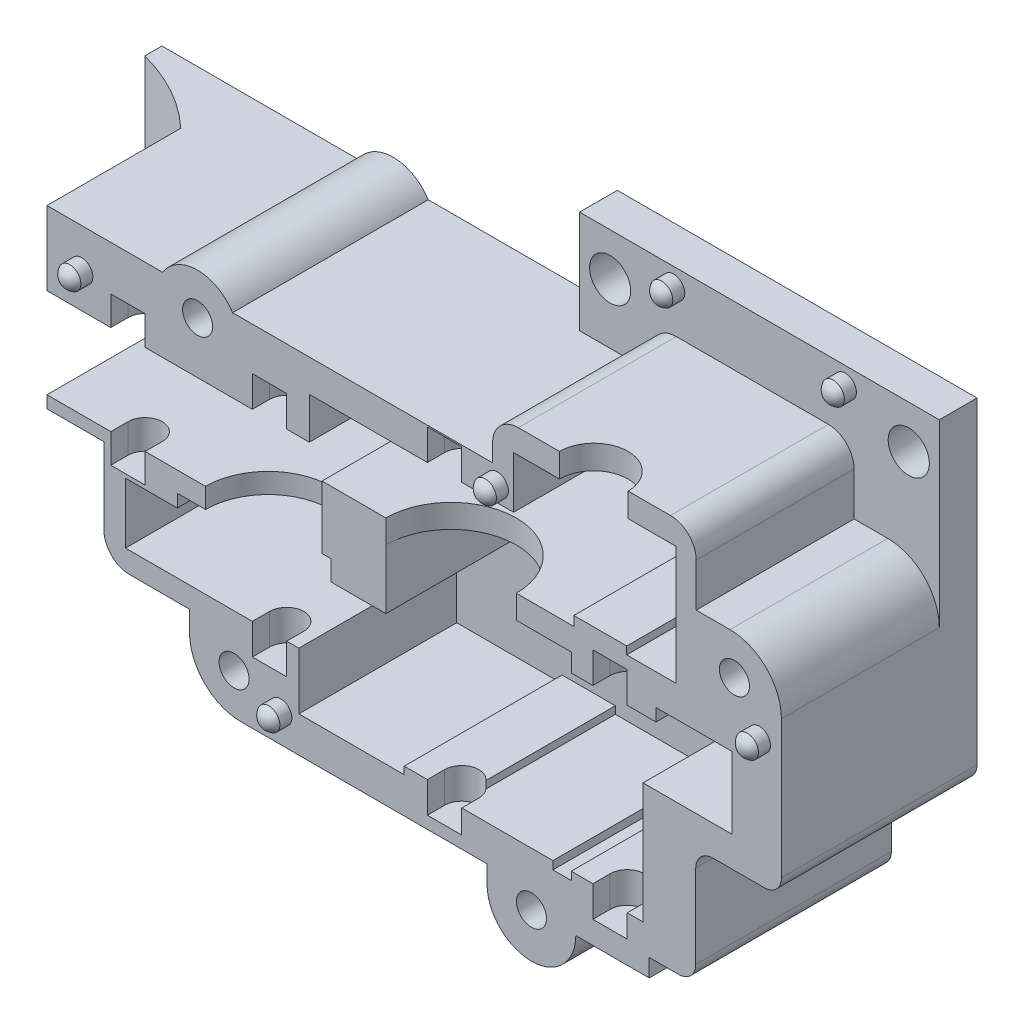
ISO-10303-21;
HEADER;
FILE_DESCRIPTION(('STEP AP214'),'2;1');
FILE_NAME('part.step','',(''),(''),'','','');
FILE_SCHEMA(('AUTOMOTIVE_DESIGN { 1 0 10303 214 1 1 1 1 }'));
ENDSEC;
DATA;
#1=APPLICATION_CONTEXT('core data for automotive mechanical design processes');
#2=APPLICATION_PROTOCOL_DEFINITION('international standard','automotive_design',2000,#1);
#3=PRODUCT_CONTEXT('',#1,'mechanical');
#4=PRODUCT('Part','Part','',(#3));
#5=PRODUCT_RELATED_PRODUCT_CATEGORY('part','',(#4));
#6=PRODUCT_DEFINITION_FORMATION('','',#4);
#7=PRODUCT_DEFINITION_CONTEXT('part definition',#1,'design');
#8=PRODUCT_DEFINITION('design','',#6,#7);
#9=PRODUCT_DEFINITION_SHAPE('','',#8);
#10=(LENGTH_UNIT() NAMED_UNIT(*) SI_UNIT(.MILLI.,.METRE.));
#11=(NAMED_UNIT(*) PLANE_ANGLE_UNIT() SI_UNIT($,.RADIAN.));
#12=(NAMED_UNIT(*) SI_UNIT($,.STERADIAN.) SOLID_ANGLE_UNIT());
#13=UNCERTAINTY_MEASURE_WITH_UNIT(LENGTH_MEASURE(1.E-05),#10,'distance_accuracy_value','');
#14=(GEOMETRIC_REPRESENTATION_CONTEXT(3) GLOBAL_UNCERTAINTY_ASSIGNED_CONTEXT((#13)) GLOBAL_UNIT_ASSIGNED_CONTEXT((#10,
#11,#12)) REPRESENTATION_CONTEXT('',''));
#15=CARTESIAN_POINT('',(0.,0.,0.));
#16=DIRECTION('',(0.,0.,1.));
#17=DIRECTION('',(1.,0.,0.));
#18=AXIS2_PLACEMENT_3D('',#15,#16,#17);
#19=CARTESIAN_POINT('',(26.7236613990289,24.7786274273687,0.));
#20=DIRECTION('',(0.,0.,-1.));
#21=DIRECTION('',(-1.,0.,0.));
#22=AXIS2_PLACEMENT_3D('',#19,#20,#21);
#23=PLANE('',#22);
#24=CARTESIAN_POINT('',(12.8776097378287,5.02321744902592,0.));
#25=DIRECTION('',(0.,0.,-1.));
#26=DIRECTION('',(-1.,0.,0.));
#27=AXIS2_PLACEMENT_3D('',#24,#25,#26);
#28=CIRCLE('',#27,0.649999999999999);
#29=CARTESIAN_POINT('',(12.2276097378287,5.02321744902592,0.));
#30=VERTEX_POINT('',#29);
#31=EDGE_CURVE('E1640',#30,#30,#28,.F.);
#32=ORIENTED_EDGE('',*,*,#31,.F.);
#33=EDGE_LOOP('',(#32));
#34=FACE_BOUND('',#33,.T.);
#35=CARTESIAN_POINT('',(27.4859241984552,2.31945155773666,0.));
#36=DIRECTION('',(0.,0.,1.));
#37=DIRECTION('',(1.,0.,0.));
#38=AXIS2_PLACEMENT_3D('',#35,#36,#37);
#39=CIRCLE('',#38,0.875000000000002);
#40=CARTESIAN_POINT('',(28.3609241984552,2.31945155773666,0.));
#41=VERTEX_POINT('',#40);
#42=EDGE_CURVE('E1198',#41,#41,#39,.T.);
#43=ORIENTED_EDGE('',*,*,#42,.F.);
#44=EDGE_LOOP('',(#43));
#45=FACE_BOUND('',#44,.T.);
#46=CARTESIAN_POINT('',(39.314954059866,19.9576834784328,0.));
#47=DIRECTION('',(0.,0.,1.));
#48=DIRECTION('',(1.,0.,0.));
#49=AXIS2_PLACEMENT_3D('',#46,#47,#48);
#50=CIRCLE('',#49,0.874999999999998);
#51=CARTESIAN_POINT('',(40.189954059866,19.9576834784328,0.));
#52=VERTEX_POINT('',#51);
#53=EDGE_CURVE('E1192',#52,#52,#50,.T.);
#54=ORIENTED_EDGE('',*,*,#53,.F.);
#55=EDGE_LOOP('',(#54));
#56=FACE_BOUND('',#55,.T.);
#57=CARTESIAN_POINT('',(10.1593515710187,5.73920864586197,0.));
#58=DIRECTION('',(0.,0.,1.));
#59=DIRECTION('',(1.,0.,0.));
#60=AXIS2_PLACEMENT_3D('',#57,#58,#59);
#61=CIRCLE('',#60,0.875);
#62=CARTESIAN_POINT('',(11.0343515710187,5.73920864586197,0.));
#63=VERTEX_POINT('',#62);
#64=EDGE_CURVE('E1180',#63,#63,#61,.T.);
#65=ORIENTED_EDGE('',*,*,#64,.F.);
#66=EDGE_LOOP('',(#65));
#67=FACE_BOUND('',#66,.T.);
#68=CARTESIAN_POINT('',(40.766008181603,17.5840635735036,0.));
#69=DIRECTION('',(0.,0.,-1.));
#70=DIRECTION('',(-1.,0.,0.));
#71=AXIS2_PLACEMENT_3D('',#68,#69,#70);
#72=CIRCLE('',#71,0.650000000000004);
#73=CARTESIAN_POINT('',(40.116008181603,17.5840635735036,0.));
#74=VERTEX_POINT('',#73);
#75=EDGE_CURVE('E1643',#74,#74,#72,.F.);
#76=ORIENTED_EDGE('',*,*,#75,.F.);
#77=EDGE_LOOP('',(#76));
#78=FACE_BOUND('',#77,.T.);
#79=DIRECTION('',(-1.,0.,0.));
#80=VECTOR('',#79,1.);
#81=CARTESIAN_POINT('',(26.7236613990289,26.2786274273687,0.));
#82=LINE('',#81,#80);
#83=CARTESIAN_POINT('',(35.5887143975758,26.2786274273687,0.));
#84=VERTEX_POINT('',#83);
#85=CARTESIAN_POINT('',(33.1185406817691,26.2786274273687,0.));
#86=VERTEX_POINT('',#85);
#87=EDGE_CURVE('E1466',#84,#86,#82,.T.);
#88=ORIENTED_EDGE('',*,*,#87,.T.);
#89=DIRECTION('',(0.,-1.,0.));
#90=VECTOR('',#89,1.);
#91=CARTESIAN_POINT('',(33.1185406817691,29.7417328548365,0.));
#92=LINE('',#91,#90);
#93=CARTESIAN_POINT('',(33.1185406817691,24.8850632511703,0.));
#94=VERTEX_POINT('',#93);
#95=EDGE_CURVE('E1699',#86,#94,#92,.T.);
#96=ORIENTED_EDGE('',*,*,#95,.T.);
#97=DIRECTION('',(1.,0.,0.));
#98=VECTOR('',#97,1.);
#99=CARTESIAN_POINT('',(26.4495749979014,24.8850632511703,0.));
#100=LINE('',#99,#98);
#101=CARTESIAN_POINT('',(35.9055788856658,24.8850632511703,0.));
#102=VERTEX_POINT('',#101);
#103=EDGE_CURVE('E1366',#94,#102,#100,.T.);
#104=ORIENTED_EDGE('',*,*,#103,.T.);
#105=DIRECTION('',(0.,-1.,0.));
#106=VECTOR('',#105,1.);
#107=CARTESIAN_POINT('',(35.9055788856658,24.8850632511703,0.));
#108=LINE('',#107,#106);
#109=CARTESIAN_POINT('',(35.9055788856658,17.9710168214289,0.));
#110=VERTEX_POINT('',#109);
#111=EDGE_CURVE('E1370',#102,#110,#108,.T.);
#112=ORIENTED_EDGE('',*,*,#111,.T.);
#113=DIRECTION('',(-1.,0.,0.));
#114=VECTOR('',#113,1.);
#115=CARTESIAN_POINT('',(35.9055788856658,17.9710168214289,0.));
#116=LINE('',#115,#114);
#117=CARTESIAN_POINT('',(33.0395962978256,17.9710168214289,0.));
#118=VERTEX_POINT('',#117);
#119=EDGE_CURVE('E1373',#110,#118,#116,.T.);
#120=ORIENTED_EDGE('',*,*,#119,.T.);
#121=DIRECTION('',(0.,1.,0.));
#122=VECTOR('',#121,1.);
#123=CARTESIAN_POINT('',(33.0395962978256,17.9710168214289,0.));
#124=LINE('',#123,#122);
#125=CARTESIAN_POINT('',(33.0395962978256,18.4203364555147,0.));
#126=VERTEX_POINT('',#125);
#127=EDGE_CURVE('E1376',#118,#126,#124,.T.);
#128=ORIENTED_EDGE('',*,*,#127,.T.);
#129=DIRECTION('',(-1.,0.,0.));
#130=VECTOR('',#129,1.);
#131=CARTESIAN_POINT('',(33.0395962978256,18.4203364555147,0.));
#132=LINE('',#131,#130);
#133=CARTESIAN_POINT('',(29.9585473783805,18.4203364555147,0.));
#134=VERTEX_POINT('',#133);
#135=EDGE_CURVE('E1379',#126,#134,#132,.T.);
#136=ORIENTED_EDGE('',*,*,#135,.T.);
#137=DIRECTION('',(0.,-1.,0.));
#138=VECTOR('',#137,1.);
#139=CARTESIAN_POINT('',(29.9585473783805,18.4203364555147,0.));
#140=LINE('',#139,#138);
#141=CARTESIAN_POINT('',(29.9585473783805,17.8640359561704,0.));
#142=VERTEX_POINT('',#141);
#143=EDGE_CURVE('E1382',#134,#142,#140,.T.);
#144=ORIENTED_EDGE('',*,*,#143,.T.);
#145=DIRECTION('',(-1.,0.,0.));
#146=VECTOR('',#145,1.);
#147=CARTESIAN_POINT('',(29.9585473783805,17.8640359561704,0.));
#148=LINE('',#147,#146);
#149=CARTESIAN_POINT('',(26.6015526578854,17.8640359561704,0.));
#150=VERTEX_POINT('',#149);
#151=EDGE_CURVE('E1386',#142,#150,#148,.T.);
#152=ORIENTED_EDGE('',*,*,#151,.T.);
#153=DIRECTION('',(0.,-1.,0.));
#154=VECTOR('',#153,1.);
#155=CARTESIAN_POINT('',(26.6015526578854,28.6120590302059,0.));
#156=LINE('',#155,#154);
#157=CARTESIAN_POINT('',(26.6015526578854,16.5007050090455,0.));
#158=VERTEX_POINT('',#157);
#159=EDGE_CURVE('E1002',#150,#158,#156,.T.);
#160=ORIENTED_EDGE('',*,*,#159,.T.);
#161=DIRECTION('',(-1.,0.,0.));
#162=VECTOR('',#161,1.);
#163=CARTESIAN_POINT('',(19.0015526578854,16.5007050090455,0.));
#164=LINE('',#163,#162);
#165=CARTESIAN_POINT('',(29.8066200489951,16.5007050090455,0.));
#166=VERTEX_POINT('',#165);
#167=EDGE_CURVE('E1207',#166,#158,#164,.T.);
#168=ORIENTED_EDGE('',*,*,#167,.F.);
#169=DIRECTION('',(0.,1.,0.));
#170=VECTOR('',#169,1.);
#171=CARTESIAN_POINT('',(29.8066200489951,16.5007050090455,0.));
#172=LINE('',#171,#170);
#173=CARTESIAN_POINT('',(29.8066200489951,15.4388835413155,0.));
#174=VERTEX_POINT('',#173);
#175=EDGE_CURVE('E1204',#174,#166,#172,.T.);
#176=ORIENTED_EDGE('',*,*,#175,.F.);
#177=DIRECTION('',(-1.,0.,0.));
#178=VECTOR('',#177,1.);
#179=CARTESIAN_POINT('',(29.8066200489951,15.4388835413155,0.));
#180=LINE('',#179,#178);
#181=CARTESIAN_POINT('',(31.0671230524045,15.4388835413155,0.));
#182=VERTEX_POINT('',#181);
#183=EDGE_CURVE('E1273',#182,#174,#180,.T.);
#184=ORIENTED_EDGE('',*,*,#183,.F.);
#185=DIRECTION('',(0.,-1.,0.));
#186=VECTOR('',#185,1.);
#187=CARTESIAN_POINT('',(31.0671230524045,17.2388835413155,0.));
#188=LINE('',#187,#186);
#189=CARTESIAN_POINT('',(31.0671230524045,17.2388835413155,0.));
#190=VERTEX_POINT('',#189);
#191=EDGE_CURVE('E990',#190,#182,#188,.T.);
#192=ORIENTED_EDGE('',*,*,#191,.F.);
#193=DIRECTION('',(-1.,0.,0.));
#194=VECTOR('',#193,1.);
#195=CARTESIAN_POINT('',(33.0671230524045,17.2388835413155,0.));
#196=LINE('',#195,#194);
#197=CARTESIAN_POINT('',(33.0671230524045,17.2388835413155,0.));
#198=VERTEX_POINT('',#197);
#199=EDGE_CURVE('E981',#198,#190,#196,.T.);
#200=ORIENTED_EDGE('',*,*,#199,.F.);
#201=DIRECTION('',(0.,-1.,0.));
#202=VECTOR('',#201,1.);
#203=CARTESIAN_POINT('',(33.0671230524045,17.2388835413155,0.));
#204=LINE('',#203,#202);
#205=CARTESIAN_POINT('',(33.0671230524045,15.4388835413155,0.));
#206=VERTEX_POINT('',#205);
#207=EDGE_CURVE('E992',#198,#206,#204,.T.);
#208=ORIENTED_EDGE('',*,*,#207,.T.);
#209=CARTESIAN_POINT('',(34.7491360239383,15.4388835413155,0.));
#210=VERTEX_POINT('',#209);
#211=EDGE_CURVE('E1274',#210,#206,#180,.T.);
#212=ORIENTED_EDGE('',*,*,#211,.F.);
#213=DIRECTION('',(0.,-1.,0.));
#214=VECTOR('',#213,1.);
#215=CARTESIAN_POINT('',(34.7491360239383,15.4388835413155,0.));
#216=LINE('',#215,#214);
#217=CARTESIAN_POINT('',(34.7491360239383,16.1663534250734,0.));
#218=VERTEX_POINT('',#217);
#219=EDGE_CURVE('E1270',#218,#210,#216,.T.);
#220=ORIENTED_EDGE('',*,*,#219,.F.);
#221=DIRECTION('',(-1.,0.,0.));
#222=VECTOR('',#221,1.);
#223=CARTESIAN_POINT('',(34.7491360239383,16.1663534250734,0.));
#224=LINE('',#223,#222);
#225=CARTESIAN_POINT('',(39.1662424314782,16.1663534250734,0.));
#226=VERTEX_POINT('',#225);
#227=EDGE_CURVE('E1267',#226,#218,#224,.T.);
#228=ORIENTED_EDGE('',*,*,#227,.F.);
#229=DIRECTION('',(0.,1.,0.));
#230=VECTOR('',#229,1.);
#231=CARTESIAN_POINT('',(39.1662424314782,16.1663534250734,0.));
#232=LINE('',#231,#230);
#233=CARTESIAN_POINT('',(39.1662424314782,11.9861124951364,0.));
#234=VERTEX_POINT('',#233);
#235=EDGE_CURVE('E1264',#234,#226,#232,.T.);
#236=ORIENTED_EDGE('',*,*,#235,.F.);
#237=DIRECTION('',(1.,0.,0.));
#238=VECTOR('',#237,1.);
#239=CARTESIAN_POINT('',(39.1662424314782,11.9861124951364,0.));
#240=LINE('',#239,#238);
#241=CARTESIAN_POINT('',(33.9883685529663,11.9861124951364,0.));
#242=VERTEX_POINT('',#241);
#243=EDGE_CURVE('E1261',#242,#234,#240,.T.);
#244=ORIENTED_EDGE('',*,*,#243,.F.);
#245=DIRECTION('',(0.,1.,0.));
#246=VECTOR('',#245,1.);
#247=CARTESIAN_POINT('',(33.9883685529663,11.9861124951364,0.));
#248=LINE('',#247,#246);
#249=CARTESIAN_POINT('',(33.9883685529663,4.96816773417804,0.));
#250=VERTEX_POINT('',#249);
#251=EDGE_CURVE('E1258',#250,#242,#248,.T.);
#252=ORIENTED_EDGE('',*,*,#251,.F.);
#253=DIRECTION('',(1.,0.,0.));
#254=VECTOR('',#253,1.);
#255=CARTESIAN_POINT('',(33.9883685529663,4.96816773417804,0.));
#256=LINE('',#255,#254);
#257=CARTESIAN_POINT('',(33.0671230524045,4.96816773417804,0.));
#258=VERTEX_POINT('',#257);
#259=EDGE_CURVE('E1256',#258,#250,#256,.T.);
#260=ORIENTED_EDGE('',*,*,#259,.F.);
#261=DIRECTION('',(0.,1.,0.));
#262=VECTOR('',#261,1.);
#263=CARTESIAN_POINT('',(33.0671230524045,3.6388835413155,0.));
#264=LINE('',#263,#262);
#265=CARTESIAN_POINT('',(33.0671230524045,3.6388835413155,0.));
#266=VERTEX_POINT('',#265);
#267=EDGE_CURVE('E958',#266,#258,#264,.T.);
#268=ORIENTED_EDGE('',*,*,#267,.F.);
#269=DIRECTION('',(-1.,0.,0.));
#270=VECTOR('',#269,1.);
#271=CARTESIAN_POINT('',(33.0671230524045,3.6388835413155,0.));
#272=LINE('',#271,#270);
#273=CARTESIAN_POINT('',(31.0671230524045,3.63888354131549,0.));
#274=VERTEX_POINT('',#273);
#275=EDGE_CURVE('E948',#266,#274,#272,.T.);
#276=ORIENTED_EDGE('',*,*,#275,.T.);
#277=DIRECTION('',(0.,1.,0.));
#278=VECTOR('',#277,1.);
#279=CARTESIAN_POINT('',(31.0671230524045,3.63888354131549,0.));
#280=LINE('',#279,#278);
#281=CARTESIAN_POINT('',(31.0671230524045,5.43888354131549,0.));
#282=VERTEX_POINT('',#281);
#283=EDGE_CURVE('E960',#274,#282,#280,.T.);
#284=ORIENTED_EDGE('',*,*,#283,.T.);
#285=DIRECTION('',(1.,0.,0.));
#286=VECTOR('',#285,1.);
#287=CARTESIAN_POINT('',(32.9399560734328,5.43888354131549,0.));
#288=LINE('',#287,#286);
#289=CARTESIAN_POINT('',(29.8066200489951,5.43888354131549,0.));
#290=VERTEX_POINT('',#289);
#291=EDGE_CURVE('E1253',#290,#282,#288,.T.);
#292=ORIENTED_EDGE('',*,*,#291,.F.);
#293=DIRECTION('',(0.,1.,0.));
#294=VECTOR('',#293,1.);
#295=CARTESIAN_POINT('',(29.8066200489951,4.96816773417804,0.));
#296=LINE('',#295,#294);
#297=CARTESIAN_POINT('',(29.8066200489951,4.96816773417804,0.));
#298=VERTEX_POINT('',#297);
#299=EDGE_CURVE('E1250',#298,#290,#296,.T.);
#300=ORIENTED_EDGE('',*,*,#299,.F.);
#301=DIRECTION('',(1.,0.,0.));
#302=VECTOR('',#301,1.);
#303=CARTESIAN_POINT('',(28.73681139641,4.96816773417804,0.));
#304=LINE('',#303,#302);
#305=CARTESIAN_POINT('',(28.73681139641,4.96816773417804,0.));
#306=VERTEX_POINT('',#305);
#307=EDGE_CURVE('E1247',#306,#298,#304,.T.);
#308=ORIENTED_EDGE('',*,*,#307,.F.);
#309=DIRECTION('',(0.,-1.,0.));
#310=VECTOR('',#309,1.);
#311=CARTESIAN_POINT('',(28.73681139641,4.96816773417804,0.));
#312=LINE('',#311,#310);
#313=CARTESIAN_POINT('',(28.73681139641,5.43888354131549,0.));
#314=VERTEX_POINT('',#313);
#315=EDGE_CURVE('E1244',#314,#306,#312,.T.);
#316=ORIENTED_EDGE('',*,*,#315,.F.);
#317=DIRECTION('',(1.,0.,0.));
#318=VECTOR('',#317,1.);
#319=CARTESIAN_POINT('',(23.1752148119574,5.43888354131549,0.));
#320=LINE('',#319,#318);
#321=CARTESIAN_POINT('',(23.4242687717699,5.43888354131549,0.));
#322=VERTEX_POINT('',#321);
#323=EDGE_CURVE('E1242',#322,#314,#320,.T.);
#324=ORIENTED_EDGE('',*,*,#323,.F.);
#325=DIRECTION('',(0.,1.,0.));
#326=VECTOR('',#325,1.);
#327=CARTESIAN_POINT('',(23.4242687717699,4.07125138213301,0.));
#328=LINE('',#327,#326);
#329=CARTESIAN_POINT('',(23.4242687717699,4.07125138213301,0.));
#330=VERTEX_POINT('',#329);
#331=EDGE_CURVE('E926',#330,#322,#328,.T.);
#332=ORIENTED_EDGE('',*,*,#331,.F.);
#333=DIRECTION('',(1.,0.,0.));
#334=VECTOR('',#333,1.);
#335=CARTESIAN_POINT('',(21.4242687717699,4.07125138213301,0.));
#336=LINE('',#335,#334);
#337=CARTESIAN_POINT('',(21.4242687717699,4.07125138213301,0.));
#338=VERTEX_POINT('',#337);
#339=EDGE_CURVE('E916',#338,#330,#336,.T.);
#340=ORIENTED_EDGE('',*,*,#339,.F.);
#341=DIRECTION('',(0.,1.,0.));
#342=VECTOR('',#341,1.);
#343=CARTESIAN_POINT('',(21.4242687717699,4.07125138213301,0.));
#344=LINE('',#343,#342);
#345=CARTESIAN_POINT('',(21.4242687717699,5.87125138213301,0.));
#346=VERTEX_POINT('',#345);
#347=EDGE_CURVE('E928',#338,#346,#344,.T.);
#348=ORIENTED_EDGE('',*,*,#347,.T.);
#349=DIRECTION('',(1.,0.,0.));
#350=VECTOR('',#349,1.);
#351=CARTESIAN_POINT('',(23.1752148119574,5.87125138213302,0.));
#352=LINE('',#351,#350);
#353=CARTESIAN_POINT('',(20.0713613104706,5.87125138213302,0.));
#354=VERTEX_POINT('',#353);
#355=EDGE_CURVE('E1239',#354,#346,#352,.T.);
#356=ORIENTED_EDGE('',*,*,#355,.F.);
#357=DIRECTION('',(0.,1.,0.));
#358=VECTOR('',#357,1.);
#359=CARTESIAN_POINT('',(20.0713613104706,5.87125138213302,0.));
#360=LINE('',#359,#358);
#361=CARTESIAN_POINT('',(20.0713613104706,5.43888354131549,0.));
#362=VERTEX_POINT('',#361);
#363=EDGE_CURVE('E1236',#362,#354,#360,.T.);
#364=ORIENTED_EDGE('',*,*,#363,.F.);
#365=DIRECTION('',(1.,0.,0.));
#366=VECTOR('',#365,1.);
#367=CARTESIAN_POINT('',(13.930659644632,5.43888354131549,0.));
#368=LINE('',#367,#366);
#369=CARTESIAN_POINT('',(13.930659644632,5.43888354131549,0.));
#370=VERTEX_POINT('',#369);
#371=EDGE_CURVE('E1233',#370,#362,#368,.T.);
#372=ORIENTED_EDGE('',*,*,#371,.F.);
#373=DIRECTION('',(0.,-1.,0.));
#374=VECTOR('',#373,1.);
#375=CARTESIAN_POINT('',(13.930659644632,8.75529036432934,0.));
#376=LINE('',#375,#374);
#377=CARTESIAN_POINT('',(13.930659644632,8.75529036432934,0.));
#378=VERTEX_POINT('',#377);
#379=EDGE_CURVE('E1230',#378,#370,#376,.T.);
#380=ORIENTED_EDGE('',*,*,#379,.F.);
#381=DIRECTION('',(1.,0.,0.));
#382=VECTOR('',#381,1.);
#383=CARTESIAN_POINT('',(3.83166596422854,8.75529036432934,0.));
#384=LINE('',#383,#382);
#385=CARTESIAN_POINT('',(13.2231658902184,8.75529036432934,0.));
#386=VERTEX_POINT('',#385);
#387=EDGE_CURVE('E1226',#386,#378,#384,.T.);
#388=ORIENTED_EDGE('',*,*,#387,.F.);
#389=DIRECTION('',(0.,1.,0.));
#390=VECTOR('',#389,1.);
#391=CARTESIAN_POINT('',(13.2231658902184,6.95529036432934,0.));
#392=LINE('',#391,#390);
#393=CARTESIAN_POINT('',(13.2231658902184,6.95529036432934,0.));
#394=VERTEX_POINT('',#393);
#395=EDGE_CURVE('E843',#394,#386,#392,.T.);
#396=ORIENTED_EDGE('',*,*,#395,.F.);
#397=DIRECTION('',(-1.,0.,0.));
#398=VECTOR('',#397,1.);
#399=CARTESIAN_POINT('',(13.2231658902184,6.95529036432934,0.));
#400=LINE('',#399,#398);
#401=CARTESIAN_POINT('',(11.2231658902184,6.95529036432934,0.));
#402=VERTEX_POINT('',#401);
#403=EDGE_CURVE('E833',#394,#402,#400,.T.);
#404=ORIENTED_EDGE('',*,*,#403,.T.);
#405=DIRECTION('',(0.,1.,0.));
#406=VECTOR('',#405,1.);
#407=CARTESIAN_POINT('',(11.2231658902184,6.95529036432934,0.));
#408=LINE('',#407,#406);
#409=CARTESIAN_POINT('',(11.2231658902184,8.75529036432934,0.));
#410=VERTEX_POINT('',#409);
#411=EDGE_CURVE('E845',#402,#410,#408,.T.);
#412=ORIENTED_EDGE('',*,*,#411,.T.);
#413=CARTESIAN_POINT('',(3.83166596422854,8.75529036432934,0.));
#414=VERTEX_POINT('',#413);
#415=EDGE_CURVE('E1227',#414,#410,#384,.T.);
#416=ORIENTED_EDGE('',*,*,#415,.F.);
#417=DIRECTION('',(0.,-1.,0.));
#418=VECTOR('',#417,1.);
#419=CARTESIAN_POINT('',(3.83166596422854,12.2856589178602,0.));
#420=LINE('',#419,#418);
#421=CARTESIAN_POINT('',(3.83166596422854,12.2856589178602,0.));
#422=VERTEX_POINT('',#421);
#423=EDGE_CURVE('E1223',#422,#414,#420,.T.);
#424=ORIENTED_EDGE('',*,*,#423,.F.);
#425=DIRECTION('',(-1.,0.,0.));
#426=VECTOR('',#425,1.);
#427=CARTESIAN_POINT('',(6.84852636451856,12.2856589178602,0.));
#428=LINE('',#427,#426);
#429=CARTESIAN_POINT('',(6.84852636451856,12.2856589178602,0.));
#430=VERTEX_POINT('',#429);
#431=EDGE_CURVE('E1220',#430,#422,#428,.T.);
#432=ORIENTED_EDGE('',*,*,#431,.F.);
#433=DIRECTION('',(0.,-1.,0.));
#434=VECTOR('',#433,1.);
#435=CARTESIAN_POINT('',(6.84852636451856,13.0345249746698,0.));
#436=LINE('',#435,#434);
#437=CARTESIAN_POINT('',(6.84852636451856,13.0345249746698,0.));
#438=VERTEX_POINT('',#437);
#439=EDGE_CURVE('E1217',#438,#430,#436,.T.);
#440=ORIENTED_EDGE('',*,*,#439,.F.);
#441=DIRECTION('',(-1.,0.,0.));
#442=VECTOR('',#441,1.);
#443=CARTESIAN_POINT('',(6.84852636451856,13.0345249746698,0.));
#444=LINE('',#443,#442);
#445=CARTESIAN_POINT('',(8.49384759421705,13.0345249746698,0.));
#446=VERTEX_POINT('',#445);
#447=EDGE_CURVE('E1213',#446,#438,#444,.T.);
#448=ORIENTED_EDGE('',*,*,#447,.F.);
#449=DIRECTION('',(0.,-1.,0.));
#450=VECTOR('',#449,1.);
#451=CARTESIAN_POINT('',(8.49384759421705,24.5290493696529,0.));
#452=LINE('',#451,#450);
#453=CARTESIAN_POINT('',(8.49384759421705,14.2052903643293,0.));
#454=VERTEX_POINT('',#453);
#455=EDGE_CURVE('E810',#446,#454,#452,.F.);
#456=ORIENTED_EDGE('',*,*,#455,.T.);
#457=DIRECTION('',(-1.,0.,0.));
#458=VECTOR('',#457,1.);
#459=CARTESIAN_POINT('',(-0.746711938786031,14.2052903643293,0.));
#460=LINE('',#459,#458);
#461=CARTESIAN_POINT('',(4.97316589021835,14.2052903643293,0.));
#462=VERTEX_POINT('',#461);
#463=EDGE_CURVE('E1393',#454,#462,#460,.T.);
#464=ORIENTED_EDGE('',*,*,#463,.T.);
#465=DIRECTION('',(0.,1.,0.));
#466=VECTOR('',#465,1.);
#467=CARTESIAN_POINT('',(4.97316589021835,12.5083728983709,0.));
#468=LINE('',#467,#466);
#469=CARTESIAN_POINT('',(4.97316589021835,12.5083728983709,0.));
#470=VERTEX_POINT('',#469);
#471=EDGE_CURVE('E773',#470,#462,#468,.T.);
#472=ORIENTED_EDGE('',*,*,#471,.F.);
#473=DIRECTION('',(-1.,0.,0.));
#474=VECTOR('',#473,1.);
#475=CARTESIAN_POINT('',(4.97316589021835,12.5083728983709,0.));
#476=LINE('',#475,#474);
#477=CARTESIAN_POINT('',(2.97316589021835,12.5083728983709,0.));
#478=VERTEX_POINT('',#477);
#479=EDGE_CURVE('E763',#470,#478,#476,.T.);
#480=ORIENTED_EDGE('',*,*,#479,.T.);
#481=DIRECTION('',(0.,1.,0.));
#482=VECTOR('',#481,1.);
#483=CARTESIAN_POINT('',(2.97316589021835,12.5083728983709,0.));
#484=LINE('',#483,#482);
#485=CARTESIAN_POINT('',(2.97316589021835,14.2052903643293,0.));
#486=VERTEX_POINT('',#485);
#487=EDGE_CURVE('E775',#478,#486,#484,.T.);
#488=ORIENTED_EDGE('',*,*,#487,.T.);
#489=CARTESIAN_POINT('',(-0.746711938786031,14.2052903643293,0.));
#490=VERTEX_POINT('',#489);
#491=EDGE_CURVE('E1392',#486,#490,#460,.T.);
#492=ORIENTED_EDGE('',*,*,#491,.T.);
#493=DIRECTION('',(0.,-1.,0.));
#494=VECTOR('',#493,1.);
#495=CARTESIAN_POINT('',(-0.746711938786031,13.4959198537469,0.));
#496=LINE('',#495,#494);
#497=CARTESIAN_POINT('',(-0.746711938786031,13.4959198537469,0.));
#498=VERTEX_POINT('',#497);
#499=EDGE_CURVE('E1396',#490,#498,#496,.T.);
#500=ORIENTED_EDGE('',*,*,#499,.T.);
#501=DIRECTION('',(1.,0.,0.));
#502=VECTOR('',#501,1.);
#503=CARTESIAN_POINT('',(2.5722362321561,13.4959198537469,0.));
#504=LINE('',#503,#502);
#505=CARTESIAN_POINT('',(2.5722362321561,13.4959198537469,0.));
#506=VERTEX_POINT('',#505);
#507=EDGE_CURVE('E1399',#498,#506,#504,.T.);
#508=ORIENTED_EDGE('',*,*,#507,.T.);
#509=DIRECTION('',(0.,-1.,0.));
#510=VECTOR('',#509,1.);
#511=CARTESIAN_POINT('',(2.5722362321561,9.03654934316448,0.));
#512=LINE('',#511,#510);
#513=CARTESIAN_POINT('',(2.5722362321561,9.03654934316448,0.));
#514=VERTEX_POINT('',#513);
#515=EDGE_CURVE('E1402',#506,#514,#512,.T.);
#516=ORIENTED_EDGE('',*,*,#515,.T.);
#517=CARTESIAN_POINT('',(4.0722362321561,9.03654934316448,0.));
#518=DIRECTION('',(0.,0.,1.));
#519=DIRECTION('',(1.,0.,0.));
#520=AXIS2_PLACEMENT_3D('',#517,#518,#519);
#521=CIRCLE('',#520,1.5);
#522=CARTESIAN_POINT('',(4.0722362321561,7.53654934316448,0.));
#523=VERTEX_POINT('',#522);
#524=EDGE_CURVE('E1405',#514,#523,#521,.T.);
#525=ORIENTED_EDGE('',*,*,#524,.T.);
#526=DIRECTION('',(1.,0.,0.));
#527=VECTOR('',#526,1.);
#528=CARTESIAN_POINT('',(7.56030195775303,7.53654934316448,0.));
#529=LINE('',#528,#527);
#530=CARTESIAN_POINT('',(7.56030195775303,7.53654934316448,0.));
#531=VERTEX_POINT('',#530);
#532=EDGE_CURVE('E1408',#523,#531,#529,.T.);
#533=ORIENTED_EDGE('',*,*,#532,.T.);
#534=DIRECTION('',(0.,-1.,0.));
#535=VECTOR('',#534,1.);
#536=CARTESIAN_POINT('',(7.56030195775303,6.35529036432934,0.));
#537=LINE('',#536,#535);
#538=CARTESIAN_POINT('',(7.56030195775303,6.35529036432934,0.));
#539=VERTEX_POINT('',#538);
#540=EDGE_CURVE('E1411',#531,#539,#537,.T.);
#541=ORIENTED_EDGE('',*,*,#540,.T.);
#542=CARTESIAN_POINT('',(10.560301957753,6.35529036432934,0.));
#543=DIRECTION('',(0.,0.,1.));
#544=DIRECTION('',(-1.,0.,0.));
#545=AXIS2_PLACEMENT_3D('',#542,#543,#544);
#546=CIRCLE('',#545,3.);
#547=CARTESIAN_POINT('',(10.560301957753,3.35529036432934,0.));
#548=VERTEX_POINT('',#547);
#549=EDGE_CURVE('E1414',#539,#548,#546,.T.);
#550=ORIENTED_EDGE('',*,*,#549,.T.);
#551=DIRECTION('',(1.,0.,0.));
#552=VECTOR('',#551,1.);
#553=CARTESIAN_POINT('',(10.560301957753,3.35529036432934,0.));
#554=LINE('',#553,#552);
#555=CARTESIAN_POINT('',(24.9015332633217,3.35529036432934,0.));
#556=VERTEX_POINT('',#555);
#557=EDGE_CURVE('E1417',#548,#556,#554,.T.);
#558=ORIENTED_EDGE('',*,*,#557,.T.);
#559=DIRECTION('',(0.,-1.,0.));
#560=VECTOR('',#559,1.);
#561=CARTESIAN_POINT('',(24.9015332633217,2.33521793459,0.));
#562=LINE('',#561,#560);
#563=CARTESIAN_POINT('',(24.9015332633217,2.33521793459,0.));
#564=VERTEX_POINT('',#563);
#565=EDGE_CURVE('E1420',#556,#564,#562,.T.);
#566=ORIENTED_EDGE('',*,*,#565,.T.);
#567=CARTESIAN_POINT('',(27.4859241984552,2.31945155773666,0.));
#568=DIRECTION('',(0.,0.,1.));
#569=DIRECTION('',(1.,0.,0.));
#570=AXIS2_PLACEMENT_3D('',#567,#568,#569);
#571=CIRCLE('',#570,2.58443902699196);
#572=CARTESIAN_POINT('',(30.0703632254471,2.31945155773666,0.));
#573=VERTEX_POINT('',#572);
#574=EDGE_CURVE('E1423',#564,#573,#571,.T.);
#575=ORIENTED_EDGE('',*,*,#574,.T.);
#576=DIRECTION('',(1.,0.,0.));
#577=VECTOR('',#576,1.);
#578=CARTESIAN_POINT('',(34.350625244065,2.31945155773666,0.));
#579=LINE('',#578,#577);
#580=CARTESIAN_POINT('',(34.350625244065,2.31945155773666,0.));
#581=VERTEX_POINT('',#580);
#582=EDGE_CURVE('E1426',#573,#581,#579,.T.);
#583=ORIENTED_EDGE('',*,*,#582,.T.);
#584=DIRECTION('',(0.,1.,0.));
#585=VECTOR('',#584,1.);
#586=CARTESIAN_POINT('',(34.350625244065,2.31945155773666,0.));
#587=LINE('',#586,#585);
#588=CARTESIAN_POINT('',(34.350625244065,3.35529036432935,0.));
#589=VERTEX_POINT('',#588);
#590=EDGE_CURVE('E1429',#581,#589,#587,.T.);
#591=ORIENTED_EDGE('',*,*,#590,.T.);
#592=DIRECTION('',(1.,0.,0.));
#593=VECTOR('',#592,1.);
#594=CARTESIAN_POINT('',(36.060301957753,3.35529036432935,0.));
#595=LINE('',#594,#593);
#596=CARTESIAN_POINT('',(36.060301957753,3.35529036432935,0.));
#597=VERTEX_POINT('',#596);
#598=EDGE_CURVE('E1432',#589,#597,#595,.T.);
#599=ORIENTED_EDGE('',*,*,#598,.T.);
#600=CARTESIAN_POINT('',(36.060301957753,4.35529036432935,0.));
#601=DIRECTION('',(0.,0.,1.));
#602=DIRECTION('',(-1.,0.,0.));
#603=AXIS2_PLACEMENT_3D('',#600,#601,#602);
#604=CIRCLE('',#603,1.);
#605=CARTESIAN_POINT('',(37.060301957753,4.35529036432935,0.));
#606=VERTEX_POINT('',#605);
#607=EDGE_CURVE('E1435',#597,#606,#604,.T.);
#608=ORIENTED_EDGE('',*,*,#607,.T.);
#609=DIRECTION('',(0.,1.,0.));
#610=VECTOR('',#609,1.);
#611=CARTESIAN_POINT('',(37.060301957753,9.2273572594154,0.));
#612=LINE('',#611,#610);
#613=CARTESIAN_POINT('',(37.060301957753,9.2273572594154,0.));
#614=VERTEX_POINT('',#613);
#615=EDGE_CURVE('E1438',#606,#614,#612,.T.);
#616=ORIENTED_EDGE('',*,*,#615,.T.);
#617=CARTESIAN_POINT('',(38.060301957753,9.2273572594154,0.));
#618=DIRECTION('',(0.,0.,-1.));
#619=DIRECTION('',(-1.,0.,0.));
#620=AXIS2_PLACEMENT_3D('',#617,#618,#619);
#621=CIRCLE('',#620,1.);
#622=CARTESIAN_POINT('',(38.060301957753,10.2273572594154,0.));
#623=VERTEX_POINT('',#622);
#624=EDGE_CURVE('E1441',#614,#623,#621,.T.);
#625=ORIENTED_EDGE('',*,*,#624,.T.);
#626=DIRECTION('',(1.,0.,0.));
#627=VECTOR('',#626,1.);
#628=CARTESIAN_POINT('',(41.053288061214,10.2273572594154,0.));
#629=LINE('',#628,#627);
#630=CARTESIAN_POINT('',(41.053288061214,10.2273572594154,0.));
#631=VERTEX_POINT('',#630);
#632=EDGE_CURVE('E1444',#623,#631,#629,.T.);
#633=ORIENTED_EDGE('',*,*,#632,.T.);
#634=CARTESIAN_POINT('',(41.053288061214,11.2273572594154,0.));
#635=DIRECTION('',(0.,0.,1.));
#636=DIRECTION('',(1.,0.,0.));
#637=AXIS2_PLACEMENT_3D('',#634,#635,#636);
#638=CIRCLE('',#637,0.99999999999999);
#639=CARTESIAN_POINT('',(42.053288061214,11.2273572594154,0.));
#640=VERTEX_POINT('',#639);
#641=EDGE_CURVE('E1447',#631,#640,#638,.T.);
#642=ORIENTED_EDGE('',*,*,#641,.T.);
#643=DIRECTION('',(0.,1.,0.));
#644=VECTOR('',#643,1.);
#645=CARTESIAN_POINT('',(42.053288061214,19.2534743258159,0.));
#646=LINE('',#645,#644);
#647=CARTESIAN_POINT('',(42.053288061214,19.2534743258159,0.));
#648=VERTEX_POINT('',#647);
#649=EDGE_CURVE('E1450',#640,#648,#646,.T.);
#650=ORIENTED_EDGE('',*,*,#649,.T.);
#651=CARTESIAN_POINT('',(39.053288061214,19.2534743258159,0.));
#652=DIRECTION('',(0.,0.,1.));
#653=DIRECTION('',(1.,0.,0.));
#654=AXIS2_PLACEMENT_3D('',#651,#652,#653);
#655=CIRCLE('',#654,3.);
#656=CARTESIAN_POINT('',(39.053288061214,22.2534743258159,0.));
#657=VERTEX_POINT('',#656);
#658=EDGE_CURVE('E1453',#648,#657,#655,.T.);
#659=ORIENTED_EDGE('',*,*,#658,.T.);
#660=DIRECTION('',(-1.,0.,0.));
#661=VECTOR('',#660,1.);
#662=CARTESIAN_POINT('',(37.0887143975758,22.2534743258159,0.));
#663=LINE('',#662,#661);
#664=CARTESIAN_POINT('',(37.0887143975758,22.2534743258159,0.));
#665=VERTEX_POINT('',#664);
#666=EDGE_CURVE('E1456',#657,#665,#663,.T.);
#667=ORIENTED_EDGE('',*,*,#666,.T.);
#668=DIRECTION('',(0.,1.,0.));
#669=VECTOR('',#668,1.);
#670=CARTESIAN_POINT('',(37.0887143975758,24.7786274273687,0.));
#671=LINE('',#670,#669);
#672=CARTESIAN_POINT('',(37.0887143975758,24.7786274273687,0.));
#673=VERTEX_POINT('',#672);
#674=EDGE_CURVE('E1459',#665,#673,#671,.T.);
#675=ORIENTED_EDGE('',*,*,#674,.T.);
#676=CARTESIAN_POINT('',(35.5887143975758,24.7786274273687,0.));
#677=DIRECTION('',(0.,0.,1.));
#678=DIRECTION('',(1.,0.,0.));
#679=AXIS2_PLACEMENT_3D('',#676,#677,#678);
#680=CIRCLE('',#679,1.5);
#681=EDGE_CURVE('E1462',#673,#84,#680,.T.);
#682=ORIENTED_EDGE('',*,*,#681,.T.);
#683=EDGE_LOOP('',(#88,#96,#104,#112,#120,#128,#136,#144,#152,#160,#168,#176,#184,#192,#200,
#208,#212,#220,#228,#236,#244,#252,#260,#268,#276,#284,#292,#300,#308,#316,#324,#332,#340,#348,
#356,#364,#372,#380,#388,#396,#404,#412,#416,#424,#432,#440,#448,#456,#464,#472,#480,#488,#492,
#500,#508,#516,#525,#533,#541,#550,#558,#566,#575,#583,#591,#599,#608,#616,#625,#633,#642,#650,
#659,#667,#675,#682));
#684=FACE_BOUND('',#683,.T.);
#685=ADVANCED_FACE('F26',(#34,#45,#56,#67,#78,#684),#23,.F.);
#686=CARTESIAN_POINT('',(-0.746711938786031,13.4959198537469,-11.4));
#687=DIRECTION('',(-1.,0.,0.));
#688=DIRECTION('',(0.,-1.,0.));
#689=AXIS2_PLACEMENT_3D('',#686,#687,#688);
#690=PLANE('',#689);
#691=DIRECTION('',(0.,0.,1.));
#692=VECTOR('',#691,1.);
#693=CARTESIAN_POINT('',(-0.746711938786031,14.2052903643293,-11.4));
#694=LINE('',#693,#692);
#695=CARTESIAN_POINT('',(-0.746711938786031,14.2052903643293,-7.8));
#696=VERTEX_POINT('',#695);
#697=EDGE_CURVE('E1596',#696,#490,#694,.T.);
#698=ORIENTED_EDGE('',*,*,#697,.F.);
#699=CARTESIAN_POINT('',(-0.746711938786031,14.2052903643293,-11.4));
#700=VERTEX_POINT('',#699);
#701=EDGE_CURVE('E1594',#700,#696,#694,.T.);
#702=ORIENTED_EDGE('',*,*,#701,.F.);
#703=DIRECTION('',(0.,-1.,0.));
#704=VECTOR('',#703,1.);
#705=CARTESIAN_POINT('',(-0.746711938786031,13.4959198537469,-11.4));
#706=LINE('',#705,#704);
#707=CARTESIAN_POINT('',(-0.746711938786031,13.4959198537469,-11.4));
#708=VERTEX_POINT('',#707);
#709=EDGE_CURVE('E1483',#700,#708,#706,.T.);
#710=ORIENTED_EDGE('',*,*,#709,.T.);
#711=DIRECTION('',(0.,0.,1.));
#712=VECTOR('',#711,1.);
#713=CARTESIAN_POINT('',(-0.746711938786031,13.4959198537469,-11.4));
#714=LINE('',#713,#712);
#715=EDGE_CURVE('E1592',#708,#498,#714,.T.);
#716=ORIENTED_EDGE('',*,*,#715,.T.);
#717=ORIENTED_EDGE('',*,*,#499,.F.);
#718=EDGE_LOOP('',(#698,#702,#710,#716,#717));
#719=FACE_BOUND('',#718,.T.);
#720=ADVANCED_FACE('F1811',(#719),#690,.T.);
#721=CARTESIAN_POINT('',(-0.746711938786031,14.2052903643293,-11.4));
#722=DIRECTION('',(0.,1.,0.));
#723=DIRECTION('',(0.,0.,1.));
#724=AXIS2_PLACEMENT_3D('',#721,#722,#723);
#725=PLANE('',#724);
#726=DIRECTION('',(-1.,0.,0.));
#727=VECTOR('',#726,1.);
#728=CARTESIAN_POINT('',(-0.746711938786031,14.2052903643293,-9.2));
#729=LINE('',#728,#727);
#730=CARTESIAN_POINT('',(15.2807726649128,14.2052903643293,-9.2));
#731=VERTEX_POINT('',#730);
#732=CARTESIAN_POINT('',(1.89522754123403,14.2052903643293,-9.2));
#733=VERTEX_POINT('',#732);
#734=EDGE_CURVE('E1161',#731,#733,#729,.T.);
#735=ORIENTED_EDGE('',*,*,#734,.T.);
#736=DIRECTION('',(0.883604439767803,0.,-0.468234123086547));
#737=VECTOR('',#736,1.);
#738=CARTESIAN_POINT('',(-0.746711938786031,14.2052903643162,-7.8));
#739=LINE('',#738,#737);
#740=EDGE_CURVE('E746',#696,#733,#739,.T.);
#741=ORIENTED_EDGE('',*,*,#740,.F.);
#742=ORIENTED_EDGE('',*,*,#697,.T.);
#743=ORIENTED_EDGE('',*,*,#491,.F.);
#744=DIRECTION('',(0.,0.,-1.));
#745=VECTOR('',#744,1.);
#746=CARTESIAN_POINT('',(2.97316589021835,14.2052903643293,-11.4));
#747=LINE('',#746,#745);
#748=CARTESIAN_POINT('',(2.97316589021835,14.2052903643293,-1.));
#749=VERTEX_POINT('',#748);
#750=EDGE_CURVE('E1673',#486,#749,#747,.T.);
#751=ORIENTED_EDGE('',*,*,#750,.T.);
#752=CARTESIAN_POINT('',(3.97316589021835,14.2052903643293,-1.));
#753=DIRECTION('',(0.,1.,0.));
#754=DIRECTION('',(0.,0.,1.));
#755=AXIS2_PLACEMENT_3D('',#752,#753,#754);
#756=CIRCLE('',#755,1.);
#757=CARTESIAN_POINT('',(4.97316589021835,14.2052903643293,-1.));
#758=VERTEX_POINT('',#757);
#759=EDGE_CURVE('E1676',#749,#758,#756,.F.);
#760=ORIENTED_EDGE('',*,*,#759,.T.);
#761=DIRECTION('',(0.,0.,1.));
#762=VECTOR('',#761,1.);
#763=CARTESIAN_POINT('',(4.97316589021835,14.2052903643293,-11.4));
#764=LINE('',#763,#762);
#765=EDGE_CURVE('E1679',#758,#462,#764,.T.);
#766=ORIENTED_EDGE('',*,*,#765,.T.);
#767=ORIENTED_EDGE('',*,*,#463,.F.);
#768=CARTESIAN_POINT('',(12.143847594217,14.2052903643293,0.));
#769=DIRECTION('',(0.,1.,0.));
#770=DIRECTION('',(0.,0.,1.));
#771=AXIS2_PLACEMENT_3D('',#768,#769,#770);
#772=CIRCLE('',#771,3.65);
#773=CARTESIAN_POINT('',(15.2807726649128,14.2052903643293,-1.86606567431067));
#774=VERTEX_POINT('',#773);
#775=EDGE_CURVE('E807',#454,#774,#772,.F.);
#776=ORIENTED_EDGE('',*,*,#775,.T.);
#777=DIRECTION('',(0.,0.,1.));
#778=VECTOR('',#777,1.);
#779=CARTESIAN_POINT('',(15.2807726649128,14.2052903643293,-11.4));
#780=LINE('',#779,#778);
#781=EDGE_CURVE('E1597',#731,#774,#780,.T.);
#782=ORIENTED_EDGE('',*,*,#781,.F.);
#783=EDGE_LOOP('',(#735,#741,#742,#743,#751,#760,#766,#767,#776,#782));
#784=FACE_BOUND('',#783,.T.);
#785=ADVANCED_FACE('F1719',(#784),#725,.T.);
#786=CARTESIAN_POINT('',(-0.746711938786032,19.4552903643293,-11.4));
#787=DIRECTION('',(0.,-1.,0.));
#788=DIRECTION('',(0.,0.,-1.));
#789=AXIS2_PLACEMENT_3D('',#786,#787,#788);
#790=PLANE('',#789);
#791=DIRECTION('',(0.,0.,1.));
#792=VECTOR('',#791,1.);
#793=CARTESIAN_POINT('',(-0.746711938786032,19.4552903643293,-11.4));
#794=LINE('',#793,#792);
#795=CARTESIAN_POINT('',(-0.746711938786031,19.4552903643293,-7.8));
#796=VERTEX_POINT('',#795);
#797=CARTESIAN_POINT('',(-0.746711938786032,19.4552903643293,0.));
#798=VERTEX_POINT('',#797);
#799=EDGE_CURVE('E1627',#796,#798,#794,.T.);
#800=ORIENTED_EDGE('',*,*,#799,.F.);
#801=DIRECTION('',(-0.883604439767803,0.,0.468234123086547));
#802=VECTOR('',#801,1.);
#803=CARTESIAN_POINT('',(-0.746711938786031,19.4552903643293,-7.8));
#804=LINE('',#803,#802);
#805=CARTESIAN_POINT('',(1.89522754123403,19.4552903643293,-9.2));
#806=VERTEX_POINT('',#805);
#807=EDGE_CURVE('E743',#806,#796,#804,.T.);
#808=ORIENTED_EDGE('',*,*,#807,.F.);
#809=DIRECTION('',(1.,0.,0.));
#810=VECTOR('',#809,1.);
#811=CARTESIAN_POINT('',(-0.746711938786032,19.4552903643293,-9.2));
#812=LINE('',#811,#810);
#813=CARTESIAN_POINT('',(14.5446652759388,19.4552903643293,-9.2));
#814=VERTEX_POINT('',#813);
#815=EDGE_CURVE('E1137',#806,#814,#812,.T.);
#816=ORIENTED_EDGE('',*,*,#815,.T.);
#817=DIRECTION('',(0.,0.,1.));
#818=VECTOR('',#817,1.);
#819=CARTESIAN_POINT('',(14.5446652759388,19.4552903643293,-11.4));
#820=LINE('',#819,#818);
#821=CARTESIAN_POINT('',(14.5446652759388,19.4552903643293,0.));
#822=VERTEX_POINT('',#821);
#823=EDGE_CURVE('E1624',#814,#822,#820,.T.);
#824=ORIENTED_EDGE('',*,*,#823,.T.);
#825=DIRECTION('',(1.,0.,0.));
#826=VECTOR('',#825,1.);
#827=CARTESIAN_POINT('',(-0.746711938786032,19.4552903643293,0.));
#828=LINE('',#827,#826);
#829=CARTESIAN_POINT('',(13.2231658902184,19.4552903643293,0.));
#830=VERTEX_POINT('',#829);
#831=EDGE_CURVE('E1351',#830,#822,#828,.T.);
#832=ORIENTED_EDGE('',*,*,#831,.F.);
#833=DIRECTION('',(0.,0.,1.));
#834=VECTOR('',#833,1.);
#835=CARTESIAN_POINT('',(13.2231658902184,19.4552903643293,-1.));
#836=LINE('',#835,#834);
#837=CARTESIAN_POINT('',(13.2231658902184,19.4552903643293,-1.));
#838=VERTEX_POINT('',#837);
#839=EDGE_CURVE('E851',#838,#830,#836,.T.);
#840=ORIENTED_EDGE('',*,*,#839,.F.);
#841=CARTESIAN_POINT('',(12.2231658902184,19.4552903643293,-1.));
#842=DIRECTION('',(0.,-1.,0.));
#843=DIRECTION('',(0.,0.,-1.));
#844=AXIS2_PLACEMENT_3D('',#841,#842,#843);
#845=CIRCLE('',#844,0.999999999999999);
#846=CARTESIAN_POINT('',(11.2231658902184,19.4552903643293,-1.));
#847=VERTEX_POINT('',#846);
#848=EDGE_CURVE('E842',#847,#838,#845,.T.);
#849=ORIENTED_EDGE('',*,*,#848,.F.);
#850=DIRECTION('',(0.,0.,-1.));
#851=VECTOR('',#850,1.);
#852=CARTESIAN_POINT('',(11.2231658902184,19.4552903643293,0.));
#853=LINE('',#852,#851);
#854=CARTESIAN_POINT('',(11.2231658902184,19.4552903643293,0.));
#855=VERTEX_POINT('',#854);
#856=EDGE_CURVE('E853',#855,#847,#853,.T.);
#857=ORIENTED_EDGE('',*,*,#856,.F.);
#858=CARTESIAN_POINT('',(4.97316589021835,19.4552903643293,0.));
#859=VERTEX_POINT('',#858);
#860=EDGE_CURVE('E1356',#859,#855,#828,.T.);
#861=ORIENTED_EDGE('',*,*,#860,.F.);
#862=DIRECTION('',(0.,0.,1.));
#863=VECTOR('',#862,1.);
#864=CARTESIAN_POINT('',(4.97316589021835,19.4552903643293,-1.));
#865=LINE('',#864,#863);
#866=CARTESIAN_POINT('',(4.97316589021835,19.4552903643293,-1.));
#867=VERTEX_POINT('',#866);
#868=EDGE_CURVE('E780',#867,#859,#865,.T.);
#869=ORIENTED_EDGE('',*,*,#868,.F.);
#870=CARTESIAN_POINT('',(3.97316589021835,19.4552903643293,-1.));
#871=DIRECTION('',(0.,-1.,0.));
#872=DIRECTION('',(0.,0.,-1.));
#873=AXIS2_PLACEMENT_3D('',#870,#871,#872);
#874=CIRCLE('',#873,1.);
#875=CARTESIAN_POINT('',(2.97316589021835,19.4552903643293,-1.));
#876=VERTEX_POINT('',#875);
#877=EDGE_CURVE('E772',#876,#867,#874,.T.);
#878=ORIENTED_EDGE('',*,*,#877,.F.);
#879=DIRECTION('',(0.,0.,-1.));
#880=VECTOR('',#879,1.);
#881=CARTESIAN_POINT('',(2.97316589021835,19.4552903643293,0.));
#882=LINE('',#881,#880);
#883=CARTESIAN_POINT('',(2.97316589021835,19.4552903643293,0.));
#884=VERTEX_POINT('',#883);
#885=EDGE_CURVE('E782',#884,#876,#882,.T.);
#886=ORIENTED_EDGE('',*,*,#885,.F.);
#887=EDGE_CURVE('E1352',#798,#884,#828,.T.);
#888=ORIENTED_EDGE('',*,*,#887,.F.);
#889=EDGE_LOOP('',(#800,#808,#816,#824,#832,#840,#849,#857,#861,#869,#878,#886,#888));
#890=FACE_BOUND('',#889,.T.);
#891=ADVANCED_FACE('F1781',(#890),#790,.T.);
#892=CARTESIAN_POINT('',(8.03042838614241,22.4667778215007,-9.2));
#893=DIRECTION('',(0.,0.,-1.));
#894=DIRECTION('',(-1.,0.,0.));
#895=AXIS2_PLACEMENT_3D('',#892,#893,#894);
#896=PLANE('',#895);
#897=DIRECTION('',(0.,-1.,0.));
#898=VECTOR('',#897,1.);
#899=CARTESIAN_POINT('',(1.89522754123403,-500000.,-9.2));
#900=LINE('',#899,#898);
#901=EDGE_CURVE('E753',#806,#733,#900,.T.);
#902=ORIENTED_EDGE('',*,*,#901,.T.);
#903=ORIENTED_EDGE('',*,*,#734,.F.);
#904=DIRECTION('',(0.,-1.,0.));
#905=VECTOR('',#904,1.);
#906=CARTESIAN_POINT('',(15.2807726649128,17.8640359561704,-9.2));
#907=LINE('',#906,#905);
#908=CARTESIAN_POINT('',(15.2807726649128,17.8640359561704,-9.2));
#909=VERTEX_POINT('',#908);
#910=EDGE_CURVE('E1159',#909,#731,#907,.T.);
#911=ORIENTED_EDGE('',*,*,#910,.F.);
#912=DIRECTION('',(-1.,0.,0.));
#913=VECTOR('',#912,1.);
#914=CARTESIAN_POINT('',(29.9585473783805,17.8640359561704,-9.2));
#915=LINE('',#914,#913);
#916=CARTESIAN_POINT('',(29.9585473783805,17.8640359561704,-9.2));
#917=VERTEX_POINT('',#916);
#918=EDGE_CURVE('E1157',#917,#909,#915,.T.);
#919=ORIENTED_EDGE('',*,*,#918,.F.);
#920=DIRECTION('',(0.,-1.,0.));
#921=VECTOR('',#920,1.);
#922=CARTESIAN_POINT('',(29.9585473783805,18.4203364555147,-9.2));
#923=LINE('',#922,#921);
#924=CARTESIAN_POINT('',(29.9585473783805,18.4203364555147,-9.2));
#925=VERTEX_POINT('',#924);
#926=EDGE_CURVE('E1155',#925,#917,#923,.T.);
#927=ORIENTED_EDGE('',*,*,#926,.F.);
#928=DIRECTION('',(-1.,0.,0.));
#929=VECTOR('',#928,1.);
#930=CARTESIAN_POINT('',(33.0395962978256,18.4203364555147,-9.2));
#931=LINE('',#930,#929);
#932=CARTESIAN_POINT('',(33.0395962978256,18.4203364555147,-9.2));
#933=VERTEX_POINT('',#932);
#934=EDGE_CURVE('E1153',#933,#925,#931,.T.);
#935=ORIENTED_EDGE('',*,*,#934,.F.);
#936=DIRECTION('',(0.,1.,0.));
#937=VECTOR('',#936,1.);
#938=CARTESIAN_POINT('',(33.0395962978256,17.9710168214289,-9.2));
#939=LINE('',#938,#937);
#940=CARTESIAN_POINT('',(33.0395962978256,17.9710168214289,-9.2));
#941=VERTEX_POINT('',#940);
#942=EDGE_CURVE('E1151',#941,#933,#939,.T.);
#943=ORIENTED_EDGE('',*,*,#942,.F.);
#944=DIRECTION('',(-1.,0.,0.));
#945=VECTOR('',#944,1.);
#946=CARTESIAN_POINT('',(35.9055788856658,17.9710168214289,-9.2));
#947=LINE('',#946,#945);
#948=CARTESIAN_POINT('',(35.9055788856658,17.9710168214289,-9.2));
#949=VERTEX_POINT('',#948);
#950=EDGE_CURVE('E1149',#949,#941,#947,.T.);
#951=ORIENTED_EDGE('',*,*,#950,.F.);
#952=DIRECTION('',(0.,-1.,0.));
#953=VECTOR('',#952,1.);
#954=CARTESIAN_POINT('',(35.9055788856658,24.8850632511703,-9.2));
#955=LINE('',#954,#953);
#956=CARTESIAN_POINT('',(35.9055788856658,24.8850632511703,-9.2));
#957=VERTEX_POINT('',#956);
#958=EDGE_CURVE('E1147',#957,#949,#955,.T.);
#959=ORIENTED_EDGE('',*,*,#958,.F.);
#960=DIRECTION('',(1.,0.,0.));
#961=VECTOR('',#960,1.);
#962=CARTESIAN_POINT('',(26.4495749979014,24.8850632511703,-9.2));
#963=LINE('',#962,#961);
#964=CARTESIAN_POINT('',(26.4495749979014,24.8850632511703,-9.2));
#965=VERTEX_POINT('',#964);
#966=EDGE_CURVE('E1145',#965,#957,#963,.T.);
#967=ORIENTED_EDGE('',*,*,#966,.F.);
#968=DIRECTION('',(0.,1.,0.));
#969=VECTOR('',#968,1.);
#970=CARTESIAN_POINT('',(26.4495749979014,21.871251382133,-9.2));
#971=LINE('',#970,#969);
#972=CARTESIAN_POINT('',(26.4495749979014,21.871251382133,-9.2));
#973=VERTEX_POINT('',#972);
#974=EDGE_CURVE('E1143',#973,#965,#971,.T.);
#975=ORIENTED_EDGE('',*,*,#974,.F.);
#976=DIRECTION('',(1.,0.,0.));
#977=VECTOR('',#976,1.);
#978=CARTESIAN_POINT('',(14.5446652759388,21.871251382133,-9.2));
#979=LINE('',#978,#977);
#980=CARTESIAN_POINT('',(14.5446652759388,21.871251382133,-9.2));
#981=VERTEX_POINT('',#980);
#982=EDGE_CURVE('E1141',#981,#973,#979,.T.);
#983=ORIENTED_EDGE('',*,*,#982,.F.);
#984=DIRECTION('',(0.,1.,0.));
#985=VECTOR('',#984,1.);
#986=CARTESIAN_POINT('',(14.5446652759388,19.4552903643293,-9.2));
#987=LINE('',#986,#985);
#988=EDGE_CURVE('E1139',#814,#981,#987,.T.);
#989=ORIENTED_EDGE('',*,*,#988,.F.);
#990=ORIENTED_EDGE('',*,*,#815,.F.);
#991=EDGE_LOOP('',(#902,#903,#911,#919,#927,#935,#943,#951,#959,#967,#975,#983,#989,#990));
#992=FACE_BOUND('',#991,.T.);
#993=ADVANCED_FACE('F1713',(#992),#896,.F.);
#994=CARTESIAN_POINT('',(1.27969112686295,21.4850209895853,0.));
#995=DIRECTION('',(0.,0.,-1.));
#996=DIRECTION('',(-1.,0.,0.));
#997=AXIS2_PLACEMENT_3D('',#994,#995,#996);
#998=CIRCLE('',#997,0.65);
#999=CARTESIAN_POINT('',(0.629691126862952,21.4850209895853,0.));
#1000=VERTEX_POINT('',#999);
#1001=EDGE_CURVE('E1542',#1000,#1000,#998,.F.);
#1002=ORIENTED_EDGE('',*,*,#1001,.F.);
#1003=EDGE_LOOP('',(#1002));
#1004=FACE_BOUND('',#1003,.T.);
#1005=CARTESIAN_POINT('',(8.03042838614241,22.4667778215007,0.));
#1006=DIRECTION('',(0.,0.,1.));
#1007=DIRECTION('',(1.,0.,0.));
#1008=AXIS2_PLACEMENT_3D('',#1005,#1006,#1007);
#1009=CIRCLE('',#1008,0.875);
#1010=CARTESIAN_POINT('',(8.90542838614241,22.4667778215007,0.));
#1011=VERTEX_POINT('',#1010);
#1012=EDGE_CURVE('E1186',#1011,#1011,#1009,.T.);
#1013=ORIENTED_EDGE('',*,*,#1012,.F.);
#1014=EDGE_LOOP('',(#1013));
#1015=FACE_BOUND('',#1014,.T.);
#1016=CARTESIAN_POINT('',(25.4937899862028,22.7854712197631,0.));
#1017=DIRECTION('',(0.,0.,-1.));
#1018=DIRECTION('',(-1.,0.,0.));
#1019=AXIS2_PLACEMENT_3D('',#1016,#1017,#1018);
#1020=CIRCLE('',#1019,0.649999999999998);
#1021=CARTESIAN_POINT('',(24.8437899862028,22.7854712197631,0.));
#1022=VERTEX_POINT('',#1021);
#1023=EDGE_CURVE('E1646',#1022,#1022,#1020,.F.);
#1024=ORIENTED_EDGE('',*,*,#1023,.F.);
#1025=EDGE_LOOP('',(#1024));
#1026=FACE_BOUND('',#1025,.T.);
#1027=CARTESIAN_POINT('',(26.4495749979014,24.8850632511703,0.));
#1028=VERTEX_POINT('',#1027);
#1029=CARTESIAN_POINT('',(29.1185406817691,24.8850632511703,0.));
#1030=VERTEX_POINT('',#1029);
#1031=EDGE_CURVE('E1367',#1028,#1030,#100,.T.);
#1032=ORIENTED_EDGE('',*,*,#1031,.T.);
#1033=DIRECTION('',(0.,-1.,0.));
#1034=VECTOR('',#1033,1.);
#1035=CARTESIAN_POINT('',(29.1185406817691,29.7417328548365,0.));
#1036=LINE('',#1035,#1034);
#1037=CARTESIAN_POINT('',(29.1185406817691,26.2786274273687,0.));
#1038=VERTEX_POINT('',#1037);
#1039=EDGE_CURVE('E47',#1030,#1038,#1036,.F.);
#1040=ORIENTED_EDGE('',*,*,#1039,.T.);
#1041=CARTESIAN_POINT('',(26.7236613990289,26.2786274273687,0.));
#1042=VERTEX_POINT('',#1041);
#1043=EDGE_CURVE('E1465',#1038,#1042,#82,.T.);
#1044=ORIENTED_EDGE('',*,*,#1043,.T.);
#1045=CARTESIAN_POINT('',(26.7236613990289,24.7786274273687,0.));
#1046=DIRECTION('',(0.,0.,1.));
#1047=DIRECTION('',(-1.,0.,0.));
#1048=AXIS2_PLACEMENT_3D('',#1045,#1046,#1047);
#1049=CIRCLE('',#1048,1.5);
#1050=CARTESIAN_POINT('',(25.2236613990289,24.7786274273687,0.));
#1051=VERTEX_POINT('',#1050);
#1052=EDGE_CURVE('E1469',#1042,#1051,#1049,.T.);
#1053=ORIENTED_EDGE('',*,*,#1052,.T.);
#1054=DIRECTION('',(0.,-1.,0.));
#1055=VECTOR('',#1054,1.);
#1056=CARTESIAN_POINT('',(25.2236613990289,23.7552903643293,0.));
#1057=LINE('',#1056,#1055);
#1058=CARTESIAN_POINT('',(25.2236613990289,23.7552903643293,0.));
#1059=VERTEX_POINT('',#1058);
#1060=EDGE_CURVE('E1472',#1051,#1059,#1057,.T.);
#1061=ORIENTED_EDGE('',*,*,#1060,.T.);
#1062=DIRECTION('',(-1.,0.,0.));
#1063=VECTOR('',#1062,1.);
#1064=CARTESIAN_POINT('',(10.0719692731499,23.7552903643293,0.));
#1065=LINE('',#1064,#1063);
#1066=CARTESIAN_POINT('',(10.0719692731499,23.7552903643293,0.));
#1067=VERTEX_POINT('',#1066);
#1068=EDGE_CURVE('E1281',#1059,#1067,#1065,.T.);
#1069=ORIENTED_EDGE('',*,*,#1068,.T.);
#1070=CARTESIAN_POINT('',(8.03042838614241,22.4667778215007,0.));
#1071=DIRECTION('',(0.,0.,1.));
#1072=DIRECTION('',(1.,0.,0.));
#1073=AXIS2_PLACEMENT_3D('',#1070,#1071,#1072);
#1074=CIRCLE('',#1073,2.41415694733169);
#1075=CARTESIAN_POINT('',(5.98888749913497,23.7552903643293,0.));
#1076=VERTEX_POINT('',#1075);
#1077=EDGE_CURVE('E1342',#1067,#1076,#1074,.T.);
#1078=ORIENTED_EDGE('',*,*,#1077,.T.);
#1079=DIRECTION('',(-1.,0.,0.));
#1080=VECTOR('',#1079,1.);
#1081=CARTESIAN_POINT('',(-0.746711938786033,23.7552903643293,0.));
#1082=LINE('',#1081,#1080);
#1083=CARTESIAN_POINT('',(-0.746711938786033,23.7552903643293,0.));
#1084=VERTEX_POINT('',#1083);
#1085=EDGE_CURVE('E1345',#1076,#1084,#1082,.T.);
#1086=ORIENTED_EDGE('',*,*,#1085,.T.);
#1087=DIRECTION('',(0.,-1.,0.));
#1088=VECTOR('',#1087,1.);
#1089=CARTESIAN_POINT('',(-0.746711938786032,19.4552903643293,0.));
#1090=LINE('',#1089,#1088);
#1091=EDGE_CURVE('E1348',#1084,#798,#1090,.T.);
#1092=ORIENTED_EDGE('',*,*,#1091,.T.);
#1093=ORIENTED_EDGE('',*,*,#887,.T.);
#1094=DIRECTION('',(0.,-1.,0.));
#1095=VECTOR('',#1094,1.);
#1096=CARTESIAN_POINT('',(2.97316589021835,21.1552903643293,0.));
#1097=LINE('',#1096,#1095);
#1098=CARTESIAN_POINT('',(2.97316589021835,21.1552903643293,0.));
#1099=VERTEX_POINT('',#1098);
#1100=EDGE_CURVE('E800',#1099,#884,#1097,.T.);
#1101=ORIENTED_EDGE('',*,*,#1100,.F.);
#1102=DIRECTION('',(-1.,0.,0.));
#1103=VECTOR('',#1102,1.);
#1104=CARTESIAN_POINT('',(4.97316589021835,21.1552903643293,0.));
#1105=LINE('',#1104,#1103);
#1106=CARTESIAN_POINT('',(4.97316589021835,21.1552903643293,0.));
#1107=VERTEX_POINT('',#1106);
#1108=EDGE_CURVE('E791',#1107,#1099,#1105,.T.);
#1109=ORIENTED_EDGE('',*,*,#1108,.F.);
#1110=DIRECTION('',(0.,-1.,0.));
#1111=VECTOR('',#1110,1.);
#1112=CARTESIAN_POINT('',(4.97316589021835,21.1552903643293,0.));
#1113=LINE('',#1112,#1111);
#1114=EDGE_CURVE('E802',#1107,#859,#1113,.T.);
#1115=ORIENTED_EDGE('',*,*,#1114,.T.);
#1116=ORIENTED_EDGE('',*,*,#860,.T.);
#1117=DIRECTION('',(0.,-1.,0.));
#1118=VECTOR('',#1117,1.);
#1119=CARTESIAN_POINT('',(11.2231658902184,21.2552903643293,0.));
#1120=LINE('',#1119,#1118);
#1121=CARTESIAN_POINT('',(11.2231658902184,21.2552903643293,0.));
#1122=VERTEX_POINT('',#1121);
#1123=EDGE_CURVE('E871',#1122,#855,#1120,.T.);
#1124=ORIENTED_EDGE('',*,*,#1123,.F.);
#1125=DIRECTION('',(-1.,0.,0.));
#1126=VECTOR('',#1125,1.);
#1127=CARTESIAN_POINT('',(13.2231658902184,21.2552903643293,0.));
#1128=LINE('',#1127,#1126);
#1129=CARTESIAN_POINT('',(13.2231658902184,21.2552903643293,0.));
#1130=VERTEX_POINT('',#1129);
#1131=EDGE_CURVE('E862',#1130,#1122,#1128,.T.);
#1132=ORIENTED_EDGE('',*,*,#1131,.F.);
#1133=DIRECTION('',(0.,-1.,0.));
#1134=VECTOR('',#1133,1.);
#1135=CARTESIAN_POINT('',(13.2231658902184,21.2552903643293,0.));
#1136=LINE('',#1135,#1134);
#1137=EDGE_CURVE('E874',#1130,#830,#1136,.T.);
#1138=ORIENTED_EDGE('',*,*,#1137,.T.);
#1139=ORIENTED_EDGE('',*,*,#831,.T.);
#1140=DIRECTION('',(0.,1.,0.));
#1141=VECTOR('',#1140,1.);
#1142=CARTESIAN_POINT('',(14.5446652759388,19.4552903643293,0.));
#1143=LINE('',#1142,#1141);
#1144=CARTESIAN_POINT('',(14.5446652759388,21.871251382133,0.));
#1145=VERTEX_POINT('',#1144);
#1146=EDGE_CURVE('E1355',#822,#1145,#1143,.T.);
#1147=ORIENTED_EDGE('',*,*,#1146,.T.);
#1148=DIRECTION('',(1.,0.,0.));
#1149=VECTOR('',#1148,1.);
#1150=CARTESIAN_POINT('',(14.5446652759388,21.871251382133,0.));
#1151=LINE('',#1150,#1149);
#1152=CARTESIAN_POINT('',(21.4242687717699,21.871251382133,0.));
#1153=VERTEX_POINT('',#1152);
#1154=EDGE_CURVE('E1360',#1145,#1153,#1151,.T.);
#1155=ORIENTED_EDGE('',*,*,#1154,.T.);
#1156=DIRECTION('',(0.,-1.,0.));
#1157=VECTOR('',#1156,1.);
#1158=CARTESIAN_POINT('',(21.4242687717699,23.671251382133,0.));
#1159=LINE('',#1158,#1157);
#1160=CARTESIAN_POINT('',(21.4242687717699,23.671251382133,0.));
#1161=VERTEX_POINT('',#1160);
#1162=EDGE_CURVE('E902',#1161,#1153,#1159,.T.);
#1163=ORIENTED_EDGE('',*,*,#1162,.F.);
#1164=DIRECTION('',(1.,0.,0.));
#1165=VECTOR('',#1164,1.);
#1166=CARTESIAN_POINT('',(21.4242687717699,23.671251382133,0.));
#1167=LINE('',#1166,#1165);
#1168=CARTESIAN_POINT('',(23.4242687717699,23.671251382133,0.));
#1169=VERTEX_POINT('',#1168);
#1170=EDGE_CURVE('E892',#1161,#1169,#1167,.T.);
#1171=ORIENTED_EDGE('',*,*,#1170,.T.);
#1172=DIRECTION('',(0.,-1.,0.));
#1173=VECTOR('',#1172,1.);
#1174=CARTESIAN_POINT('',(23.4242687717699,23.671251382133,0.));
#1175=LINE('',#1174,#1173);
#1176=CARTESIAN_POINT('',(23.4242687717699,21.871251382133,0.));
#1177=VERTEX_POINT('',#1176);
#1178=EDGE_CURVE('E904',#1169,#1177,#1175,.T.);
#1179=ORIENTED_EDGE('',*,*,#1178,.T.);
#1180=CARTESIAN_POINT('',(26.4495749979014,21.871251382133,0.));
#1181=VERTEX_POINT('',#1180);
#1182=EDGE_CURVE('E1359',#1177,#1181,#1151,.T.);
#1183=ORIENTED_EDGE('',*,*,#1182,.T.);
#1184=DIRECTION('',(0.,1.,0.));
#1185=VECTOR('',#1184,1.);
#1186=CARTESIAN_POINT('',(26.4495749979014,21.871251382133,0.));
#1187=LINE('',#1186,#1185);
#1188=EDGE_CURVE('E1363',#1181,#1028,#1187,.T.);
#1189=ORIENTED_EDGE('',*,*,#1188,.T.);
#1190=EDGE_LOOP('',(#1032,#1040,#1044,#1053,#1061,#1069,#1078,#1086,#1092,#1093,#1101,#1109,
#1115,#1116,#1124,#1132,#1138,#1139,#1147,#1155,#1163,#1171,#1179,#1183,#1189));
#1191=FACE_BOUND('',#1190,.T.);
#1192=ADVANCED_FACE('F1863',(#1004,#1015,#1026,#1191),#23,.F.);
#1193=DIRECTION('',(0.,-1.,0.));
#1194=VECTOR('',#1193,1.);
#1195=CARTESIAN_POINT('',(15.2807726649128,17.8640359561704,0.));
#1196=LINE('',#1195,#1194);
#1197=CARTESIAN_POINT('',(15.2807726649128,17.8640359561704,0.));
#1198=VERTEX_POINT('',#1197);
#1199=CARTESIAN_POINT('',(15.2807726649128,14.2052903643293,0.));
#1200=VERTEX_POINT('',#1199);
#1201=EDGE_CURVE('E1389',#1198,#1200,#1196,.T.);
#1202=ORIENTED_EDGE('',*,*,#1201,.T.);
#1203=DIRECTION('',(1.,0.,0.));
#1204=VECTOR('',#1203,1.);
#1205=CARTESIAN_POINT('',(26.7236613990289,14.2052903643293,0.));
#1206=LINE('',#1205,#1204);
#1207=CARTESIAN_POINT('',(15.7938475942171,14.2052903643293,0.));
#1208=VERTEX_POINT('',#1207);
#1209=EDGE_CURVE('E816',#1200,#1208,#1206,.T.);
#1210=ORIENTED_EDGE('',*,*,#1209,.T.);
#1211=DIRECTION('',(0.,-1.,0.));
#1212=VECTOR('',#1211,1.);
#1213=CARTESIAN_POINT('',(15.7938475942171,24.5290493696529,0.));
#1214=LINE('',#1213,#1212);
#1215=CARTESIAN_POINT('',(15.7938475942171,13.0345249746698,0.));
#1216=VERTEX_POINT('',#1215);
#1217=EDGE_CURVE('E813',#1208,#1216,#1214,.T.);
#1218=ORIENTED_EDGE('',*,*,#1217,.T.);
#1219=CARTESIAN_POINT('',(19.0015526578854,13.0345249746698,0.));
#1220=VERTEX_POINT('',#1219);
#1221=EDGE_CURVE('E1214',#1220,#1216,#444,.T.);
#1222=ORIENTED_EDGE('',*,*,#1221,.F.);
#1223=DIRECTION('',(0.,-1.,0.));
#1224=VECTOR('',#1223,1.);
#1225=CARTESIAN_POINT('',(19.0015526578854,13.0345249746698,0.));
#1226=LINE('',#1225,#1224);
#1227=CARTESIAN_POINT('',(19.0015526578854,16.5007050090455,0.));
#1228=VERTEX_POINT('',#1227);
#1229=EDGE_CURVE('E1210',#1228,#1220,#1226,.T.);
#1230=ORIENTED_EDGE('',*,*,#1229,.F.);
#1231=DIRECTION('',(0.,-1.,0.));
#1232=VECTOR('',#1231,1.);
#1233=CARTESIAN_POINT('',(19.0015526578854,28.6120590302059,0.));
#1234=LINE('',#1233,#1232);
#1235=CARTESIAN_POINT('',(19.0015526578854,17.8640359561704,0.));
#1236=VERTEX_POINT('',#1235);
#1237=EDGE_CURVE('E999',#1228,#1236,#1234,.F.);
#1238=ORIENTED_EDGE('',*,*,#1237,.T.);
#1239=EDGE_CURVE('E1385',#1236,#1198,#148,.T.);
#1240=ORIENTED_EDGE('',*,*,#1239,.T.);
#1241=EDGE_LOOP('',(#1202,#1210,#1218,#1222,#1230,#1238,#1240));
#1242=FACE_BOUND('',#1241,.T.);
#1243=ADVANCED_FACE('F1843',(#1242),#23,.F.);
#1244=CARTESIAN_POINT('',(3.83166596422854,8.75529036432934,-11.4));
#1245=DIRECTION('',(0.,-1.,0.));
#1246=DIRECTION('',(0.,0.,-1.));
#1247=AXIS2_PLACEMENT_3D('',#1244,#1245,#1246);
#1248=PLANE('',#1247);
#1249=DIRECTION('',(0.,0.,1.));
#1250=VECTOR('',#1249,1.);
#1251=CARTESIAN_POINT('',(13.2231658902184,8.75529036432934,-1.));
#1252=LINE('',#1251,#1250);
#1253=CARTESIAN_POINT('',(13.2231658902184,8.75529036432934,-1.));
#1254=VERTEX_POINT('',#1253);
#1255=EDGE_CURVE('E825',#1254,#386,#1252,.T.);
#1256=ORIENTED_EDGE('',*,*,#1255,.T.);
#1257=ORIENTED_EDGE('',*,*,#387,.T.);
#1258=DIRECTION('',(0.,0.,1.));
#1259=VECTOR('',#1258,1.);
#1260=CARTESIAN_POINT('',(13.930659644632,8.75529036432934,-11.4));
#1261=LINE('',#1260,#1259);
#1262=CARTESIAN_POINT('',(13.930659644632,8.75529036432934,-9.2));
#1263=VERTEX_POINT('',#1262);
#1264=EDGE_CURVE('E1322',#1263,#378,#1261,.T.);
#1265=ORIENTED_EDGE('',*,*,#1264,.F.);
#1266=DIRECTION('',(1.,0.,0.));
#1267=VECTOR('',#1266,1.);
#1268=CARTESIAN_POINT('',(3.83166596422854,8.75529036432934,-9.2));
#1269=LINE('',#1268,#1267);
#1270=CARTESIAN_POINT('',(3.83166596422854,8.75529036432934,-9.2));
#1271=VERTEX_POINT('',#1270);
#1272=EDGE_CURVE('E1077',#1271,#1263,#1269,.T.);
#1273=ORIENTED_EDGE('',*,*,#1272,.F.);
#1274=DIRECTION('',(0.,0.,1.));
#1275=VECTOR('',#1274,1.);
#1276=CARTESIAN_POINT('',(3.83166596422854,8.75529036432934,-11.4));
#1277=LINE('',#1276,#1275);
#1278=EDGE_CURVE('E1325',#1271,#414,#1277,.T.);
#1279=ORIENTED_EDGE('',*,*,#1278,.T.);
#1280=ORIENTED_EDGE('',*,*,#415,.T.);
#1281=DIRECTION('',(0.,0.,-1.));
#1282=VECTOR('',#1281,1.);
#1283=CARTESIAN_POINT('',(11.2231658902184,8.75529036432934,0.));
#1284=LINE('',#1283,#1282);
#1285=CARTESIAN_POINT('',(11.2231658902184,8.75529036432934,-1.));
#1286=VERTEX_POINT('',#1285);
#1287=EDGE_CURVE('E822',#410,#1286,#1284,.T.);
#1288=ORIENTED_EDGE('',*,*,#1287,.T.);
#1289=CARTESIAN_POINT('',(12.2231658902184,8.75529036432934,-1.));
#1290=DIRECTION('',(0.,-1.,0.));
#1291=DIRECTION('',(0.,0.,-1.));
#1292=AXIS2_PLACEMENT_3D('',#1289,#1290,#1291);
#1293=CIRCLE('',#1292,0.999999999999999);
#1294=EDGE_CURVE('E819',#1286,#1254,#1293,.T.);
#1295=ORIENTED_EDGE('',*,*,#1294,.T.);
#1296=EDGE_LOOP('',(#1256,#1257,#1265,#1273,#1279,#1280,#1288,#1295));
#1297=FACE_BOUND('',#1296,.T.);
#1298=ADVANCED_FACE('F1875',(#1297),#1248,.F.);
#1299=CARTESIAN_POINT('',(14.5446652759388,21.871251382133,-11.4));
#1300=DIRECTION('',(0.,-1.,0.));
#1301=DIRECTION('',(0.,0.,-1.));
#1302=AXIS2_PLACEMENT_3D('',#1299,#1300,#1301);
#1303=PLANE('',#1302);
#1304=CARTESIAN_POINT('',(22.4242687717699,21.871251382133,-1.));
#1305=DIRECTION('',(0.,1.,0.));
#1306=DIRECTION('',(0.,0.,1.));
#1307=AXIS2_PLACEMENT_3D('',#1304,#1305,#1306);
#1308=CIRCLE('',#1307,1.);
#1309=CARTESIAN_POINT('',(23.4242687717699,21.871251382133,-1.));
#1310=VERTEX_POINT('',#1309);
#1311=CARTESIAN_POINT('',(21.4242687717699,21.871251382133,-1.));
#1312=VERTEX_POINT('',#1311);
#1313=EDGE_CURVE('E870',#1310,#1312,#1308,.T.);
#1314=ORIENTED_EDGE('',*,*,#1313,.T.);
#1315=DIRECTION('',(0.,0.,1.));
#1316=VECTOR('',#1315,1.);
#1317=CARTESIAN_POINT('',(21.4242687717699,21.871251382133,-1.));
#1318=LINE('',#1317,#1316);
#1319=EDGE_CURVE('E884',#1312,#1153,#1318,.T.);
#1320=ORIENTED_EDGE('',*,*,#1319,.T.);
#1321=ORIENTED_EDGE('',*,*,#1154,.F.);
#1322=DIRECTION('',(0.,0.,1.));
#1323=VECTOR('',#1322,1.);
#1324=CARTESIAN_POINT('',(14.5446652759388,21.871251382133,-11.4));
#1325=LINE('',#1324,#1323);
#1326=EDGE_CURVE('E1622',#981,#1145,#1325,.T.);
#1327=ORIENTED_EDGE('',*,*,#1326,.F.);
#1328=ORIENTED_EDGE('',*,*,#982,.T.);
#1329=DIRECTION('',(0.,0.,1.));
#1330=VECTOR('',#1329,1.);
#1331=CARTESIAN_POINT('',(26.4495749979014,21.871251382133,-11.4));
#1332=LINE('',#1331,#1330);
#1333=EDGE_CURVE('E1619',#973,#1181,#1332,.T.);
#1334=ORIENTED_EDGE('',*,*,#1333,.T.);
#1335=ORIENTED_EDGE('',*,*,#1182,.F.);
#1336=DIRECTION('',(0.,0.,-1.));
#1337=VECTOR('',#1336,1.);
#1338=CARTESIAN_POINT('',(23.4242687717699,21.871251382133,-1.));
#1339=LINE('',#1338,#1337);
#1340=EDGE_CURVE('E881',#1177,#1310,#1339,.T.);
#1341=ORIENTED_EDGE('',*,*,#1340,.T.);
#1342=EDGE_LOOP('',(#1314,#1320,#1321,#1327,#1328,#1334,#1335,#1341));
#1343=FACE_BOUND('',#1342,.T.);
#1344=ADVANCED_FACE('F1772',(#1343),#1303,.T.);
#1345=CARTESIAN_POINT('',(33.9883685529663,4.96816773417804,-11.4));
#1346=DIRECTION('',(0.,-1.,0.));
#1347=DIRECTION('',(0.,0.,-1.));
#1348=AXIS2_PLACEMENT_3D('',#1345,#1346,#1347);
#1349=PLANE('',#1348);
#1350=CARTESIAN_POINT('',(32.0671230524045,4.96816773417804,-1.));
#1351=DIRECTION('',(0.,-1.,0.));
#1352=DIRECTION('',(0.,0.,-1.));
#1353=AXIS2_PLACEMENT_3D('',#1350,#1351,#1352);
#1354=CIRCLE('',#1353,0.999999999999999);
#1355=CARTESIAN_POINT('',(33.0671230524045,4.96816773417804,-1.));
#1356=VERTEX_POINT('',#1355);
#1357=CARTESIAN_POINT('',(32.9399560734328,4.96816773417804,-1.4880189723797));
#1358=VERTEX_POINT('',#1357);
#1359=EDGE_CURVE('E966',#1356,#1358,#1354,.F.);
#1360=ORIENTED_EDGE('',*,*,#1359,.F.);
#1361=DIRECTION('',(0.,0.,-1.));
#1362=VECTOR('',#1361,1.);
#1363=CARTESIAN_POINT('',(33.0671230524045,4.96816773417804,-11.4));
#1364=LINE('',#1363,#1362);
#1365=EDGE_CURVE('E1662',#258,#1356,#1364,.T.);
#1366=ORIENTED_EDGE('',*,*,#1365,.F.);
#1367=ORIENTED_EDGE('',*,*,#259,.T.);
#1368=DIRECTION('',(0.,0.,1.));
#1369=VECTOR('',#1368,1.);
#1370=CARTESIAN_POINT('',(33.9883685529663,4.96816773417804,-11.4));
#1371=LINE('',#1370,#1369);
#1372=CARTESIAN_POINT('',(33.9883685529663,4.96816773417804,-9.2));
#1373=VERTEX_POINT('',#1372);
#1374=EDGE_CURVE('E1292',#1373,#250,#1371,.T.);
#1375=ORIENTED_EDGE('',*,*,#1374,.F.);
#1376=DIRECTION('',(1.,0.,0.));
#1377=VECTOR('',#1376,1.);
#1378=CARTESIAN_POINT('',(33.9883685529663,4.96816773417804,-9.2));
#1379=LINE('',#1378,#1377);
#1380=CARTESIAN_POINT('',(32.9399560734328,4.96816773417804,-9.2));
#1381=VERTEX_POINT('',#1380);
#1382=EDGE_CURVE('E1113',#1381,#1373,#1379,.T.);
#1383=ORIENTED_EDGE('',*,*,#1382,.F.);
#1384=DIRECTION('',(0.,0.,1.));
#1385=VECTOR('',#1384,1.);
#1386=CARTESIAN_POINT('',(32.9399560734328,4.96816773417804,-11.4));
#1387=LINE('',#1386,#1385);
#1388=EDGE_CURVE('E1295',#1381,#1358,#1387,.T.);
#1389=ORIENTED_EDGE('',*,*,#1388,.T.);
#1390=EDGE_LOOP('',(#1360,#1366,#1367,#1375,#1383,#1389));
#1391=FACE_BOUND('',#1390,.T.);
#1392=ADVANCED_FACE('F2092',(#1391),#1349,.F.);
#1393=CARTESIAN_POINT('',(32.9399560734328,4.96816773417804,-11.4));
#1394=DIRECTION('',(-1.,0.,0.));
#1395=DIRECTION('',(0.,0.,1.));
#1396=AXIS2_PLACEMENT_3D('',#1393,#1394,#1395);
#1397=PLANE('',#1396);
#1398=DIRECTION('',(0.,1.,0.));
#1399=VECTOR('',#1398,1.);
#1400=CARTESIAN_POINT('',(32.9399560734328,3.63888354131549,-1.4880189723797));
#1401=LINE('',#1400,#1399);
#1402=CARTESIAN_POINT('',(32.9399560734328,5.43888354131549,-1.4880189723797));
#1403=VERTEX_POINT('',#1402);
#1404=EDGE_CURVE('E957',#1358,#1403,#1401,.T.);
#1405=ORIENTED_EDGE('',*,*,#1404,.F.);
#1406=ORIENTED_EDGE('',*,*,#1388,.F.);
#1407=DIRECTION('',(0.,-1.,0.));
#1408=VECTOR('',#1407,1.);
#1409=CARTESIAN_POINT('',(32.9399560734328,4.96816773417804,-9.2));
#1410=LINE('',#1409,#1408);
#1411=CARTESIAN_POINT('',(32.9399560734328,5.43888354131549,-9.2));
#1412=VERTEX_POINT('',#1411);
#1413=EDGE_CURVE('E1110',#1412,#1381,#1410,.T.);
#1414=ORIENTED_EDGE('',*,*,#1413,.F.);
#1415=DIRECTION('',(0.,0.,1.));
#1416=VECTOR('',#1415,1.);
#1417=CARTESIAN_POINT('',(32.9399560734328,5.43888354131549,-11.4));
#1418=LINE('',#1417,#1416);
#1419=EDGE_CURVE('E1298',#1412,#1403,#1418,.T.);
#1420=ORIENTED_EDGE('',*,*,#1419,.T.);
#1421=EDGE_LOOP('',(#1405,#1406,#1414,#1420));
#1422=FACE_BOUND('',#1421,.T.);
#1423=ADVANCED_FACE('F2095',(#1422),#1397,.F.);
#1424=CARTESIAN_POINT('',(32.9399560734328,5.43888354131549,-11.4));
#1425=DIRECTION('',(0.,-1.,0.));
#1426=DIRECTION('',(0.,0.,-1.));
#1427=AXIS2_PLACEMENT_3D('',#1424,#1425,#1426);
#1428=PLANE('',#1427);
#1429=CARTESIAN_POINT('',(32.0671230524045,5.43888354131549,-1.));
#1430=DIRECTION('',(0.,-1.,0.));
#1431=DIRECTION('',(0.,0.,-1.));
#1432=AXIS2_PLACEMENT_3D('',#1429,#1430,#1431);
#1433=CIRCLE('',#1432,0.999999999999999);
#1434=CARTESIAN_POINT('',(31.0671230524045,5.43888354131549,-1.));
#1435=VERTEX_POINT('',#1434);
#1436=EDGE_CURVE('E937',#1435,#1403,#1433,.T.);
#1437=ORIENTED_EDGE('',*,*,#1436,.T.);
#1438=ORIENTED_EDGE('',*,*,#1419,.F.);
#1439=DIRECTION('',(1.,0.,0.));
#1440=VECTOR('',#1439,1.);
#1441=CARTESIAN_POINT('',(32.9399560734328,5.43888354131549,-9.2));
#1442=LINE('',#1441,#1440);
#1443=CARTESIAN_POINT('',(29.8066200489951,5.43888354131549,-9.2));
#1444=VERTEX_POINT('',#1443);
#1445=EDGE_CURVE('E1107',#1444,#1412,#1442,.T.);
#1446=ORIENTED_EDGE('',*,*,#1445,.F.);
#1447=DIRECTION('',(0.,0.,1.));
#1448=VECTOR('',#1447,1.);
#1449=CARTESIAN_POINT('',(29.8066200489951,5.43888354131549,-11.4));
#1450=LINE('',#1449,#1448);
#1451=EDGE_CURVE('E1301',#1444,#290,#1450,.T.);
#1452=ORIENTED_EDGE('',*,*,#1451,.T.);
#1453=ORIENTED_EDGE('',*,*,#291,.T.);
#1454=DIRECTION('',(0.,0.,-1.));
#1455=VECTOR('',#1454,1.);
#1456=CARTESIAN_POINT('',(31.0671230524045,5.43888354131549,0.));
#1457=LINE('',#1456,#1455);
#1458=EDGE_CURVE('E940',#282,#1435,#1457,.T.);
#1459=ORIENTED_EDGE('',*,*,#1458,.T.);
#1460=EDGE_LOOP('',(#1437,#1438,#1446,#1452,#1453,#1459));
#1461=FACE_BOUND('',#1460,.T.);
#1462=ADVANCED_FACE('F2099',(#1461),#1428,.F.);
#1463=CARTESIAN_POINT('',(25.2236613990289,23.7552903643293,-11.4));
#1464=DIRECTION('',(-1.,0.,0.));
#1465=DIRECTION('',(0.,0.,1.));
#1466=AXIS2_PLACEMENT_3D('',#1463,#1464,#1465);
#1467=PLANE('',#1466);
#1468=DIRECTION('',(0.,0.,1.));
#1469=VECTOR('',#1468,1.);
#1470=CARTESIAN_POINT('',(25.2236613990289,24.7786274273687,-11.4));
#1471=LINE('',#1470,#1469);
#1472=CARTESIAN_POINT('',(25.2236613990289,24.7786274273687,-9.2));
#1473=VERTEX_POINT('',#1472);
#1474=EDGE_CURVE('E1543',#1473,#1051,#1471,.T.);
#1475=ORIENTED_EDGE('',*,*,#1474,.F.);
#1476=DIRECTION('',(0.,-1.,0.));
#1477=VECTOR('',#1476,1.);
#1478=CARTESIAN_POINT('',(25.2236613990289,23.7552903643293,-9.2));
#1479=LINE('',#1478,#1477);
#1480=CARTESIAN_POINT('',(25.2236613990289,23.7552903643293,-9.2));
#1481=VERTEX_POINT('',#1480);
#1482=EDGE_CURVE('E1176',#1473,#1481,#1479,.T.);
#1483=ORIENTED_EDGE('',*,*,#1482,.T.);
#1484=DIRECTION('',(0.,0.,1.));
#1485=VECTOR('',#1484,1.);
#1486=CARTESIAN_POINT('',(25.2236613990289,23.7552903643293,-11.4));
#1487=LINE('',#1486,#1485);
#1488=EDGE_CURVE('E1540',#1481,#1059,#1487,.T.);
#1489=ORIENTED_EDGE('',*,*,#1488,.T.);
#1490=ORIENTED_EDGE('',*,*,#1060,.F.);
#1491=EDGE_LOOP('',(#1475,#1483,#1489,#1490));
#1492=FACE_BOUND('',#1491,.T.);
#1493=ADVANCED_FACE('F2103',(#1492),#1467,.T.);
#1494=CARTESIAN_POINT('',(26.7236613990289,24.7786274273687,-11.4));
#1495=DIRECTION('',(0.,0.,1.));
#1496=DIRECTION('',(1.,0.,0.));
#1497=AXIS2_PLACEMENT_3D('',#1494,#1495,#1496);
#1498=CYLINDRICAL_SURFACE('',#1497,1.5);
#1499=DIRECTION('',(0.,0.,1.));
#1500=VECTOR('',#1499,1.);
#1501=CARTESIAN_POINT('',(26.7236613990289,26.2786274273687,-11.4));
#1502=LINE('',#1501,#1500);
#1503=CARTESIAN_POINT('',(26.7236613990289,26.2786274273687,-9.2));
#1504=VERTEX_POINT('',#1503);
#1505=EDGE_CURVE('E1545',#1504,#1042,#1502,.T.);
#1506=ORIENTED_EDGE('',*,*,#1505,.F.);
#1507=CARTESIAN_POINT('',(26.7236613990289,24.7786274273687,-9.2));
#1508=DIRECTION('',(0.,0.,-1.));
#1509=DIRECTION('',(-1.,0.,0.));
#1510=AXIS2_PLACEMENT_3D('',#1507,#1508,#1509);
#1511=CIRCLE('',#1510,1.5);
#1512=EDGE_CURVE('E1174',#1504,#1473,#1511,.F.);
#1513=ORIENTED_EDGE('',*,*,#1512,.T.);
#1514=ORIENTED_EDGE('',*,*,#1474,.T.);
#1515=ORIENTED_EDGE('',*,*,#1052,.F.);
#1516=EDGE_LOOP('',(#1506,#1513,#1514,#1515));
#1517=FACE_BOUND('',#1516,.T.);
#1518=ADVANCED_FACE('F2855',(#1517),#1498,.T.);
#1519=CARTESIAN_POINT('',(26.7236613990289,26.2786274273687,-11.4));
#1520=DIRECTION('',(0.,1.,0.));
#1521=DIRECTION('',(0.,0.,1.));
#1522=AXIS2_PLACEMENT_3D('',#1519,#1520,#1521);
#1523=PLANE('',#1522);
#1524=CARTESIAN_POINT('',(31.1185406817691,26.2786274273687,0.));
#1525=DIRECTION('',(0.,1.,0.));
#1526=DIRECTION('',(0.,0.,1.));
#1527=AXIS2_PLACEMENT_3D('',#1524,#1525,#1526);
#1528=CIRCLE('',#1527,2.00000000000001);
#1529=EDGE_CURVE('E1694',#86,#1038,#1528,.T.);
#1530=ORIENTED_EDGE('',*,*,#1529,.F.);
#1531=ORIENTED_EDGE('',*,*,#87,.F.);
#1532=DIRECTION('',(0.,0.,1.));
#1533=VECTOR('',#1532,1.);
#1534=CARTESIAN_POINT('',(35.5887143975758,26.2786274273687,-11.4));
#1535=LINE('',#1534,#1533);
#1536=CARTESIAN_POINT('',(35.5887143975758,26.2786274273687,-9.2));
#1537=VERTEX_POINT('',#1536);
#1538=EDGE_CURVE('E1548',#1537,#84,#1535,.T.);
#1539=ORIENTED_EDGE('',*,*,#1538,.F.);
#1540=DIRECTION('',(-1.,0.,0.));
#1541=VECTOR('',#1540,1.);
#1542=CARTESIAN_POINT('',(26.7236613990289,26.2786274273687,-9.2));
#1543=LINE('',#1542,#1541);
#1544=EDGE_CURVE('E1172',#1537,#1504,#1543,.T.);
#1545=ORIENTED_EDGE('',*,*,#1544,.T.);
#1546=ORIENTED_EDGE('',*,*,#1505,.T.);
#1547=ORIENTED_EDGE('',*,*,#1043,.F.);
#1548=EDGE_LOOP('',(#1530,#1531,#1539,#1545,#1546,#1547));
#1549=FACE_BOUND('',#1548,.T.);
#1550=ADVANCED_FACE('F2847',(#1549),#1523,.T.);
#1551=CARTESIAN_POINT('',(35.5887143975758,24.7786274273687,-11.4));
#1552=DIRECTION('',(0.,0.,1.));
#1553=DIRECTION('',(1.,0.,0.));
#1554=AXIS2_PLACEMENT_3D('',#1551,#1552,#1553);
#1555=CYLINDRICAL_SURFACE('',#1554,1.5);
#1556=DIRECTION('',(0.,0.,1.));
#1557=VECTOR('',#1556,1.);
#1558=CARTESIAN_POINT('',(37.0887143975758,24.7786274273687,-11.4));
#1559=LINE('',#1558,#1557);
#1560=CARTESIAN_POINT('',(37.0887143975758,24.7786274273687,-9.2));
#1561=VERTEX_POINT('',#1560);
#1562=EDGE_CURVE('E1550',#1561,#673,#1559,.T.);
#1563=ORIENTED_EDGE('',*,*,#1562,.F.);
#1564=CARTESIAN_POINT('',(35.5887143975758,24.7786274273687,-9.2));
#1565=DIRECTION('',(0.,0.,-1.));
#1566=DIRECTION('',(-1.,0.,0.));
#1567=AXIS2_PLACEMENT_3D('',#1564,#1565,#1566);
#1568=CIRCLE('',#1567,1.5);
#1569=EDGE_CURVE('E1170',#1561,#1537,#1568,.F.);
#1570=ORIENTED_EDGE('',*,*,#1569,.T.);
#1571=ORIENTED_EDGE('',*,*,#1538,.T.);
#1572=ORIENTED_EDGE('',*,*,#681,.F.);
#1573=EDGE_LOOP('',(#1563,#1570,#1571,#1572));
#1574=FACE_BOUND('',#1573,.T.);
#1575=ADVANCED_FACE('F2839',(#1574),#1555,.T.);
#1576=CARTESIAN_POINT('',(37.0887143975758,24.7786274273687,-11.4));
#1577=DIRECTION('',(1.,0.,0.));
#1578=DIRECTION('',(0.,0.,-1.));
#1579=AXIS2_PLACEMENT_3D('',#1576,#1577,#1578);
#1580=PLANE('',#1579);
#1581=DIRECTION('',(0.,0.,1.));
#1582=VECTOR('',#1581,1.);
#1583=CARTESIAN_POINT('',(37.0887143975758,22.2534743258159,-11.4));
#1584=LINE('',#1583,#1582);
#1585=CARTESIAN_POINT('',(37.0887143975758,22.2534743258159,-9.2));
#1586=VERTEX_POINT('',#1585);
#1587=EDGE_CURVE('E1552',#1586,#665,#1584,.T.);
#1588=ORIENTED_EDGE('',*,*,#1587,.F.);
#1589=DIRECTION('',(0.,1.,0.));
#1590=VECTOR('',#1589,1.);
#1591=CARTESIAN_POINT('',(37.0887143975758,24.7786274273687,-9.2));
#1592=LINE('',#1591,#1590);
#1593=EDGE_CURVE('E1168',#1586,#1561,#1592,.T.);
#1594=ORIENTED_EDGE('',*,*,#1593,.T.);
#1595=ORIENTED_EDGE('',*,*,#1562,.T.);
#1596=ORIENTED_EDGE('',*,*,#674,.F.);
#1597=EDGE_LOOP('',(#1588,#1594,#1595,#1596));
#1598=FACE_BOUND('',#1597,.T.);
#1599=ADVANCED_FACE('F2831',(#1598),#1580,.T.);
#1600=CARTESIAN_POINT('',(37.0887143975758,22.2534743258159,-11.4));
#1601=DIRECTION('',(0.,1.,0.));
#1602=DIRECTION('',(-1.,0.,0.));
#1603=AXIS2_PLACEMENT_3D('',#1600,#1601,#1602);
#1604=PLANE('',#1603);
#1605=DIRECTION('',(0.,0.,1.));
#1606=VECTOR('',#1605,1.);
#1607=CARTESIAN_POINT('',(39.053288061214,22.2534743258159,-11.4));
#1608=LINE('',#1607,#1606);
#1609=CARTESIAN_POINT('',(39.053288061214,22.2534743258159,-9.2));
#1610=VERTEX_POINT('',#1609);
#1611=EDGE_CURVE('E1554',#1610,#657,#1608,.T.);
#1612=ORIENTED_EDGE('',*,*,#1611,.F.);
#1613=DIRECTION('',(-1.,0.,0.));
#1614=VECTOR('',#1613,1.);
#1615=CARTESIAN_POINT('',(37.0887143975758,22.2534743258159,-9.2));
#1616=LINE('',#1615,#1614);
#1617=EDGE_CURVE('E1166',#1610,#1586,#1616,.T.);
#1618=ORIENTED_EDGE('',*,*,#1617,.T.);
#1619=ORIENTED_EDGE('',*,*,#1587,.T.);
#1620=ORIENTED_EDGE('',*,*,#666,.F.);
#1621=EDGE_LOOP('',(#1612,#1618,#1619,#1620));
#1622=FACE_BOUND('',#1621,.T.);
#1623=ADVANCED_FACE('F2823',(#1622),#1604,.T.);
#1624=CARTESIAN_POINT('',(39.053288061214,19.2534743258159,-11.4));
#1625=DIRECTION('',(0.,0.,1.));
#1626=DIRECTION('',(1.,0.,0.));
#1627=AXIS2_PLACEMENT_3D('',#1624,#1625,#1626);
#1628=CYLINDRICAL_SURFACE('',#1627,3.);
#1629=DIRECTION('',(0.,0.,1.));
#1630=VECTOR('',#1629,1.);
#1631=CARTESIAN_POINT('',(42.053288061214,19.2534743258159,-11.4));
#1632=LINE('',#1631,#1630);
#1633=CARTESIAN_POINT('',(42.053288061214,19.2534743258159,-9.2));
#1634=VERTEX_POINT('',#1633);
#1635=EDGE_CURVE('E1556',#1634,#648,#1632,.T.);
#1636=ORIENTED_EDGE('',*,*,#1635,.F.);
#1637=CARTESIAN_POINT('',(39.053288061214,19.2534743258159,-9.2));
#1638=DIRECTION('',(0.,0.,-1.));
#1639=DIRECTION('',(-1.,0.,0.));
#1640=AXIS2_PLACEMENT_3D('',#1637,#1638,#1639);
#1641=CIRCLE('',#1640,3.);
#1642=EDGE_CURVE('E1164',#1634,#1610,#1641,.F.);
#1643=ORIENTED_EDGE('',*,*,#1642,.T.);
#1644=ORIENTED_EDGE('',*,*,#1611,.T.);
#1645=ORIENTED_EDGE('',*,*,#658,.F.);
#1646=EDGE_LOOP('',(#1636,#1643,#1644,#1645));
#1647=FACE_BOUND('',#1646,.T.);
#1648=ADVANCED_FACE('F2817',(#1647),#1628,.T.);
#1649=CARTESIAN_POINT('',(15.2807726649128,17.8640359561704,-11.4));
#1650=DIRECTION('',(-1.,0.,0.));
#1651=DIRECTION('',(0.,-1.,0.));
#1652=AXIS2_PLACEMENT_3D('',#1649,#1650,#1651);
#1653=PLANE('',#1652);
#1654=DIRECTION('',(0.,0.,1.));
#1655=VECTOR('',#1654,1.);
#1656=CARTESIAN_POINT('',(15.2807726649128,17.8640359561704,-11.4));
#1657=LINE('',#1656,#1655);
#1658=EDGE_CURVE('E1601',#909,#1198,#1657,.T.);
#1659=ORIENTED_EDGE('',*,*,#1658,.F.);
#1660=ORIENTED_EDGE('',*,*,#910,.T.);
#1661=ORIENTED_EDGE('',*,*,#781,.T.);
#1662=EDGE_CURVE('E1600',#774,#1200,#780,.T.);
#1663=ORIENTED_EDGE('',*,*,#1662,.T.);
#1664=ORIENTED_EDGE('',*,*,#1201,.F.);
#1665=EDGE_LOOP('',(#1659,#1660,#1661,#1663,#1664));
#1666=FACE_BOUND('',#1665,.T.);
#1667=ADVANCED_FACE('F1725',(#1666),#1653,.T.);
#1668=CARTESIAN_POINT('',(29.9585473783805,17.8640359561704,-11.4));
#1669=DIRECTION('',(0.,1.,0.));
#1670=DIRECTION('',(-1.,0.,0.));
#1671=AXIS2_PLACEMENT_3D('',#1668,#1669,#1670);
#1672=PLANE('',#1671);
#1673=CARTESIAN_POINT('',(22.8015526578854,17.8640359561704,0.));
#1674=DIRECTION('',(0.,1.,0.));
#1675=DIRECTION('',(-1.,0.,0.));
#1676=AXIS2_PLACEMENT_3D('',#1673,#1674,#1675);
#1677=CIRCLE('',#1676,3.8);
#1678=EDGE_CURVE('E989',#1236,#150,#1677,.F.);
#1679=ORIENTED_EDGE('',*,*,#1678,.T.);
#1680=ORIENTED_EDGE('',*,*,#151,.F.);
#1681=DIRECTION('',(0.,0.,1.));
#1682=VECTOR('',#1681,1.);
#1683=CARTESIAN_POINT('',(29.9585473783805,17.8640359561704,-11.4));
#1684=LINE('',#1683,#1682);
#1685=EDGE_CURVE('E1604',#917,#142,#1684,.T.);
#1686=ORIENTED_EDGE('',*,*,#1685,.F.);
#1687=ORIENTED_EDGE('',*,*,#918,.T.);
#1688=ORIENTED_EDGE('',*,*,#1658,.T.);
#1689=ORIENTED_EDGE('',*,*,#1239,.F.);
#1690=EDGE_LOOP('',(#1679,#1680,#1686,#1687,#1688,#1689));
#1691=FACE_BOUND('',#1690,.T.);
#1692=ADVANCED_FACE('F1732',(#1691),#1672,.T.);
#1693=CARTESIAN_POINT('',(29.9585473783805,18.4203364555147,-11.4));
#1694=DIRECTION('',(-1.,0.,0.));
#1695=DIRECTION('',(0.,-1.,0.));
#1696=AXIS2_PLACEMENT_3D('',#1693,#1694,#1695);
#1697=PLANE('',#1696);
#1698=DIRECTION('',(0.,0.,1.));
#1699=VECTOR('',#1698,1.);
#1700=CARTESIAN_POINT('',(29.9585473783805,18.4203364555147,-11.4));
#1701=LINE('',#1700,#1699);
#1702=EDGE_CURVE('E1606',#925,#134,#1701,.T.);
#1703=ORIENTED_EDGE('',*,*,#1702,.F.);
#1704=ORIENTED_EDGE('',*,*,#926,.T.);
#1705=ORIENTED_EDGE('',*,*,#1685,.T.);
#1706=ORIENTED_EDGE('',*,*,#143,.F.);
#1707=EDGE_LOOP('',(#1703,#1704,#1705,#1706));
#1708=FACE_BOUND('',#1707,.T.);
#1709=ADVANCED_FACE('F1738',(#1708),#1697,.T.);
#1710=CARTESIAN_POINT('',(33.0395962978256,18.4203364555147,-11.4));
#1711=DIRECTION('',(0.,1.,0.));
#1712=DIRECTION('',(-1.,0.,0.));
#1713=AXIS2_PLACEMENT_3D('',#1710,#1711,#1712);
#1714=PLANE('',#1713);
#1715=DIRECTION('',(0.,0.,1.));
#1716=VECTOR('',#1715,1.);
#1717=CARTESIAN_POINT('',(33.0395962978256,18.4203364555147,-11.4));
#1718=LINE('',#1717,#1716);
#1719=EDGE_CURVE('E1608',#933,#126,#1718,.T.);
#1720=ORIENTED_EDGE('',*,*,#1719,.F.);
#1721=ORIENTED_EDGE('',*,*,#934,.T.);
#1722=ORIENTED_EDGE('',*,*,#1702,.T.);
#1723=ORIENTED_EDGE('',*,*,#135,.F.);
#1724=EDGE_LOOP('',(#1720,#1721,#1722,#1723));
#1725=FACE_BOUND('',#1724,.T.);
#1726=ADVANCED_FACE('F1742',(#1725),#1714,.T.);
#1727=CARTESIAN_POINT('',(33.0395962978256,17.9710168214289,-11.4));
#1728=DIRECTION('',(1.,0.,0.));
#1729=DIRECTION('',(0.,0.,-1.));
#1730=AXIS2_PLACEMENT_3D('',#1727,#1728,#1729);
#1731=PLANE('',#1730);
#1732=DIRECTION('',(0.,0.,1.));
#1733=VECTOR('',#1732,1.);
#1734=CARTESIAN_POINT('',(33.0395962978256,17.9710168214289,-11.4));
#1735=LINE('',#1734,#1733);
#1736=EDGE_CURVE('E1610',#941,#118,#1735,.T.);
#1737=ORIENTED_EDGE('',*,*,#1736,.F.);
#1738=ORIENTED_EDGE('',*,*,#942,.T.);
#1739=ORIENTED_EDGE('',*,*,#1719,.T.);
#1740=ORIENTED_EDGE('',*,*,#127,.F.);
#1741=EDGE_LOOP('',(#1737,#1738,#1739,#1740));
#1742=FACE_BOUND('',#1741,.T.);
#1743=ADVANCED_FACE('F1748',(#1742),#1731,.T.);
#1744=CARTESIAN_POINT('',(35.9055788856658,17.9710168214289,-11.4));
#1745=DIRECTION('',(0.,1.,0.));
#1746=DIRECTION('',(0.,0.,1.));
#1747=AXIS2_PLACEMENT_3D('',#1744,#1745,#1746);
#1748=PLANE('',#1747);
#1749=DIRECTION('',(0.,0.,1.));
#1750=VECTOR('',#1749,1.);
#1751=CARTESIAN_POINT('',(35.9055788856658,17.9710168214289,-11.4));
#1752=LINE('',#1751,#1750);
#1753=EDGE_CURVE('E1612',#949,#110,#1752,.T.);
#1754=ORIENTED_EDGE('',*,*,#1753,.F.);
#1755=ORIENTED_EDGE('',*,*,#950,.T.);
#1756=ORIENTED_EDGE('',*,*,#1736,.T.);
#1757=ORIENTED_EDGE('',*,*,#119,.F.);
#1758=EDGE_LOOP('',(#1754,#1755,#1756,#1757));
#1759=FACE_BOUND('',#1758,.T.);
#1760=ADVANCED_FACE('F1753',(#1759),#1748,.T.);
#1761=CARTESIAN_POINT('',(35.9055788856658,24.8850632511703,-11.4));
#1762=DIRECTION('',(-1.,0.,0.));
#1763=DIRECTION('',(0.,0.,1.));
#1764=AXIS2_PLACEMENT_3D('',#1761,#1762,#1763);
#1765=PLANE('',#1764);
#1766=DIRECTION('',(0.,0.,1.));
#1767=VECTOR('',#1766,1.);
#1768=CARTESIAN_POINT('',(35.9055788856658,24.8850632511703,-11.4));
#1769=LINE('',#1768,#1767);
#1770=EDGE_CURVE('E1614',#957,#102,#1769,.T.);
#1771=ORIENTED_EDGE('',*,*,#1770,.F.);
#1772=ORIENTED_EDGE('',*,*,#958,.T.);
#1773=ORIENTED_EDGE('',*,*,#1753,.T.);
#1774=ORIENTED_EDGE('',*,*,#111,.F.);
#1775=EDGE_LOOP('',(#1771,#1772,#1773,#1774));
#1776=FACE_BOUND('',#1775,.T.);
#1777=ADVANCED_FACE('F1757',(#1776),#1765,.T.);
#1778=CARTESIAN_POINT('',(26.4495749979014,24.8850632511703,-11.4));
#1779=DIRECTION('',(0.,-1.,0.));
#1780=DIRECTION('',(0.,0.,-1.));
#1781=AXIS2_PLACEMENT_3D('',#1778,#1779,#1780);
#1782=PLANE('',#1781);
#1783=CARTESIAN_POINT('',(31.1185406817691,24.8850632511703,0.));
#1784=DIRECTION('',(0.,-1.,0.));
#1785=DIRECTION('',(0.,0.,-1.));
#1786=AXIS2_PLACEMENT_3D('',#1783,#1784,#1785);
#1787=CIRCLE('',#1786,2.00000000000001);
#1788=EDGE_CURVE('E1684',#1030,#94,#1787,.T.);
#1789=ORIENTED_EDGE('',*,*,#1788,.F.);
#1790=ORIENTED_EDGE('',*,*,#1031,.F.);
#1791=DIRECTION('',(0.,0.,1.));
#1792=VECTOR('',#1791,1.);
#1793=CARTESIAN_POINT('',(26.4495749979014,24.8850632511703,-11.4));
#1794=LINE('',#1793,#1792);
#1795=EDGE_CURVE('E1617',#965,#1028,#1794,.T.);
#1796=ORIENTED_EDGE('',*,*,#1795,.F.);
#1797=ORIENTED_EDGE('',*,*,#966,.T.);
#1798=ORIENTED_EDGE('',*,*,#1770,.T.);
#1799=ORIENTED_EDGE('',*,*,#103,.F.);
#1800=EDGE_LOOP('',(#1789,#1790,#1796,#1797,#1798,#1799));
#1801=FACE_BOUND('',#1800,.T.);
#1802=ADVANCED_FACE('F1763',(#1801),#1782,.T.);
#1803=CARTESIAN_POINT('',(26.4495749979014,21.871251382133,-11.4));
#1804=DIRECTION('',(1.,0.,0.));
#1805=DIRECTION('',(0.,0.,-1.));
#1806=AXIS2_PLACEMENT_3D('',#1803,#1804,#1805);
#1807=PLANE('',#1806);
#1808=ORIENTED_EDGE('',*,*,#1333,.F.);
#1809=ORIENTED_EDGE('',*,*,#974,.T.);
#1810=ORIENTED_EDGE('',*,*,#1795,.T.);
#1811=ORIENTED_EDGE('',*,*,#1188,.F.);
#1812=EDGE_LOOP('',(#1808,#1809,#1810,#1811));
#1813=FACE_BOUND('',#1812,.T.);
#1814=ADVANCED_FACE('F1769',(#1813),#1807,.T.);
#1815=CARTESIAN_POINT('',(14.5446652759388,19.4552903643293,-11.4));
#1816=DIRECTION('',(1.,0.,0.));
#1817=DIRECTION('',(0.,0.,-1.));
#1818=AXIS2_PLACEMENT_3D('',#1815,#1816,#1817);
#1819=PLANE('',#1818);
#1820=ORIENTED_EDGE('',*,*,#823,.F.);
#1821=ORIENTED_EDGE('',*,*,#988,.T.);
#1822=ORIENTED_EDGE('',*,*,#1326,.T.);
#1823=ORIENTED_EDGE('',*,*,#1146,.F.);
#1824=EDGE_LOOP('',(#1820,#1821,#1822,#1823));
#1825=FACE_BOUND('',#1824,.T.);
#1826=ADVANCED_FACE('F1777',(#1825),#1819,.T.);
#1827=CARTESIAN_POINT('',(29.8066200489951,16.5007050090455,-11.4));
#1828=DIRECTION('',(1.,0.,0.));
#1829=DIRECTION('',(0.,1.,0.));
#1830=AXIS2_PLACEMENT_3D('',#1827,#1828,#1829);
#1831=PLANE('',#1830);
#1832=DIRECTION('',(0.,1.,0.));
#1833=VECTOR('',#1832,1.);
#1834=CARTESIAN_POINT('',(29.8066200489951,16.5007050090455,-9.2));
#1835=LINE('',#1834,#1833);
#1836=CARTESIAN_POINT('',(29.8066200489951,15.4388835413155,-9.2));
#1837=VERTEX_POINT('',#1836);
#1838=CARTESIAN_POINT('',(29.8066200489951,16.5007050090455,-9.2));
#1839=VERTEX_POINT('',#1838);
#1840=EDGE_CURVE('E1134',#1837,#1839,#1835,.T.);
#1841=ORIENTED_EDGE('',*,*,#1840,.F.);
#1842=DIRECTION('',(0.,0.,1.));
#1843=VECTOR('',#1842,1.);
#1844=CARTESIAN_POINT('',(29.8066200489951,15.4388835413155,-11.4));
#1845=LINE('',#1844,#1843);
#1846=EDGE_CURVE('E1278',#1837,#174,#1845,.T.);
#1847=ORIENTED_EDGE('',*,*,#1846,.T.);
#1848=ORIENTED_EDGE('',*,*,#175,.T.);
#1849=DIRECTION('',(0.,0.,1.));
#1850=VECTOR('',#1849,1.);
#1851=CARTESIAN_POINT('',(29.8066200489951,16.5007050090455,-11.4));
#1852=LINE('',#1851,#1850);
#1853=EDGE_CURVE('E1277',#1839,#166,#1852,.T.);
#1854=ORIENTED_EDGE('',*,*,#1853,.F.);
#1855=EDGE_LOOP('',(#1841,#1847,#1848,#1854));
#1856=FACE_BOUND('',#1855,.T.);
#1857=ADVANCED_FACE('F2070',(#1856),#1831,.F.);
#1858=CARTESIAN_POINT('',(29.8066200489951,15.4388835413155,-11.4));
#1859=DIRECTION('',(0.,1.,0.));
#1860=DIRECTION('',(0.,0.,1.));
#1861=AXIS2_PLACEMENT_3D('',#1858,#1859,#1860);
#1862=PLANE('',#1861);
#1863=CARTESIAN_POINT('',(32.0671230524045,15.4388835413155,-1.));
#1864=DIRECTION('',(0.,-1.,0.));
#1865=DIRECTION('',(0.,0.,-1.));
#1866=AXIS2_PLACEMENT_3D('',#1863,#1864,#1865);
#1867=CIRCLE('',#1866,0.999999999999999);
#1868=CARTESIAN_POINT('',(31.0671230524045,15.4388835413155,-1.));
#1869=VERTEX_POINT('',#1868);
#1870=CARTESIAN_POINT('',(33.0671230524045,15.4388835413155,-1.));
#1871=VERTEX_POINT('',#1870);
#1872=EDGE_CURVE('E968',#1869,#1871,#1867,.T.);
#1873=ORIENTED_EDGE('',*,*,#1872,.F.);
#1874=DIRECTION('',(0.,0.,-1.));
#1875=VECTOR('',#1874,1.);
#1876=CARTESIAN_POINT('',(31.0671230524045,15.4388835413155,0.));
#1877=LINE('',#1876,#1875);
#1878=EDGE_CURVE('E972',#182,#1869,#1877,.T.);
#1879=ORIENTED_EDGE('',*,*,#1878,.F.);
#1880=ORIENTED_EDGE('',*,*,#183,.T.);
#1881=ORIENTED_EDGE('',*,*,#1846,.F.);
#1882=DIRECTION('',(-1.,0.,0.));
#1883=VECTOR('',#1882,1.);
#1884=CARTESIAN_POINT('',(29.8066200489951,15.4388835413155,-9.2));
#1885=LINE('',#1884,#1883);
#1886=CARTESIAN_POINT('',(34.7491360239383,15.4388835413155,-9.2));
#1887=VERTEX_POINT('',#1886);
#1888=EDGE_CURVE('E1131',#1887,#1837,#1885,.T.);
#1889=ORIENTED_EDGE('',*,*,#1888,.F.);
#1890=DIRECTION('',(0.,0.,1.));
#1891=VECTOR('',#1890,1.);
#1892=CARTESIAN_POINT('',(34.7491360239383,15.4388835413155,-11.4));
#1893=LINE('',#1892,#1891);
#1894=EDGE_CURVE('E1282',#1887,#210,#1893,.T.);
#1895=ORIENTED_EDGE('',*,*,#1894,.T.);
#1896=ORIENTED_EDGE('',*,*,#211,.T.);
#1897=DIRECTION('',(0.,0.,1.));
#1898=VECTOR('',#1897,1.);
#1899=CARTESIAN_POINT('',(33.0671230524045,15.4388835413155,-1.));
#1900=LINE('',#1899,#1898);
#1901=EDGE_CURVE('E970',#1871,#206,#1900,.T.);
#1902=ORIENTED_EDGE('',*,*,#1901,.F.);
#1903=EDGE_LOOP('',(#1873,#1879,#1880,#1881,#1889,#1895,#1896,#1902));
#1904=FACE_BOUND('',#1903,.T.);
#1905=ADVANCED_FACE('F2066',(#1904),#1862,.F.);
#1906=CARTESIAN_POINT('',(34.7491360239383,15.4388835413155,-11.4));
#1907=DIRECTION('',(-1.,0.,0.));
#1908=DIRECTION('',(0.,0.,1.));
#1909=AXIS2_PLACEMENT_3D('',#1906,#1907,#1908);
#1910=PLANE('',#1909);
#1911=DIRECTION('',(0.,-1.,0.));
#1912=VECTOR('',#1911,1.);
#1913=CARTESIAN_POINT('',(34.7491360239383,15.4388835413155,-9.2));
#1914=LINE('',#1913,#1912);
#1915=CARTESIAN_POINT('',(34.7491360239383,16.1663534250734,-9.2));
#1916=VERTEX_POINT('',#1915);
#1917=EDGE_CURVE('E1128',#1916,#1887,#1914,.T.);
#1918=ORIENTED_EDGE('',*,*,#1917,.F.);
#1919=DIRECTION('',(0.,0.,1.));
#1920=VECTOR('',#1919,1.);
#1921=CARTESIAN_POINT('',(34.7491360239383,16.1663534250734,-11.4));
#1922=LINE('',#1921,#1920);
#1923=EDGE_CURVE('E1284',#1916,#218,#1922,.T.);
#1924=ORIENTED_EDGE('',*,*,#1923,.T.);
#1925=ORIENTED_EDGE('',*,*,#219,.T.);
#1926=ORIENTED_EDGE('',*,*,#1894,.F.);
#1927=EDGE_LOOP('',(#1918,#1924,#1925,#1926));
#1928=FACE_BOUND('',#1927,.T.);
#1929=ADVANCED_FACE('F2069',(#1928),#1910,.F.);
#1930=CARTESIAN_POINT('',(34.7491360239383,16.1663534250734,-11.4));
#1931=DIRECTION('',(0.,1.,0.));
#1932=DIRECTION('',(0.,0.,1.));
#1933=AXIS2_PLACEMENT_3D('',#1930,#1931,#1932);
#1934=PLANE('',#1933);
#1935=DIRECTION('',(-1.,0.,0.));
#1936=VECTOR('',#1935,1.);
#1937=CARTESIAN_POINT('',(34.7491360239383,16.1663534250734,-9.2));
#1938=LINE('',#1937,#1936);
#1939=CARTESIAN_POINT('',(39.1662424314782,16.1663534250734,-9.2));
#1940=VERTEX_POINT('',#1939);
#1941=EDGE_CURVE('E1125',#1940,#1916,#1938,.T.);
#1942=ORIENTED_EDGE('',*,*,#1941,.F.);
#1943=DIRECTION('',(0.,0.,1.));
#1944=VECTOR('',#1943,1.);
#1945=CARTESIAN_POINT('',(39.1662424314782,16.1663534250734,-11.4));
#1946=LINE('',#1945,#1944);
#1947=EDGE_CURVE('E1286',#1940,#226,#1946,.T.);
#1948=ORIENTED_EDGE('',*,*,#1947,.T.);
#1949=ORIENTED_EDGE('',*,*,#227,.T.);
#1950=ORIENTED_EDGE('',*,*,#1923,.F.);
#1951=EDGE_LOOP('',(#1942,#1948,#1949,#1950));
#1952=FACE_BOUND('',#1951,.T.);
#1953=ADVANCED_FACE('F2074',(#1952),#1934,.F.);
#1954=CARTESIAN_POINT('',(39.1662424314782,16.1663534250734,-11.4));
#1955=DIRECTION('',(1.,0.,0.));
#1956=DIRECTION('',(0.,0.,-1.));
#1957=AXIS2_PLACEMENT_3D('',#1954,#1955,#1956);
#1958=PLANE('',#1957);
#1959=DIRECTION('',(0.,1.,0.));
#1960=VECTOR('',#1959,1.);
#1961=CARTESIAN_POINT('',(39.1662424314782,16.1663534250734,-9.2));
#1962=LINE('',#1961,#1960);
#1963=CARTESIAN_POINT('',(39.1662424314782,11.9861124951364,-9.2));
#1964=VERTEX_POINT('',#1963);
#1965=EDGE_CURVE('E1122',#1964,#1940,#1962,.T.);
#1966=ORIENTED_EDGE('',*,*,#1965,.F.);
#1967=DIRECTION('',(0.,0.,1.));
#1968=VECTOR('',#1967,1.);
#1969=CARTESIAN_POINT('',(39.1662424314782,11.9861124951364,-11.4));
#1970=LINE('',#1969,#1968);
#1971=EDGE_CURVE('E1288',#1964,#234,#1970,.T.);
#1972=ORIENTED_EDGE('',*,*,#1971,.T.);
#1973=ORIENTED_EDGE('',*,*,#235,.T.);
#1974=ORIENTED_EDGE('',*,*,#1947,.F.);
#1975=EDGE_LOOP('',(#1966,#1972,#1973,#1974));
#1976=FACE_BOUND('',#1975,.T.);
#1977=ADVANCED_FACE('F2078',(#1976),#1958,.F.);
#1978=CARTESIAN_POINT('',(39.1662424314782,11.9861124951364,-11.4));
#1979=DIRECTION('',(0.,-1.,0.));
#1980=DIRECTION('',(0.,0.,-1.));
#1981=AXIS2_PLACEMENT_3D('',#1978,#1979,#1980);
#1982=PLANE('',#1981);
#1983=DIRECTION('',(1.,0.,0.));
#1984=VECTOR('',#1983,1.);
#1985=CARTESIAN_POINT('',(39.1662424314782,11.9861124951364,-9.2));
#1986=LINE('',#1985,#1984);
#1987=CARTESIAN_POINT('',(33.9883685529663,11.9861124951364,-9.2));
#1988=VERTEX_POINT('',#1987);
#1989=EDGE_CURVE('E1119',#1988,#1964,#1986,.T.);
#1990=ORIENTED_EDGE('',*,*,#1989,.F.);
#1991=DIRECTION('',(0.,0.,1.));
#1992=VECTOR('',#1991,1.);
#1993=CARTESIAN_POINT('',(33.9883685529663,11.9861124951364,-11.4));
#1994=LINE('',#1993,#1992);
#1995=EDGE_CURVE('E1290',#1988,#242,#1994,.T.);
#1996=ORIENTED_EDGE('',*,*,#1995,.T.);
#1997=ORIENTED_EDGE('',*,*,#243,.T.);
#1998=ORIENTED_EDGE('',*,*,#1971,.F.);
#1999=EDGE_LOOP('',(#1990,#1996,#1997,#1998));
#2000=FACE_BOUND('',#1999,.T.);
#2001=ADVANCED_FACE('F2082',(#2000),#1982,.F.);
#2002=CARTESIAN_POINT('',(33.9883685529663,11.9861124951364,-11.4));
#2003=DIRECTION('',(1.,0.,0.));
#2004=DIRECTION('',(0.,0.,-1.));
#2005=AXIS2_PLACEMENT_3D('',#2002,#2003,#2004);
#2006=PLANE('',#2005);
#2007=DIRECTION('',(0.,1.,0.));
#2008=VECTOR('',#2007,1.);
#2009=CARTESIAN_POINT('',(33.9883685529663,11.9861124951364,-9.2));
#2010=LINE('',#2009,#2008);
#2011=EDGE_CURVE('E1116',#1373,#1988,#2010,.T.);
#2012=ORIENTED_EDGE('',*,*,#2011,.F.);
#2013=ORIENTED_EDGE('',*,*,#1374,.T.);
#2014=ORIENTED_EDGE('',*,*,#251,.T.);
#2015=ORIENTED_EDGE('',*,*,#1995,.F.);
#2016=EDGE_LOOP('',(#2012,#2013,#2014,#2015));
#2017=FACE_BOUND('',#2016,.T.);
#2018=ADVANCED_FACE('F2086',(#2017),#2006,.F.);
#2019=CARTESIAN_POINT('',(29.8066200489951,4.96816773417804,-11.4));
#2020=DIRECTION('',(1.,0.,0.));
#2021=DIRECTION('',(0.,0.,-1.));
#2022=AXIS2_PLACEMENT_3D('',#2019,#2020,#2021);
#2023=PLANE('',#2022);
#2024=DIRECTION('',(0.,1.,0.));
#2025=VECTOR('',#2024,1.);
#2026=CARTESIAN_POINT('',(29.8066200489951,4.96816773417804,-9.2));
#2027=LINE('',#2026,#2025);
#2028=CARTESIAN_POINT('',(29.8066200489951,4.96816773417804,-9.2));
#2029=VERTEX_POINT('',#2028);
#2030=EDGE_CURVE('E1104',#2029,#1444,#2027,.T.);
#2031=ORIENTED_EDGE('',*,*,#2030,.F.);
#2032=DIRECTION('',(0.,0.,1.));
#2033=VECTOR('',#2032,1.);
#2034=CARTESIAN_POINT('',(29.8066200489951,4.96816773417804,-11.4));
#2035=LINE('',#2034,#2033);
#2036=EDGE_CURVE('E1303',#2029,#298,#2035,.T.);
#2037=ORIENTED_EDGE('',*,*,#2036,.T.);
#2038=ORIENTED_EDGE('',*,*,#299,.T.);
#2039=ORIENTED_EDGE('',*,*,#1451,.F.);
#2040=EDGE_LOOP('',(#2031,#2037,#2038,#2039));
#2041=FACE_BOUND('',#2040,.T.);
#2042=ADVANCED_FACE('F2090',(#2041),#2023,.F.);
#2043=CARTESIAN_POINT('',(28.73681139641,4.96816773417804,-11.4));
#2044=DIRECTION('',(0.,-1.,0.));
#2045=DIRECTION('',(0.,0.,-1.));
#2046=AXIS2_PLACEMENT_3D('',#2043,#2044,#2045);
#2047=PLANE('',#2046);
#2048=DIRECTION('',(1.,0.,0.));
#2049=VECTOR('',#2048,1.);
#2050=CARTESIAN_POINT('',(28.73681139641,4.96816773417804,-9.2));
#2051=LINE('',#2050,#2049);
#2052=CARTESIAN_POINT('',(28.73681139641,4.96816773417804,-9.2));
#2053=VERTEX_POINT('',#2052);
#2054=EDGE_CURVE('E1101',#2053,#2029,#2051,.T.);
#2055=ORIENTED_EDGE('',*,*,#2054,.F.);
#2056=DIRECTION('',(0.,0.,1.));
#2057=VECTOR('',#2056,1.);
#2058=CARTESIAN_POINT('',(28.73681139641,4.96816773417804,-11.4));
#2059=LINE('',#2058,#2057);
#2060=EDGE_CURVE('E1305',#2053,#306,#2059,.T.);
#2061=ORIENTED_EDGE('',*,*,#2060,.T.);
#2062=ORIENTED_EDGE('',*,*,#307,.T.);
#2063=ORIENTED_EDGE('',*,*,#2036,.F.);
#2064=EDGE_LOOP('',(#2055,#2061,#2062,#2063));
#2065=FACE_BOUND('',#2064,.T.);
#2066=ADVANCED_FACE('F2107',(#2065),#2047,.F.);
#2067=CARTESIAN_POINT('',(28.73681139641,4.96816773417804,-11.4));
#2068=DIRECTION('',(-1.,0.,0.));
#2069=DIRECTION('',(0.,0.,1.));
#2070=AXIS2_PLACEMENT_3D('',#2067,#2068,#2069);
#2071=PLANE('',#2070);
#2072=DIRECTION('',(0.,-1.,0.));
#2073=VECTOR('',#2072,1.);
#2074=CARTESIAN_POINT('',(28.73681139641,4.96816773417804,-9.2));
#2075=LINE('',#2074,#2073);
#2076=CARTESIAN_POINT('',(28.73681139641,5.43888354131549,-9.2));
#2077=VERTEX_POINT('',#2076);
#2078=EDGE_CURVE('E1098',#2077,#2053,#2075,.T.);
#2079=ORIENTED_EDGE('',*,*,#2078,.F.);
#2080=DIRECTION('',(0.,0.,1.));
#2081=VECTOR('',#2080,1.);
#2082=CARTESIAN_POINT('',(28.73681139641,5.43888354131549,-11.4));
#2083=LINE('',#2082,#2081);
#2084=EDGE_CURVE('E1307',#2077,#314,#2083,.T.);
#2085=ORIENTED_EDGE('',*,*,#2084,.T.);
#2086=ORIENTED_EDGE('',*,*,#315,.T.);
#2087=ORIENTED_EDGE('',*,*,#2060,.F.);
#2088=EDGE_LOOP('',(#2079,#2085,#2086,#2087));
#2089=FACE_BOUND('',#2088,.T.);
#2090=ADVANCED_FACE('F2111',(#2089),#2071,.F.);
#2091=CARTESIAN_POINT('',(23.1752148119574,5.43888354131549,-11.4));
#2092=DIRECTION('',(0.,-1.,0.));
#2093=DIRECTION('',(0.,0.,-1.));
#2094=AXIS2_PLACEMENT_3D('',#2091,#2092,#2093);
#2095=PLANE('',#2094);
#2096=DIRECTION('',(0.,0.,1.));
#2097=VECTOR('',#2096,1.);
#2098=CARTESIAN_POINT('',(23.1752148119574,5.43888354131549,-11.4));
#2099=LINE('',#2098,#2097);
#2100=CARTESIAN_POINT('',(23.1752148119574,5.43888354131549,-9.2));
#2101=VERTEX_POINT('',#2100);
#2102=CARTESIAN_POINT('',(23.1752148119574,5.43888354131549,-1.66036357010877));
#2103=VERTEX_POINT('',#2102);
#2104=EDGE_CURVE('E1310',#2101,#2103,#2099,.T.);
#2105=ORIENTED_EDGE('',*,*,#2104,.T.);
#2106=CARTESIAN_POINT('',(22.4242687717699,5.43888354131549,-1.));
#2107=DIRECTION('',(0.,-1.,0.));
#2108=DIRECTION('',(0.,0.,-1.));
#2109=AXIS2_PLACEMENT_3D('',#2106,#2107,#2108);
#2110=CIRCLE('',#2109,1.);
#2111=CARTESIAN_POINT('',(23.4242687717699,5.43888354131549,-1.));
#2112=VERTEX_POINT('',#2111);
#2113=EDGE_CURVE('E934',#2103,#2112,#2110,.T.);
#2114=ORIENTED_EDGE('',*,*,#2113,.T.);
#2115=DIRECTION('',(0.,0.,1.));
#2116=VECTOR('',#2115,1.);
#2117=CARTESIAN_POINT('',(23.4242687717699,5.43888354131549,-11.4));
#2118=LINE('',#2117,#2116);
#2119=EDGE_CURVE('E1667',#2112,#322,#2118,.T.);
#2120=ORIENTED_EDGE('',*,*,#2119,.T.);
#2121=ORIENTED_EDGE('',*,*,#323,.T.);
#2122=ORIENTED_EDGE('',*,*,#2084,.F.);
#2123=DIRECTION('',(1.,0.,0.));
#2124=VECTOR('',#2123,1.);
#2125=CARTESIAN_POINT('',(23.1752148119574,5.43888354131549,-9.2));
#2126=LINE('',#2125,#2124);
#2127=EDGE_CURVE('E1095',#2101,#2077,#2126,.T.);
#2128=ORIENTED_EDGE('',*,*,#2127,.F.);
#2129=EDGE_LOOP('',(#2105,#2114,#2120,#2121,#2122,#2128));
#2130=FACE_BOUND('',#2129,.T.);
#2131=ADVANCED_FACE('F2115',(#2130),#2095,.F.);
#2132=CARTESIAN_POINT('',(23.1752148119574,5.43888354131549,-11.4));
#2133=DIRECTION('',(-1.,0.,0.));
#2134=DIRECTION('',(0.,0.,1.));
#2135=AXIS2_PLACEMENT_3D('',#2132,#2133,#2134);
#2136=PLANE('',#2135);
#2137=DIRECTION('',(0.,0.,1.));
#2138=VECTOR('',#2137,1.);
#2139=CARTESIAN_POINT('',(23.1752148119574,5.87125138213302,-11.4));
#2140=LINE('',#2139,#2138);
#2141=CARTESIAN_POINT('',(23.1752148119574,5.87125138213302,-9.2));
#2142=VERTEX_POINT('',#2141);
#2143=CARTESIAN_POINT('',(23.1752148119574,5.87125138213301,-1.66036357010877));
#2144=VERTEX_POINT('',#2143);
#2145=EDGE_CURVE('E1313',#2142,#2144,#2140,.T.);
#2146=ORIENTED_EDGE('',*,*,#2145,.T.);
#2147=DIRECTION('',(0.,1.,0.));
#2148=VECTOR('',#2147,1.);
#2149=CARTESIAN_POINT('',(23.1752148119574,4.07125138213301,-1.66036357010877));
#2150=LINE('',#2149,#2148);
#2151=EDGE_CURVE('E925',#2144,#2103,#2150,.F.);
#2152=ORIENTED_EDGE('',*,*,#2151,.T.);
#2153=ORIENTED_EDGE('',*,*,#2104,.F.);
#2154=DIRECTION('',(0.,-1.,0.));
#2155=VECTOR('',#2154,1.);
#2156=CARTESIAN_POINT('',(23.1752148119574,5.43888354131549,-9.2));
#2157=LINE('',#2156,#2155);
#2158=EDGE_CURVE('E1092',#2142,#2101,#2157,.T.);
#2159=ORIENTED_EDGE('',*,*,#2158,.F.);
#2160=EDGE_LOOP('',(#2146,#2152,#2153,#2159));
#2161=FACE_BOUND('',#2160,.T.);
#2162=ADVANCED_FACE('F2119',(#2161),#2136,.F.);
#2163=CARTESIAN_POINT('',(23.1752148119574,5.87125138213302,-11.4));
#2164=DIRECTION('',(0.,-1.,0.));
#2165=DIRECTION('',(1.,0.,0.));
#2166=AXIS2_PLACEMENT_3D('',#2163,#2164,#2165);
#2167=PLANE('',#2166);
#2168=DIRECTION('',(0.,0.,1.));
#2169=VECTOR('',#2168,1.);
#2170=CARTESIAN_POINT('',(21.4242687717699,5.87125138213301,-1.));
#2171=LINE('',#2170,#2169);
#2172=CARTESIAN_POINT('',(21.4242687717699,5.87125138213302,-1.));
#2173=VERTEX_POINT('',#2172);
#2174=EDGE_CURVE('E901',#2173,#346,#2171,.T.);
#2175=ORIENTED_EDGE('',*,*,#2174,.F.);
#2176=CARTESIAN_POINT('',(22.4242687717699,5.87125138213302,-1.));
#2177=DIRECTION('',(0.,-1.,0.));
#2178=DIRECTION('',(1.,0.,0.));
#2179=AXIS2_PLACEMENT_3D('',#2176,#2177,#2178);
#2180=CIRCLE('',#2179,1.);
#2181=EDGE_CURVE('E1664',#2173,#2144,#2180,.T.);
#2182=ORIENTED_EDGE('',*,*,#2181,.T.);
#2183=ORIENTED_EDGE('',*,*,#2145,.F.);
#2184=DIRECTION('',(1.,0.,0.));
#2185=VECTOR('',#2184,1.);
#2186=CARTESIAN_POINT('',(23.1752148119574,5.87125138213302,-9.2));
#2187=LINE('',#2186,#2185);
#2188=CARTESIAN_POINT('',(20.0713613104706,5.87125138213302,-9.2));
#2189=VERTEX_POINT('',#2188);
#2190=EDGE_CURVE('E1089',#2189,#2142,#2187,.T.);
#2191=ORIENTED_EDGE('',*,*,#2190,.F.);
#2192=DIRECTION('',(0.,0.,1.));
#2193=VECTOR('',#2192,1.);
#2194=CARTESIAN_POINT('',(20.0713613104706,5.87125138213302,-11.4));
#2195=LINE('',#2194,#2193);
#2196=EDGE_CURVE('E1316',#2189,#354,#2195,.T.);
#2197=ORIENTED_EDGE('',*,*,#2196,.T.);
#2198=ORIENTED_EDGE('',*,*,#355,.T.);
#2199=EDGE_LOOP('',(#2175,#2182,#2183,#2191,#2197,#2198));
#2200=FACE_BOUND('',#2199,.T.);
#2201=ADVANCED_FACE('F2123',(#2200),#2167,.F.);
#2202=CARTESIAN_POINT('',(20.0713613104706,5.87125138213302,-11.4));
#2203=DIRECTION('',(1.,0.,0.));
#2204=DIRECTION('',(0.,0.,-1.));
#2205=AXIS2_PLACEMENT_3D('',#2202,#2203,#2204);
#2206=PLANE('',#2205);
#2207=DIRECTION('',(0.,1.,0.));
#2208=VECTOR('',#2207,1.);
#2209=CARTESIAN_POINT('',(20.0713613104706,5.87125138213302,-9.2));
#2210=LINE('',#2209,#2208);
#2211=CARTESIAN_POINT('',(20.0713613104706,5.43888354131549,-9.2));
#2212=VERTEX_POINT('',#2211);
#2213=EDGE_CURVE('E1086',#2212,#2189,#2210,.T.);
#2214=ORIENTED_EDGE('',*,*,#2213,.F.);
#2215=DIRECTION('',(0.,0.,1.));
#2216=VECTOR('',#2215,1.);
#2217=CARTESIAN_POINT('',(20.0713613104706,5.43888354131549,-11.4));
#2218=LINE('',#2217,#2216);
#2219=EDGE_CURVE('E1318',#2212,#362,#2218,.T.);
#2220=ORIENTED_EDGE('',*,*,#2219,.T.);
#2221=ORIENTED_EDGE('',*,*,#363,.T.);
#2222=ORIENTED_EDGE('',*,*,#2196,.F.);
#2223=EDGE_LOOP('',(#2214,#2220,#2221,#2222));
#2224=FACE_BOUND('',#2223,.T.);
#2225=ADVANCED_FACE('F2127',(#2224),#2206,.F.);
#2226=CARTESIAN_POINT('',(13.930659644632,5.43888354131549,-11.4));
#2227=DIRECTION('',(0.,-1.,0.));
#2228=DIRECTION('',(1.,0.,0.));
#2229=AXIS2_PLACEMENT_3D('',#2226,#2227,#2228);
#2230=PLANE('',#2229);
#2231=DIRECTION('',(1.,0.,0.));
#2232=VECTOR('',#2231,1.);
#2233=CARTESIAN_POINT('',(13.930659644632,5.43888354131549,-9.2));
#2234=LINE('',#2233,#2232);
#2235=CARTESIAN_POINT('',(13.930659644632,5.43888354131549,-9.2));
#2236=VERTEX_POINT('',#2235);
#2237=EDGE_CURVE('E1083',#2236,#2212,#2234,.T.);
#2238=ORIENTED_EDGE('',*,*,#2237,.F.);
#2239=DIRECTION('',(0.,0.,1.));
#2240=VECTOR('',#2239,1.);
#2241=CARTESIAN_POINT('',(13.930659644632,5.43888354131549,-11.4));
#2242=LINE('',#2241,#2240);
#2243=EDGE_CURVE('E1320',#2236,#370,#2242,.T.);
#2244=ORIENTED_EDGE('',*,*,#2243,.T.);
#2245=ORIENTED_EDGE('',*,*,#371,.T.);
#2246=ORIENTED_EDGE('',*,*,#2219,.F.);
#2247=EDGE_LOOP('',(#2238,#2244,#2245,#2246));
#2248=FACE_BOUND('',#2247,.T.);
#2249=ADVANCED_FACE('F2131',(#2248),#2230,.F.);
#2250=CARTESIAN_POINT('',(13.930659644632,8.75529036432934,-11.4));
#2251=DIRECTION('',(-1.,0.,0.));
#2252=DIRECTION('',(0.,0.,1.));
#2253=AXIS2_PLACEMENT_3D('',#2250,#2251,#2252);
#2254=PLANE('',#2253);
#2255=DIRECTION('',(0.,-1.,0.));
#2256=VECTOR('',#2255,1.);
#2257=CARTESIAN_POINT('',(13.930659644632,8.75529036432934,-9.2));
#2258=LINE('',#2257,#2256);
#2259=EDGE_CURVE('E1080',#1263,#2236,#2258,.T.);
#2260=ORIENTED_EDGE('',*,*,#2259,.F.);
#2261=ORIENTED_EDGE('',*,*,#1264,.T.);
#2262=ORIENTED_EDGE('',*,*,#379,.T.);
#2263=ORIENTED_EDGE('',*,*,#2243,.F.);
#2264=EDGE_LOOP('',(#2260,#2261,#2262,#2263));
#2265=FACE_BOUND('',#2264,.T.);
#2266=ADVANCED_FACE('F2135',(#2265),#2254,.F.);
#2267=CARTESIAN_POINT('',(3.83166596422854,12.2856589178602,-11.4));
#2268=DIRECTION('',(-1.,0.,0.));
#2269=DIRECTION('',(0.,-1.,0.));
#2270=AXIS2_PLACEMENT_3D('',#2267,#2268,#2269);
#2271=PLANE('',#2270);
#2272=DIRECTION('',(0.,-1.,0.));
#2273=VECTOR('',#2272,1.);
#2274=CARTESIAN_POINT('',(3.83166596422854,12.2856589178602,-9.2));
#2275=LINE('',#2274,#2273);
#2276=CARTESIAN_POINT('',(3.83166596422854,12.2856589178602,-9.2));
#2277=VERTEX_POINT('',#2276);
#2278=EDGE_CURVE('E1074',#2277,#1271,#2275,.T.);
#2279=ORIENTED_EDGE('',*,*,#2278,.F.);
#2280=DIRECTION('',(0.,0.,1.));
#2281=VECTOR('',#2280,1.);
#2282=CARTESIAN_POINT('',(3.83166596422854,12.2856589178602,-11.4));
#2283=LINE('',#2282,#2281);
#2284=EDGE_CURVE('E1327',#2277,#422,#2283,.T.);
#2285=ORIENTED_EDGE('',*,*,#2284,.T.);
#2286=ORIENTED_EDGE('',*,*,#423,.T.);
#2287=ORIENTED_EDGE('',*,*,#1278,.F.);
#2288=EDGE_LOOP('',(#2279,#2285,#2286,#2287));
#2289=FACE_BOUND('',#2288,.T.);
#2290=ADVANCED_FACE('F2139',(#2289),#2271,.F.);
#2291=CARTESIAN_POINT('',(6.84852636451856,12.2856589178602,-11.4));
#2292=DIRECTION('',(0.,1.,0.));
#2293=DIRECTION('',(0.,0.,1.));
#2294=AXIS2_PLACEMENT_3D('',#2291,#2292,#2293);
#2295=PLANE('',#2294);
#2296=DIRECTION('',(-1.,0.,0.));
#2297=VECTOR('',#2296,1.);
#2298=CARTESIAN_POINT('',(6.84852636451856,12.2856589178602,-9.2));
#2299=LINE('',#2298,#2297);
#2300=CARTESIAN_POINT('',(6.84852636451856,12.2856589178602,-9.2));
#2301=VERTEX_POINT('',#2300);
#2302=EDGE_CURVE('E1071',#2301,#2277,#2299,.T.);
#2303=ORIENTED_EDGE('',*,*,#2302,.F.);
#2304=DIRECTION('',(0.,0.,1.));
#2305=VECTOR('',#2304,1.);
#2306=CARTESIAN_POINT('',(6.84852636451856,12.2856589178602,-11.4));
#2307=LINE('',#2306,#2305);
#2308=EDGE_CURVE('E1329',#2301,#430,#2307,.T.);
#2309=ORIENTED_EDGE('',*,*,#2308,.T.);
#2310=ORIENTED_EDGE('',*,*,#431,.T.);
#2311=ORIENTED_EDGE('',*,*,#2284,.F.);
#2312=EDGE_LOOP('',(#2303,#2309,#2310,#2311));
#2313=FACE_BOUND('',#2312,.T.);
#2314=ADVANCED_FACE('F2145',(#2313),#2295,.F.);
#2315=CARTESIAN_POINT('',(6.84852636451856,13.0345249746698,-11.4));
#2316=DIRECTION('',(-1.,0.,0.));
#2317=DIRECTION('',(0.,0.,1.));
#2318=AXIS2_PLACEMENT_3D('',#2315,#2316,#2317);
#2319=PLANE('',#2318);
#2320=DIRECTION('',(0.,-1.,0.));
#2321=VECTOR('',#2320,1.);
#2322=CARTESIAN_POINT('',(6.84852636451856,13.0345249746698,-9.2));
#2323=LINE('',#2322,#2321);
#2324=CARTESIAN_POINT('',(6.84852636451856,13.0345249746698,-9.2));
#2325=VERTEX_POINT('',#2324);
#2326=EDGE_CURVE('E1068',#2325,#2301,#2323,.T.);
#2327=ORIENTED_EDGE('',*,*,#2326,.F.);
#2328=DIRECTION('',(0.,0.,1.));
#2329=VECTOR('',#2328,1.);
#2330=CARTESIAN_POINT('',(6.84852636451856,13.0345249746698,-11.4));
#2331=LINE('',#2330,#2329);
#2332=EDGE_CURVE('E1331',#2325,#438,#2331,.T.);
#2333=ORIENTED_EDGE('',*,*,#2332,.T.);
#2334=ORIENTED_EDGE('',*,*,#439,.T.);
#2335=ORIENTED_EDGE('',*,*,#2308,.F.);
#2336=EDGE_LOOP('',(#2327,#2333,#2334,#2335));
#2337=FACE_BOUND('',#2336,.T.);
#2338=ADVANCED_FACE('F2149',(#2337),#2319,.F.);
#2339=CARTESIAN_POINT('',(6.84852636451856,13.0345249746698,-11.4));
#2340=DIRECTION('',(0.,1.,0.));
#2341=DIRECTION('',(0.,0.,1.));
#2342=AXIS2_PLACEMENT_3D('',#2339,#2340,#2341);
#2343=PLANE('',#2342);
#2344=ORIENTED_EDGE('',*,*,#1221,.T.);
#2345=CARTESIAN_POINT('',(12.143847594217,13.0345249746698,0.));
#2346=DIRECTION('',(0.,1.,0.));
#2347=DIRECTION('',(0.,0.,1.));
#2348=AXIS2_PLACEMENT_3D('',#2345,#2346,#2347);
#2349=CIRCLE('',#2348,3.65);
#2350=EDGE_CURVE('E1670',#1216,#446,#2349,.T.);
#2351=ORIENTED_EDGE('',*,*,#2350,.T.);
#2352=ORIENTED_EDGE('',*,*,#447,.T.);
#2353=ORIENTED_EDGE('',*,*,#2332,.F.);
#2354=DIRECTION('',(-1.,0.,0.));
#2355=VECTOR('',#2354,1.);
#2356=CARTESIAN_POINT('',(6.84852636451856,13.0345249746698,-9.2));
#2357=LINE('',#2356,#2355);
#2358=CARTESIAN_POINT('',(19.0015526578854,13.0345249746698,-9.2));
#2359=VERTEX_POINT('',#2358);
#2360=EDGE_CURVE('E1065',#2359,#2325,#2357,.T.);
#2361=ORIENTED_EDGE('',*,*,#2360,.F.);
#2362=DIRECTION('',(0.,0.,1.));
#2363=VECTOR('',#2362,1.);
#2364=CARTESIAN_POINT('',(19.0015526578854,13.0345249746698,-11.4));
#2365=LINE('',#2364,#2363);
#2366=EDGE_CURVE('E1334',#2359,#1220,#2365,.T.);
#2367=ORIENTED_EDGE('',*,*,#2366,.T.);
#2368=EDGE_LOOP('',(#2344,#2351,#2352,#2353,#2361,#2367));
#2369=FACE_BOUND('',#2368,.T.);
#2370=ADVANCED_FACE('F1837',(#2369),#2343,.F.);
#2371=CARTESIAN_POINT('',(19.0015526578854,13.0345249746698,-11.4));
#2372=DIRECTION('',(-1.,0.,0.));
#2373=DIRECTION('',(0.,0.,1.));
#2374=AXIS2_PLACEMENT_3D('',#2371,#2372,#2373);
#2375=PLANE('',#2374);
#2376=DIRECTION('',(0.,-1.,0.));
#2377=VECTOR('',#2376,1.);
#2378=CARTESIAN_POINT('',(19.0015526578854,13.0345249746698,-9.2));
#2379=LINE('',#2378,#2377);
#2380=CARTESIAN_POINT('',(19.0015526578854,16.5007050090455,-9.2));
#2381=VERTEX_POINT('',#2380);
#2382=EDGE_CURVE('E1062',#2381,#2359,#2379,.T.);
#2383=ORIENTED_EDGE('',*,*,#2382,.F.);
#2384=DIRECTION('',(0.,0.,1.));
#2385=VECTOR('',#2384,1.);
#2386=CARTESIAN_POINT('',(19.0015526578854,16.5007050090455,-11.4));
#2387=LINE('',#2386,#2385);
#2388=EDGE_CURVE('E1336',#2381,#1228,#2387,.T.);
#2389=ORIENTED_EDGE('',*,*,#2388,.T.);
#2390=ORIENTED_EDGE('',*,*,#1229,.T.);
#2391=ORIENTED_EDGE('',*,*,#2366,.F.);
#2392=EDGE_LOOP('',(#2383,#2389,#2390,#2391));
#2393=FACE_BOUND('',#2392,.T.);
#2394=ADVANCED_FACE('F2155',(#2393),#2375,.F.);
#2395=CARTESIAN_POINT('',(19.0015526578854,16.5007050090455,-11.4));
#2396=DIRECTION('',(0.,1.,0.));
#2397=DIRECTION('',(0.,0.,1.));
#2398=AXIS2_PLACEMENT_3D('',#2395,#2396,#2397);
#2399=PLANE('',#2398);
#2400=ORIENTED_EDGE('',*,*,#167,.T.);
#2401=CARTESIAN_POINT('',(22.8015526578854,16.5007050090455,0.));
#2402=DIRECTION('',(0.,1.,0.));
#2403=DIRECTION('',(0.,0.,1.));
#2404=AXIS2_PLACEMENT_3D('',#2401,#2402,#2403);
#2405=CIRCLE('',#2404,3.8);
#2406=EDGE_CURVE('E1649',#158,#1228,#2405,.T.);
#2407=ORIENTED_EDGE('',*,*,#2406,.T.);
#2408=ORIENTED_EDGE('',*,*,#2388,.F.);
#2409=DIRECTION('',(-1.,0.,0.));
#2410=VECTOR('',#2409,1.);
#2411=CARTESIAN_POINT('',(19.0015526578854,16.5007050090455,-9.2));
#2412=LINE('',#2411,#2410);
#2413=EDGE_CURVE('E1051',#1839,#2381,#2412,.T.);
#2414=ORIENTED_EDGE('',*,*,#2413,.F.);
#2415=ORIENTED_EDGE('',*,*,#1853,.T.);
#2416=EDGE_LOOP('',(#2400,#2407,#2408,#2414,#2415));
#2417=FACE_BOUND('',#2416,.T.);
#2418=ADVANCED_FACE('F2158',(#2417),#2399,.F.);
#2419=CARTESIAN_POINT('',(10.0719692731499,23.7552903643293,-11.4));
#2420=DIRECTION('',(0.,1.,0.));
#2421=DIRECTION('',(0.,0.,1.));
#2422=AXIS2_PLACEMENT_3D('',#2419,#2420,#2421);
#2423=PLANE('',#2422);
#2424=DIRECTION('',(0.,0.,-1.));
#2425=VECTOR('',#2424,1.);
#2426=CARTESIAN_POINT('',(21.0912494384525,23.7552903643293,-9.2));
#2427=LINE('',#2426,#2425);
#2428=CARTESIAN_POINT('',(21.0912494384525,23.7552903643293,-9.2));
#2429=VERTEX_POINT('',#2428);
#2430=CARTESIAN_POINT('',(21.0912494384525,23.7552903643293,-11.4));
#2431=VERTEX_POINT('',#2430);
#2432=EDGE_CURVE('E1048',#2429,#2431,#2427,.T.);
#2433=ORIENTED_EDGE('',*,*,#2432,.T.);
#2434=DIRECTION('',(-1.,0.,0.));
#2435=VECTOR('',#2434,1.);
#2436=CARTESIAN_POINT('',(10.0719692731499,23.7552903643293,-11.4));
#2437=LINE('',#2436,#2435);
#2438=CARTESIAN_POINT('',(10.0719692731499,23.7552903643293,-11.4));
#2439=VERTEX_POINT('',#2438);
#2440=EDGE_CURVE('E1475',#2431,#2439,#2437,.T.);
#2441=ORIENTED_EDGE('',*,*,#2440,.T.);
#2442=DIRECTION('',(0.,0.,1.));
#2443=VECTOR('',#2442,1.);
#2444=CARTESIAN_POINT('',(10.0719692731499,23.7552903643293,-11.4));
#2445=LINE('',#2444,#2443);
#2446=EDGE_CURVE('E1539',#2439,#1067,#2445,.T.);
#2447=ORIENTED_EDGE('',*,*,#2446,.T.);
#2448=ORIENTED_EDGE('',*,*,#1068,.F.);
#2449=ORIENTED_EDGE('',*,*,#1488,.F.);
#2450=DIRECTION('',(-1.,0.,0.));
#2451=VECTOR('',#2450,1.);
#2452=CARTESIAN_POINT('',(10.0719692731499,23.7552903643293,-9.2));
#2453=LINE('',#2452,#2451);
#2454=EDGE_CURVE('E1178',#1481,#2429,#2453,.T.);
#2455=ORIENTED_EDGE('',*,*,#2454,.T.);
#2456=EDGE_LOOP('',(#2433,#2441,#2447,#2448,#2449,#2455));
#2457=FACE_BOUND('',#2456,.T.);
#2458=ADVANCED_FACE('F2161',(#2457),#2423,.T.);
#2459=CARTESIAN_POINT('',(42.053288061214,19.2534743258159,-11.4));
#2460=DIRECTION('',(1.,0.,0.));
#2461=DIRECTION('',(0.,0.,-1.));
#2462=AXIS2_PLACEMENT_3D('',#2459,#2460,#2461);
#2463=PLANE('',#2462);
#2464=DIRECTION('',(0.,1.,0.));
#2465=VECTOR('',#2464,1.);
#2466=CARTESIAN_POINT('',(42.053288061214,19.2534743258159,-11.4));
#2467=LINE('',#2466,#2465);
#2468=CARTESIAN_POINT('',(42.053288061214,11.2273572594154,-11.4));
#2469=VERTEX_POINT('',#2468);
#2470=CARTESIAN_POINT('',(42.053288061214,29.7417328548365,-11.4));
#2471=VERTEX_POINT('',#2470);
#2472=EDGE_CURVE('E1537',#2469,#2471,#2467,.T.);
#2473=ORIENTED_EDGE('',*,*,#2472,.T.);
#2474=DIRECTION('',(0.,0.,-1.));
#2475=VECTOR('',#2474,1.);
#2476=CARTESIAN_POINT('',(42.053288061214,29.7417328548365,-9.2));
#2477=LINE('',#2476,#2475);
#2478=CARTESIAN_POINT('',(42.053288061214,29.7417328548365,-9.2));
#2479=VERTEX_POINT('',#2478);
#2480=EDGE_CURVE('E1054',#2479,#2471,#2477,.T.);
#2481=ORIENTED_EDGE('',*,*,#2480,.F.);
#2482=DIRECTION('',(0.,-1.,0.));
#2483=VECTOR('',#2482,1.);
#2484=CARTESIAN_POINT('',(42.053288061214,19.2534743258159,-9.2));
#2485=LINE('',#2484,#2483);
#2486=EDGE_CURVE('E1045',#2479,#1634,#2485,.T.);
#2487=ORIENTED_EDGE('',*,*,#2486,.T.);
#2488=ORIENTED_EDGE('',*,*,#1635,.T.);
#2489=ORIENTED_EDGE('',*,*,#649,.F.);
#2490=DIRECTION('',(0.,0.,1.));
#2491=VECTOR('',#2490,1.);
#2492=CARTESIAN_POINT('',(42.053288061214,11.2273572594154,-11.4));
#2493=LINE('',#2492,#2491);
#2494=EDGE_CURVE('E1558',#2469,#640,#2493,.T.);
#2495=ORIENTED_EDGE('',*,*,#2494,.F.);
#2496=EDGE_LOOP('',(#2473,#2481,#2487,#2488,#2489,#2495));
#2497=FACE_BOUND('',#2496,.T.);
#2498=ADVANCED_FACE('F2501',(#2497),#2463,.T.);
#2499=CARTESIAN_POINT('',(41.053288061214,11.2273572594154,-11.4));
#2500=DIRECTION('',(0.,0.,1.));
#2501=DIRECTION('',(1.,0.,0.));
#2502=AXIS2_PLACEMENT_3D('',#2499,#2500,#2501);
#2503=CYLINDRICAL_SURFACE('',#2502,0.99999999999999);
#2504=ORIENTED_EDGE('',*,*,#2494,.T.);
#2505=ORIENTED_EDGE('',*,*,#641,.F.);
#2506=DIRECTION('',(0.,0.,1.));
#2507=VECTOR('',#2506,1.);
#2508=CARTESIAN_POINT('',(41.053288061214,10.2273572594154,-11.4));
#2509=LINE('',#2508,#2507);
#2510=CARTESIAN_POINT('',(41.053288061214,10.2273572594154,-11.4));
#2511=VERTEX_POINT('',#2510);
#2512=EDGE_CURVE('E1560',#2511,#631,#2509,.T.);
#2513=ORIENTED_EDGE('',*,*,#2512,.F.);
#2514=CARTESIAN_POINT('',(41.053288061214,11.2273572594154,-11.4));
#2515=DIRECTION('',(0.,0.,1.));
#2516=DIRECTION('',(1.,0.,0.));
#2517=AXIS2_PLACEMENT_3D('',#2514,#2515,#2516);
#2518=CIRCLE('',#2517,0.99999999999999);
#2519=EDGE_CURVE('E1534',#2511,#2469,#2518,.T.);
#2520=ORIENTED_EDGE('',*,*,#2519,.T.);
#2521=EDGE_LOOP('',(#2504,#2505,#2513,#2520));
#2522=FACE_BOUND('',#2521,.T.);
#2523=ADVANCED_FACE('F2506',(#2522),#2503,.T.);
#2524=CARTESIAN_POINT('',(41.053288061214,10.2273572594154,-11.4));
#2525=DIRECTION('',(0.,-1.,0.));
#2526=DIRECTION('',(1.,0.,0.));
#2527=AXIS2_PLACEMENT_3D('',#2524,#2525,#2526);
#2528=PLANE('',#2527);
#2529=ORIENTED_EDGE('',*,*,#2512,.T.);
#2530=ORIENTED_EDGE('',*,*,#632,.F.);
#2531=DIRECTION('',(0.,0.,1.));
#2532=VECTOR('',#2531,1.);
#2533=CARTESIAN_POINT('',(38.060301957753,10.2273572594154,-11.4));
#2534=LINE('',#2533,#2532);
#2535=CARTESIAN_POINT('',(38.060301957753,10.2273572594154,-11.4));
#2536=VERTEX_POINT('',#2535);
#2537=EDGE_CURVE('E1562',#2536,#623,#2534,.T.);
#2538=ORIENTED_EDGE('',*,*,#2537,.F.);
#2539=DIRECTION('',(1.,0.,0.));
#2540=VECTOR('',#2539,1.);
#2541=CARTESIAN_POINT('',(41.053288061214,10.2273572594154,-11.4));
#2542=LINE('',#2541,#2540);
#2543=EDGE_CURVE('E1531',#2536,#2511,#2542,.T.);
#2544=ORIENTED_EDGE('',*,*,#2543,.T.);
#2545=EDGE_LOOP('',(#2529,#2530,#2538,#2544));
#2546=FACE_BOUND('',#2545,.T.);
#2547=ADVANCED_FACE('F2521',(#2546),#2528,.T.);
#2548=CARTESIAN_POINT('',(38.060301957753,9.2273572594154,-11.4));
#2549=DIRECTION('',(0.,0.,1.));
#2550=DIRECTION('',(1.,0.,0.));
#2551=AXIS2_PLACEMENT_3D('',#2548,#2549,#2550);
#2552=CYLINDRICAL_SURFACE('',#2551,1.);
#2553=ORIENTED_EDGE('',*,*,#2537,.T.);
#2554=ORIENTED_EDGE('',*,*,#624,.F.);
#2555=DIRECTION('',(0.,0.,1.));
#2556=VECTOR('',#2555,1.);
#2557=CARTESIAN_POINT('',(37.060301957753,9.2273572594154,-11.4));
#2558=LINE('',#2557,#2556);
#2559=CARTESIAN_POINT('',(37.060301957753,9.2273572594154,-11.4));
#2560=VERTEX_POINT('',#2559);
#2561=EDGE_CURVE('E1564',#2560,#614,#2558,.T.);
#2562=ORIENTED_EDGE('',*,*,#2561,.F.);
#2563=CARTESIAN_POINT('',(38.060301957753,9.2273572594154,-11.4));
#2564=DIRECTION('',(0.,0.,-1.));
#2565=DIRECTION('',(-1.,0.,0.));
#2566=AXIS2_PLACEMENT_3D('',#2563,#2564,#2565);
#2567=CIRCLE('',#2566,1.);
#2568=EDGE_CURVE('E1528',#2560,#2536,#2567,.T.);
#2569=ORIENTED_EDGE('',*,*,#2568,.T.);
#2570=EDGE_LOOP('',(#2553,#2554,#2562,#2569));
#2571=FACE_BOUND('',#2570,.T.);
#2572=ADVANCED_FACE('F2529',(#2571),#2552,.F.);
#2573=CARTESIAN_POINT('',(37.060301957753,9.2273572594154,-11.4));
#2574=DIRECTION('',(1.,0.,0.));
#2575=DIRECTION('',(0.,0.,-1.));
#2576=AXIS2_PLACEMENT_3D('',#2573,#2574,#2575);
#2577=PLANE('',#2576);
#2578=ORIENTED_EDGE('',*,*,#2561,.T.);
#2579=ORIENTED_EDGE('',*,*,#615,.F.);
#2580=DIRECTION('',(0.,0.,1.));
#2581=VECTOR('',#2580,1.);
#2582=CARTESIAN_POINT('',(37.060301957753,4.35529036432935,-11.4));
#2583=LINE('',#2582,#2581);
#2584=CARTESIAN_POINT('',(37.060301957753,4.35529036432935,-11.4));
#2585=VERTEX_POINT('',#2584);
#2586=EDGE_CURVE('E1566',#2585,#606,#2583,.T.);
#2587=ORIENTED_EDGE('',*,*,#2586,.F.);
#2588=DIRECTION('',(0.,1.,0.));
#2589=VECTOR('',#2588,1.);
#2590=CARTESIAN_POINT('',(37.060301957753,9.2273572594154,-11.4));
#2591=LINE('',#2590,#2589);
#2592=EDGE_CURVE('E1525',#2585,#2560,#2591,.T.);
#2593=ORIENTED_EDGE('',*,*,#2592,.T.);
#2594=EDGE_LOOP('',(#2578,#2579,#2587,#2593));
#2595=FACE_BOUND('',#2594,.T.);
#2596=ADVANCED_FACE('F2537',(#2595),#2577,.T.);
#2597=CARTESIAN_POINT('',(36.060301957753,4.35529036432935,-11.4));
#2598=DIRECTION('',(0.,0.,1.));
#2599=DIRECTION('',(1.,0.,0.));
#2600=AXIS2_PLACEMENT_3D('',#2597,#2598,#2599);
#2601=CYLINDRICAL_SURFACE('',#2600,1.);
#2602=ORIENTED_EDGE('',*,*,#2586,.T.);
#2603=ORIENTED_EDGE('',*,*,#607,.F.);
#2604=DIRECTION('',(0.,0.,1.));
#2605=VECTOR('',#2604,1.);
#2606=CARTESIAN_POINT('',(36.060301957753,3.35529036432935,-11.4));
#2607=LINE('',#2606,#2605);
#2608=CARTESIAN_POINT('',(36.060301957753,3.35529036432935,-11.4));
#2609=VERTEX_POINT('',#2608);
#2610=EDGE_CURVE('E1568',#2609,#597,#2607,.T.);
#2611=ORIENTED_EDGE('',*,*,#2610,.F.);
#2612=CARTESIAN_POINT('',(36.060301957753,4.35529036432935,-11.4));
#2613=DIRECTION('',(0.,0.,1.));
#2614=DIRECTION('',(-1.,0.,0.));
#2615=AXIS2_PLACEMENT_3D('',#2612,#2613,#2614);
#2616=CIRCLE('',#2615,1.);
#2617=EDGE_CURVE('E1522',#2609,#2585,#2616,.T.);
#2618=ORIENTED_EDGE('',*,*,#2617,.T.);
#2619=EDGE_LOOP('',(#2602,#2603,#2611,#2618));
#2620=FACE_BOUND('',#2619,.T.);
#2621=ADVANCED_FACE('F2545',(#2620),#2601,.T.);
#2622=CARTESIAN_POINT('',(36.060301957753,3.35529036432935,-11.4));
#2623=DIRECTION('',(0.,-1.,0.));
#2624=DIRECTION('',(1.,0.,0.));
#2625=AXIS2_PLACEMENT_3D('',#2622,#2623,#2624);
#2626=PLANE('',#2625);
#2627=ORIENTED_EDGE('',*,*,#2610,.T.);
#2628=ORIENTED_EDGE('',*,*,#598,.F.);
#2629=DIRECTION('',(0.,0.,1.));
#2630=VECTOR('',#2629,1.);
#2631=CARTESIAN_POINT('',(34.350625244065,3.35529036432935,-11.4));
#2632=LINE('',#2631,#2630);
#2633=CARTESIAN_POINT('',(34.350625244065,3.35529036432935,-11.4));
#2634=VERTEX_POINT('',#2633);
#2635=EDGE_CURVE('E1570',#2634,#589,#2632,.T.);
#2636=ORIENTED_EDGE('',*,*,#2635,.F.);
#2637=DIRECTION('',(1.,0.,0.));
#2638=VECTOR('',#2637,1.);
#2639=CARTESIAN_POINT('',(36.060301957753,3.35529036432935,-11.4));
#2640=LINE('',#2639,#2638);
#2641=EDGE_CURVE('E1519',#2634,#2609,#2640,.T.);
#2642=ORIENTED_EDGE('',*,*,#2641,.T.);
#2643=EDGE_LOOP('',(#2627,#2628,#2636,#2642));
#2644=FACE_BOUND('',#2643,.T.);
#2645=ADVANCED_FACE('F2553',(#2644),#2626,.T.);
#2646=CARTESIAN_POINT('',(34.350625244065,2.31945155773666,-11.4));
#2647=DIRECTION('',(1.,0.,0.));
#2648=DIRECTION('',(0.,0.,-1.));
#2649=AXIS2_PLACEMENT_3D('',#2646,#2647,#2648);
#2650=PLANE('',#2649);
#2651=ORIENTED_EDGE('',*,*,#2635,.T.);
#2652=ORIENTED_EDGE('',*,*,#590,.F.);
#2653=DIRECTION('',(0.,0.,1.));
#2654=VECTOR('',#2653,1.);
#2655=CARTESIAN_POINT('',(34.350625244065,2.31945155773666,-11.4));
#2656=LINE('',#2655,#2654);
#2657=CARTESIAN_POINT('',(34.350625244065,2.31945155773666,-11.4));
#2658=VERTEX_POINT('',#2657);
#2659=EDGE_CURVE('E1572',#2658,#581,#2656,.T.);
#2660=ORIENTED_EDGE('',*,*,#2659,.F.);
#2661=DIRECTION('',(0.,1.,0.));
#2662=VECTOR('',#2661,1.);
#2663=CARTESIAN_POINT('',(34.350625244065,2.31945155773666,-11.4));
#2664=LINE('',#2663,#2662);
#2665=EDGE_CURVE('E1516',#2658,#2634,#2664,.T.);
#2666=ORIENTED_EDGE('',*,*,#2665,.T.);
#2667=EDGE_LOOP('',(#2651,#2652,#2660,#2666));
#2668=FACE_BOUND('',#2667,.T.);
#2669=ADVANCED_FACE('F2561',(#2668),#2650,.T.);
#2670=CARTESIAN_POINT('',(34.350625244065,2.31945155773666,-11.4));
#2671=DIRECTION('',(0.,-1.,0.));
#2672=DIRECTION('',(1.,0.,0.));
#2673=AXIS2_PLACEMENT_3D('',#2670,#2671,#2672);
#2674=PLANE('',#2673);
#2675=ORIENTED_EDGE('',*,*,#2659,.T.);
#2676=ORIENTED_EDGE('',*,*,#582,.F.);
#2677=DIRECTION('',(0.,0.,1.));
#2678=VECTOR('',#2677,1.);
#2679=CARTESIAN_POINT('',(30.0703632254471,2.31945155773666,-11.4));
#2680=LINE('',#2679,#2678);
#2681=CARTESIAN_POINT('',(30.0703632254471,2.31945155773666,-11.4));
#2682=VERTEX_POINT('',#2681);
#2683=EDGE_CURVE('E1574',#2682,#573,#2680,.T.);
#2684=ORIENTED_EDGE('',*,*,#2683,.F.);
#2685=DIRECTION('',(1.,0.,0.));
#2686=VECTOR('',#2685,1.);
#2687=CARTESIAN_POINT('',(34.350625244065,2.31945155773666,-11.4));
#2688=LINE('',#2687,#2686);
#2689=EDGE_CURVE('E1513',#2682,#2658,#2688,.T.);
#2690=ORIENTED_EDGE('',*,*,#2689,.T.);
#2691=EDGE_LOOP('',(#2675,#2676,#2684,#2690));
#2692=FACE_BOUND('',#2691,.T.);
#2693=ADVANCED_FACE('F2569',(#2692),#2674,.T.);
#2694=CARTESIAN_POINT('',(27.4859241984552,2.31945155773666,-11.4));
#2695=DIRECTION('',(0.,0.,1.));
#2696=DIRECTION('',(1.,0.,0.));
#2697=AXIS2_PLACEMENT_3D('',#2694,#2695,#2696);
#2698=CYLINDRICAL_SURFACE('',#2697,2.58443902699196);
#2699=ORIENTED_EDGE('',*,*,#2683,.T.);
#2700=ORIENTED_EDGE('',*,*,#574,.F.);
#2701=DIRECTION('',(0.,0.,1.));
#2702=VECTOR('',#2701,1.);
#2703=CARTESIAN_POINT('',(24.9015332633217,2.33521793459,-11.4));
#2704=LINE('',#2703,#2702);
#2705=CARTESIAN_POINT('',(24.9015332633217,2.33521793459,-11.4));
#2706=VERTEX_POINT('',#2705);
#2707=EDGE_CURVE('E1576',#2706,#564,#2704,.T.);
#2708=ORIENTED_EDGE('',*,*,#2707,.F.);
#2709=CARTESIAN_POINT('',(27.4859241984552,2.31945155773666,-11.4));
#2710=DIRECTION('',(0.,0.,1.));
#2711=DIRECTION('',(1.,0.,0.));
#2712=AXIS2_PLACEMENT_3D('',#2709,#2710,#2711);
#2713=CIRCLE('',#2712,2.58443902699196);
#2714=EDGE_CURVE('E1510',#2706,#2682,#2713,.T.);
#2715=ORIENTED_EDGE('',*,*,#2714,.T.);
#2716=EDGE_LOOP('',(#2699,#2700,#2708,#2715));
#2717=FACE_BOUND('',#2716,.T.);
#2718=ADVANCED_FACE('F2577',(#2717),#2698,.T.);
#2719=CARTESIAN_POINT('',(24.9015332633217,2.33521793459,-11.4));
#2720=DIRECTION('',(-1.,0.,0.));
#2721=DIRECTION('',(0.,0.,1.));
#2722=AXIS2_PLACEMENT_3D('',#2719,#2720,#2721);
#2723=PLANE('',#2722);
#2724=ORIENTED_EDGE('',*,*,#2707,.T.);
#2725=ORIENTED_EDGE('',*,*,#565,.F.);
#2726=DIRECTION('',(0.,0.,1.));
#2727=VECTOR('',#2726,1.);
#2728=CARTESIAN_POINT('',(24.9015332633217,3.35529036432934,-11.4));
#2729=LINE('',#2728,#2727);
#2730=CARTESIAN_POINT('',(24.9015332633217,3.35529036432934,-11.4));
#2731=VERTEX_POINT('',#2730);
#2732=EDGE_CURVE('E1578',#2731,#556,#2729,.T.);
#2733=ORIENTED_EDGE('',*,*,#2732,.F.);
#2734=DIRECTION('',(0.,-1.,0.));
#2735=VECTOR('',#2734,1.);
#2736=CARTESIAN_POINT('',(24.9015332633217,2.33521793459,-11.4));
#2737=LINE('',#2736,#2735);
#2738=EDGE_CURVE('E1507',#2731,#2706,#2737,.T.);
#2739=ORIENTED_EDGE('',*,*,#2738,.T.);
#2740=EDGE_LOOP('',(#2724,#2725,#2733,#2739));
#2741=FACE_BOUND('',#2740,.T.);
#2742=ADVANCED_FACE('F2585',(#2741),#2723,.T.);
#2743=CARTESIAN_POINT('',(10.560301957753,3.35529036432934,-11.4));
#2744=DIRECTION('',(0.,-1.,0.));
#2745=DIRECTION('',(0.,0.,-1.));
#2746=AXIS2_PLACEMENT_3D('',#2743,#2744,#2745);
#2747=PLANE('',#2746);
#2748=ORIENTED_EDGE('',*,*,#2732,.T.);
#2749=ORIENTED_EDGE('',*,*,#557,.F.);
#2750=DIRECTION('',(0.,0.,1.));
#2751=VECTOR('',#2750,1.);
#2752=CARTESIAN_POINT('',(10.560301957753,3.35529036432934,-11.4));
#2753=LINE('',#2752,#2751);
#2754=CARTESIAN_POINT('',(10.560301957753,3.35529036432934,-11.4));
#2755=VERTEX_POINT('',#2754);
#2756=EDGE_CURVE('E1580',#2755,#548,#2753,.T.);
#2757=ORIENTED_EDGE('',*,*,#2756,.F.);
#2758=DIRECTION('',(1.,0.,0.));
#2759=VECTOR('',#2758,1.);
#2760=CARTESIAN_POINT('',(10.560301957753,3.35529036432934,-11.4));
#2761=LINE('',#2760,#2759);
#2762=EDGE_CURVE('E1504',#2755,#2731,#2761,.T.);
#2763=ORIENTED_EDGE('',*,*,#2762,.T.);
#2764=EDGE_LOOP('',(#2748,#2749,#2757,#2763));
#2765=FACE_BOUND('',#2764,.T.);
#2766=ADVANCED_FACE('F2593',(#2765),#2747,.T.);
#2767=CARTESIAN_POINT('',(10.560301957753,6.35529036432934,-11.4));
#2768=DIRECTION('',(0.,0.,1.));
#2769=DIRECTION('',(1.,0.,0.));
#2770=AXIS2_PLACEMENT_3D('',#2767,#2768,#2769);
#2771=CYLINDRICAL_SURFACE('',#2770,3.);
#2772=ORIENTED_EDGE('',*,*,#2756,.T.);
#2773=ORIENTED_EDGE('',*,*,#549,.F.);
#2774=DIRECTION('',(0.,0.,1.));
#2775=VECTOR('',#2774,1.);
#2776=CARTESIAN_POINT('',(7.56030195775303,6.35529036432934,-11.4));
#2777=LINE('',#2776,#2775);
#2778=CARTESIAN_POINT('',(7.56030195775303,6.35529036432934,-11.4));
#2779=VERTEX_POINT('',#2778);
#2780=EDGE_CURVE('E1582',#2779,#539,#2777,.T.);
#2781=ORIENTED_EDGE('',*,*,#2780,.F.);
#2782=CARTESIAN_POINT('',(10.560301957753,6.35529036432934,-11.4));
#2783=DIRECTION('',(0.,0.,1.));
#2784=DIRECTION('',(-1.,0.,0.));
#2785=AXIS2_PLACEMENT_3D('',#2782,#2783,#2784);
#2786=CIRCLE('',#2785,3.);
#2787=EDGE_CURVE('E1501',#2779,#2755,#2786,.T.);
#2788=ORIENTED_EDGE('',*,*,#2787,.T.);
#2789=EDGE_LOOP('',(#2772,#2773,#2781,#2788));
#2790=FACE_BOUND('',#2789,.T.);
#2791=ADVANCED_FACE('F2601',(#2790),#2771,.T.);
#2792=CARTESIAN_POINT('',(7.56030195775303,6.35529036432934,-11.4));
#2793=DIRECTION('',(-1.,0.,0.));
#2794=DIRECTION('',(0.,-1.,0.));
#2795=AXIS2_PLACEMENT_3D('',#2792,#2793,#2794);
#2796=PLANE('',#2795);
#2797=ORIENTED_EDGE('',*,*,#2780,.T.);
#2798=ORIENTED_EDGE('',*,*,#540,.F.);
#2799=DIRECTION('',(0.,0.,1.));
#2800=VECTOR('',#2799,1.);
#2801=CARTESIAN_POINT('',(7.56030195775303,7.53654934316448,-11.4));
#2802=LINE('',#2801,#2800);
#2803=CARTESIAN_POINT('',(7.56030195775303,7.53654934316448,-11.4));
#2804=VERTEX_POINT('',#2803);
#2805=EDGE_CURVE('E1584',#2804,#531,#2802,.T.);
#2806=ORIENTED_EDGE('',*,*,#2805,.F.);
#2807=DIRECTION('',(0.,-1.,0.));
#2808=VECTOR('',#2807,1.);
#2809=CARTESIAN_POINT('',(7.56030195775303,6.35529036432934,-11.4));
#2810=LINE('',#2809,#2808);
#2811=EDGE_CURVE('E1498',#2804,#2779,#2810,.T.);
#2812=ORIENTED_EDGE('',*,*,#2811,.T.);
#2813=EDGE_LOOP('',(#2797,#2798,#2806,#2812));
#2814=FACE_BOUND('',#2813,.T.);
#2815=ADVANCED_FACE('F2609',(#2814),#2796,.T.);
#2816=CARTESIAN_POINT('',(7.56030195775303,7.53654934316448,-11.4));
#2817=DIRECTION('',(0.,-1.,0.));
#2818=DIRECTION('',(1.,0.,0.));
#2819=AXIS2_PLACEMENT_3D('',#2816,#2817,#2818);
#2820=PLANE('',#2819);
#2821=ORIENTED_EDGE('',*,*,#2805,.T.);
#2822=ORIENTED_EDGE('',*,*,#532,.F.);
#2823=DIRECTION('',(0.,0.,1.));
#2824=VECTOR('',#2823,1.);
#2825=CARTESIAN_POINT('',(4.0722362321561,7.53654934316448,-11.4));
#2826=LINE('',#2825,#2824);
#2827=CARTESIAN_POINT('',(4.0722362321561,7.53654934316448,-11.4));
#2828=VERTEX_POINT('',#2827);
#2829=EDGE_CURVE('E1586',#2828,#523,#2826,.T.);
#2830=ORIENTED_EDGE('',*,*,#2829,.F.);
#2831=DIRECTION('',(1.,0.,0.));
#2832=VECTOR('',#2831,1.);
#2833=CARTESIAN_POINT('',(7.56030195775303,7.53654934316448,-11.4));
#2834=LINE('',#2833,#2832);
#2835=EDGE_CURVE('E1495',#2828,#2804,#2834,.T.);
#2836=ORIENTED_EDGE('',*,*,#2835,.T.);
#2837=EDGE_LOOP('',(#2821,#2822,#2830,#2836));
#2838=FACE_BOUND('',#2837,.T.);
#2839=ADVANCED_FACE('F2617',(#2838),#2820,.T.);
#2840=CARTESIAN_POINT('',(4.0722362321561,9.03654934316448,-11.4));
#2841=DIRECTION('',(0.,0.,1.));
#2842=DIRECTION('',(1.,0.,0.));
#2843=AXIS2_PLACEMENT_3D('',#2840,#2841,#2842);
#2844=CYLINDRICAL_SURFACE('',#2843,1.5);
#2845=ORIENTED_EDGE('',*,*,#2829,.T.);
#2846=ORIENTED_EDGE('',*,*,#524,.F.);
#2847=DIRECTION('',(0.,0.,1.));
#2848=VECTOR('',#2847,1.);
#2849=CARTESIAN_POINT('',(2.5722362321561,9.03654934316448,-11.4));
#2850=LINE('',#2849,#2848);
#2851=CARTESIAN_POINT('',(2.5722362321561,9.03654934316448,-11.4));
#2852=VERTEX_POINT('',#2851);
#2853=EDGE_CURVE('E1588',#2852,#514,#2850,.T.);
#2854=ORIENTED_EDGE('',*,*,#2853,.F.);
#2855=CARTESIAN_POINT('',(4.0722362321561,9.03654934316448,-11.4));
#2856=DIRECTION('',(0.,0.,1.));
#2857=DIRECTION('',(1.,0.,0.));
#2858=AXIS2_PLACEMENT_3D('',#2855,#2856,#2857);
#2859=CIRCLE('',#2858,1.5);
#2860=EDGE_CURVE('E1492',#2852,#2828,#2859,.T.);
#2861=ORIENTED_EDGE('',*,*,#2860,.T.);
#2862=EDGE_LOOP('',(#2845,#2846,#2854,#2861));
#2863=FACE_BOUND('',#2862,.T.);
#2864=ADVANCED_FACE('F2625',(#2863),#2844,.T.);
#2865=CARTESIAN_POINT('',(2.5722362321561,9.03654934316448,-11.4));
#2866=DIRECTION('',(-1.,0.,0.));
#2867=DIRECTION('',(0.,0.,1.));
#2868=AXIS2_PLACEMENT_3D('',#2865,#2866,#2867);
#2869=PLANE('',#2868);
#2870=ORIENTED_EDGE('',*,*,#2853,.T.);
#2871=ORIENTED_EDGE('',*,*,#515,.F.);
#2872=DIRECTION('',(0.,0.,1.));
#2873=VECTOR('',#2872,1.);
#2874=CARTESIAN_POINT('',(2.5722362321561,13.4959198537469,-11.4));
#2875=LINE('',#2874,#2873);
#2876=CARTESIAN_POINT('',(2.5722362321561,13.4959198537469,-11.4));
#2877=VERTEX_POINT('',#2876);
#2878=EDGE_CURVE('E1590',#2877,#506,#2875,.T.);
#2879=ORIENTED_EDGE('',*,*,#2878,.F.);
#2880=DIRECTION('',(0.,-1.,0.));
#2881=VECTOR('',#2880,1.);
#2882=CARTESIAN_POINT('',(2.5722362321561,9.03654934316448,-11.4));
#2883=LINE('',#2882,#2881);
#2884=EDGE_CURVE('E1489',#2877,#2852,#2883,.T.);
#2885=ORIENTED_EDGE('',*,*,#2884,.T.);
#2886=EDGE_LOOP('',(#2870,#2871,#2879,#2885));
#2887=FACE_BOUND('',#2886,.T.);
#2888=ADVANCED_FACE('F2633',(#2887),#2869,.T.);
#2889=CARTESIAN_POINT('',(2.5722362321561,13.4959198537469,-11.4));
#2890=DIRECTION('',(0.,-1.,0.));
#2891=DIRECTION('',(0.,0.,-1.));
#2892=AXIS2_PLACEMENT_3D('',#2889,#2890,#2891);
#2893=PLANE('',#2892);
#2894=ORIENTED_EDGE('',*,*,#2878,.T.);
#2895=ORIENTED_EDGE('',*,*,#507,.F.);
#2896=ORIENTED_EDGE('',*,*,#715,.F.);
#2897=DIRECTION('',(1.,0.,0.));
#2898=VECTOR('',#2897,1.);
#2899=CARTESIAN_POINT('',(2.5722362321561,13.4959198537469,-11.4));
#2900=LINE('',#2899,#2898);
#2901=EDGE_CURVE('E1486',#708,#2877,#2900,.T.);
#2902=ORIENTED_EDGE('',*,*,#2901,.T.);
#2903=EDGE_LOOP('',(#2894,#2895,#2896,#2902));
#2904=FACE_BOUND('',#2903,.T.);
#2905=ADVANCED_FACE('F2641',(#2904),#2893,.T.);
#2906=DIRECTION('',(0.,-1.,0.));
#2907=VECTOR('',#2906,1.);
#2908=CARTESIAN_POINT('',(-0.746711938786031,26.7084586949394,-7.8));
#2909=LINE('',#2908,#2907);
#2910=CARTESIAN_POINT('',(-0.746711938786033,23.7552903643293,-7.8));
#2911=VERTEX_POINT('',#2910);
#2912=EDGE_CURVE('E747',#2911,#796,#2909,.T.);
#2913=ORIENTED_EDGE('',*,*,#2912,.T.);
#2914=ORIENTED_EDGE('',*,*,#799,.T.);
#2915=ORIENTED_EDGE('',*,*,#1091,.F.);
#2916=DIRECTION('',(0.,0.,1.));
#2917=VECTOR('',#2916,1.);
#2918=CARTESIAN_POINT('',(-0.746711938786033,23.7552903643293,-11.4));
#2919=LINE('',#2918,#2917);
#2920=EDGE_CURVE('E1629',#2911,#1084,#2919,.T.);
#2921=ORIENTED_EDGE('',*,*,#2920,.F.);
#2922=EDGE_LOOP('',(#2913,#2914,#2915,#2921));
#2923=FACE_BOUND('',#2922,.T.);
#2924=ADVANCED_FACE('F1788',(#2923),#690,.T.);
#2925=CARTESIAN_POINT('',(-0.746711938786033,23.7552903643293,-11.4));
#2926=DIRECTION('',(0.,1.,0.));
#2927=DIRECTION('',(0.,0.,1.));
#2928=AXIS2_PLACEMENT_3D('',#2925,#2926,#2927);
#2929=PLANE('',#2928);
#2930=DIRECTION('',(0.,0.,-1.));
#2931=VECTOR('',#2930,1.);
#2932=CARTESIAN_POINT('',(-5.44671193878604,23.7552903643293,-9.2));
#2933=LINE('',#2932,#2931);
#2934=CARTESIAN_POINT('',(-5.44671193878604,23.7552903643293,-10.4));
#2935=VERTEX_POINT('',#2934);
#2936=CARTESIAN_POINT('',(-5.44671193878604,23.7552903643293,-11.4));
#2937=VERTEX_POINT('',#2936);
#2938=EDGE_CURVE('E1049',#2935,#2937,#2933,.T.);
#2939=ORIENTED_EDGE('',*,*,#2938,.F.);
#2940=CARTESIAN_POINT('',(-8.186089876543,23.7552903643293,0.100029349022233));
#2941=DIRECTION('',(0.,1.,0.));
#2942=DIRECTION('',(0.,0.,1.));
#2943=AXIS2_PLACEMENT_3D('',#2940,#2941,#2942);
#2944=CIRCLE('',#2943,10.8514887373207);
#2945=EDGE_CURVE('E754',#2911,#2935,#2944,.T.);
#2946=ORIENTED_EDGE('',*,*,#2945,.F.);
#2947=ORIENTED_EDGE('',*,*,#2920,.T.);
#2948=ORIENTED_EDGE('',*,*,#1085,.F.);
#2949=DIRECTION('',(0.,0.,1.));
#2950=VECTOR('',#2949,1.);
#2951=CARTESIAN_POINT('',(5.98888749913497,23.7552903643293,-11.4));
#2952=LINE('',#2951,#2950);
#2953=CARTESIAN_POINT('',(5.98888749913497,23.7552903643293,-11.4));
#2954=VERTEX_POINT('',#2953);
#2955=EDGE_CURVE('E1631',#2954,#1076,#2952,.T.);
#2956=ORIENTED_EDGE('',*,*,#2955,.F.);
#2957=DIRECTION('',(-1.,0.,0.));
#2958=VECTOR('',#2957,1.);
#2959=CARTESIAN_POINT('',(-0.746711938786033,23.7552903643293,-11.4));
#2960=LINE('',#2959,#2958);
#2961=EDGE_CURVE('E1480',#2954,#2937,#2960,.T.);
#2962=ORIENTED_EDGE('',*,*,#2961,.T.);
#2963=EDGE_LOOP('',(#2939,#2946,#2947,#2948,#2956,#2962));
#2964=FACE_BOUND('',#2963,.T.);
#2965=ADVANCED_FACE('F1797',(#2964),#2929,.T.);
#2966=CARTESIAN_POINT('',(8.03042838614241,22.4667778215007,-11.4));
#2967=DIRECTION('',(0.,0.,1.));
#2968=DIRECTION('',(1.,0.,0.));
#2969=AXIS2_PLACEMENT_3D('',#2966,#2967,#2968);
#2970=CYLINDRICAL_SURFACE('',#2969,2.41415694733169);
#2971=ORIENTED_EDGE('',*,*,#2955,.T.);
#2972=ORIENTED_EDGE('',*,*,#1077,.F.);
#2973=ORIENTED_EDGE('',*,*,#2446,.F.);
#2974=CARTESIAN_POINT('',(8.03042838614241,22.4667778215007,-11.4));
#2975=DIRECTION('',(0.,0.,1.));
#2976=DIRECTION('',(1.,0.,0.));
#2977=AXIS2_PLACEMENT_3D('',#2974,#2975,#2976);
#2978=CIRCLE('',#2977,2.41415694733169);
#2979=EDGE_CURVE('E1477',#2439,#2954,#2978,.T.);
#2980=ORIENTED_EDGE('',*,*,#2979,.T.);
#2981=EDGE_LOOP('',(#2971,#2972,#2973,#2980));
#2982=FACE_BOUND('',#2981,.T.);
#2983=ADVANCED_FACE('F2479',(#2982),#2970,.T.);
#2984=CARTESIAN_POINT('',(26.7236613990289,24.7786274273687,-11.4));
#2985=DIRECTION('',(0.,0.,-1.));
#2986=DIRECTION('',(-1.,0.,0.));
#2987=AXIS2_PLACEMENT_3D('',#2984,#2985,#2986);
#2988=PLANE('',#2987);
#2989=CARTESIAN_POINT('',(-1.25945291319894,18.8982029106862,-11.4));
#2990=DIRECTION('',(0.,0.,-1.));
#2991=DIRECTION('',(-1.,0.,0.));
#2992=AXIS2_PLACEMENT_3D('',#2989,#2990,#2991);
#2993=CIRCLE('',#2992,0.750000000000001);
#2994=CARTESIAN_POINT('',(-2.00945291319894,18.8982029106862,-11.4));
#2995=VERTEX_POINT('',#2994);
#2996=EDGE_CURVE('E739',#2995,#2995,#2993,.T.);
#2997=ORIENTED_EDGE('',*,*,#2996,.F.);
#2998=EDGE_LOOP('',(#2997));
#2999=FACE_BOUND('',#2998,.T.);
#3000=CARTESIAN_POINT('',(28.503288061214,14.8917328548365,-11.4));
#3001=DIRECTION('',(0.,0.,-1.));
#3002=DIRECTION('',(-1.,0.,0.));
#3003=AXIS2_PLACEMENT_3D('',#3000,#3001,#3002);
#3004=CIRCLE('',#3003,0.650000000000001);
#3005=CARTESIAN_POINT('',(27.853288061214,14.8917328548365,-11.4));
#3006=VERTEX_POINT('',#3005);
#3007=EDGE_CURVE('E34',#3006,#3006,#3004,.T.);
#3008=ORIENTED_EDGE('',*,*,#3007,.F.);
#3009=EDGE_LOOP('',(#3008));
#3010=FACE_BOUND('',#3009,.T.);
#3011=CARTESIAN_POINT('',(7.50328806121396,17.9304434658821,-11.4));
#3012=DIRECTION('',(0.,0.,-1.));
#3013=DIRECTION('',(-1.,0.,0.));
#3014=AXIS2_PLACEMENT_3D('',#3011,#3012,#3013);
#3015=CIRCLE('',#3014,0.649999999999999);
#3016=CARTESIAN_POINT('',(6.85328806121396,17.9304434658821,-11.4));
#3017=VERTEX_POINT('',#3016);
#3018=EDGE_CURVE('E1686',#3017,#3017,#3015,.T.);
#3019=ORIENTED_EDGE('',*,*,#3018,.F.);
#3020=EDGE_LOOP('',(#3019));
#3021=FACE_BOUND('',#3020,.T.);
#3022=ORIENTED_EDGE('',*,*,#2440,.F.);
#3023=DIRECTION('',(0.,1.,0.));
#3024=VECTOR('',#3023,1.);
#3025=CARTESIAN_POINT('',(21.0912494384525,23.7552903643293,-11.4));
#3026=LINE('',#3025,#3024);
#3027=CARTESIAN_POINT('',(21.0912494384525,29.7417328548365,-11.4));
#3028=VERTEX_POINT('',#3027);
#3029=EDGE_CURVE('E1027',#2431,#3028,#3026,.T.);
#3030=ORIENTED_EDGE('',*,*,#3029,.T.);
#3031=DIRECTION('',(1.,0.,0.));
#3032=VECTOR('',#3031,1.);
#3033=CARTESIAN_POINT('',(42.053288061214,29.7417328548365,-11.4));
#3034=LINE('',#3033,#3032);
#3035=EDGE_CURVE('E1030',#3028,#2471,#3034,.T.);
#3036=ORIENTED_EDGE('',*,*,#3035,.T.);
#3037=ORIENTED_EDGE('',*,*,#2472,.F.);
#3038=ORIENTED_EDGE('',*,*,#2519,.F.);
#3039=ORIENTED_EDGE('',*,*,#2543,.F.);
#3040=ORIENTED_EDGE('',*,*,#2568,.F.);
#3041=ORIENTED_EDGE('',*,*,#2592,.F.);
#3042=ORIENTED_EDGE('',*,*,#2617,.F.);
#3043=ORIENTED_EDGE('',*,*,#2641,.F.);
#3044=ORIENTED_EDGE('',*,*,#2665,.F.);
#3045=ORIENTED_EDGE('',*,*,#2689,.F.);
#3046=ORIENTED_EDGE('',*,*,#2714,.F.);
#3047=ORIENTED_EDGE('',*,*,#2738,.F.);
#3048=ORIENTED_EDGE('',*,*,#2762,.F.);
#3049=ORIENTED_EDGE('',*,*,#2787,.F.);
#3050=ORIENTED_EDGE('',*,*,#2811,.F.);
#3051=ORIENTED_EDGE('',*,*,#2835,.F.);
#3052=ORIENTED_EDGE('',*,*,#2860,.F.);
#3053=ORIENTED_EDGE('',*,*,#2884,.F.);
#3054=ORIENTED_EDGE('',*,*,#2901,.F.);
#3055=ORIENTED_EDGE('',*,*,#709,.F.);
#3056=DIRECTION('',(-1.,0.,0.));
#3057=VECTOR('',#3056,1.);
#3058=CARTESIAN_POINT('',(-5.44671193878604,14.2052903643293,-11.4));
#3059=LINE('',#3058,#3057);
#3060=CARTESIAN_POINT('',(-5.44671193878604,14.2052903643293,-11.4));
#3061=VERTEX_POINT('',#3060);
#3062=EDGE_CURVE('E1033',#700,#3061,#3059,.T.);
#3063=ORIENTED_EDGE('',*,*,#3062,.T.);
#3064=DIRECTION('',(0.,1.,0.));
#3065=VECTOR('',#3064,1.);
#3066=CARTESIAN_POINT('',(-5.44671193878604,23.7552903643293,-11.4));
#3067=LINE('',#3066,#3065);
#3068=EDGE_CURVE('E1036',#3061,#2937,#3067,.T.);
#3069=ORIENTED_EDGE('',*,*,#3068,.T.);
#3070=ORIENTED_EDGE('',*,*,#2961,.F.);
#3071=ORIENTED_EDGE('',*,*,#2979,.F.);
#3072=EDGE_LOOP('',(#3022,#3030,#3036,#3037,#3038,#3039,#3040,#3041,#3042,#3043,#3044,#3045,
#3046,#3047,#3048,#3049,#3050,#3051,#3052,#3053,#3054,#3055,#3063,#3069,#3070,#3071));
#3073=FACE_BOUND('',#3072,.T.);
#3074=CARTESIAN_POINT('',(10.1593515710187,5.73920864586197,-11.4));
#3075=DIRECTION('',(0.,0.,1.));
#3076=DIRECTION('',(1.,0.,0.));
#3077=AXIS2_PLACEMENT_3D('',#3074,#3075,#3076);
#3078=CIRCLE('',#3077,0.875);
#3079=CARTESIAN_POINT('',(11.0343515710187,5.73920864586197,-11.4));
#3080=VERTEX_POINT('',#3079);
#3081=EDGE_CURVE('E1183',#3080,#3080,#3078,.T.);
#3082=ORIENTED_EDGE('',*,*,#3081,.T.);
#3083=EDGE_LOOP('',(#3082));
#3084=FACE_BOUND('',#3083,.T.);
#3085=CARTESIAN_POINT('',(8.03042838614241,22.4667778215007,-11.4));
#3086=DIRECTION('',(0.,0.,1.));
#3087=DIRECTION('',(1.,0.,0.));
#3088=AXIS2_PLACEMENT_3D('',#3085,#3086,#3087);
#3089=CIRCLE('',#3088,0.875);
#3090=CARTESIAN_POINT('',(8.90542838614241,22.4667778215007,-11.4));
#3091=VERTEX_POINT('',#3090);
#3092=EDGE_CURVE('E1189',#3091,#3091,#3089,.T.);
#3093=ORIENTED_EDGE('',*,*,#3092,.T.);
#3094=EDGE_LOOP('',(#3093));
#3095=FACE_BOUND('',#3094,.T.);
#3096=CARTESIAN_POINT('',(39.314954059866,19.9576834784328,-11.4));
#3097=DIRECTION('',(0.,0.,1.));
#3098=DIRECTION('',(1.,0.,0.));
#3099=AXIS2_PLACEMENT_3D('',#3096,#3097,#3098);
#3100=CIRCLE('',#3099,0.874999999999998);
#3101=CARTESIAN_POINT('',(40.189954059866,19.9576834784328,-11.4));
#3102=VERTEX_POINT('',#3101);
#3103=EDGE_CURVE('E1195',#3102,#3102,#3100,.T.);
#3104=ORIENTED_EDGE('',*,*,#3103,.T.);
#3105=EDGE_LOOP('',(#3104));
#3106=FACE_BOUND('',#3105,.T.);
#3107=CARTESIAN_POINT('',(27.4859241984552,2.31945155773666,-11.4));
#3108=DIRECTION('',(0.,0.,1.));
#3109=DIRECTION('',(1.,0.,0.));
#3110=AXIS2_PLACEMENT_3D('',#3107,#3108,#3109);
#3111=CIRCLE('',#3110,0.875000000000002);
#3112=CARTESIAN_POINT('',(28.3609241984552,2.31945155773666,-11.4));
#3113=VERTEX_POINT('',#3112);
#3114=EDGE_CURVE('E1201',#3113,#3113,#3111,.T.);
#3115=ORIENTED_EDGE('',*,*,#3114,.T.);
#3116=EDGE_LOOP('',(#3115));
#3117=FACE_BOUND('',#3116,.T.);
#3118=CARTESIAN_POINT('',(40.2722687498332,27.2417328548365,-11.4));
#3119=DIRECTION('',(0.,0.,-1.));
#3120=DIRECTION('',(-1.,0.,0.));
#3121=AXIS2_PLACEMENT_3D('',#3118,#3119,#3120);
#3122=CIRCLE('',#3121,1.2);
#3123=CARTESIAN_POINT('',(39.0722687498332,27.2417328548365,-11.4));
#3124=VERTEX_POINT('',#3123);
#3125=EDGE_CURVE('E1021',#3124,#3124,#3122,.T.);
#3126=ORIENTED_EDGE('',*,*,#3125,.F.);
#3127=EDGE_LOOP('',(#3126));
#3128=FACE_BOUND('',#3127,.T.);
#3129=CARTESIAN_POINT('',(22.8722687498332,27.2417328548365,-11.4));
#3130=DIRECTION('',(0.,0.,-1.));
#3131=DIRECTION('',(1.,0.,0.));
#3132=AXIS2_PLACEMENT_3D('',#3129,#3130,#3131);
#3133=CIRCLE('',#3132,1.2);
#3134=CARTESIAN_POINT('',(24.0722687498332,27.2417328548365,-11.4));
#3135=VERTEX_POINT('',#3134);
#3136=EDGE_CURVE('E1015',#3135,#3135,#3133,.T.);
#3137=ORIENTED_EDGE('',*,*,#3136,.F.);
#3138=EDGE_LOOP('',(#3137));
#3139=FACE_BOUND('',#3138,.T.);
#3140=ADVANCED_FACE('F1803',(#2999,#3010,#3021,#3073,#3084,#3095,#3106,#3117,#3128,#3139),#2988,.T.);
#3141=CARTESIAN_POINT('',(27.4859241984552,2.31945155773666,-11.4));
#3142=DIRECTION('',(0.,0.,1.));
#3143=DIRECTION('',(1.,0.,0.));
#3144=AXIS2_PLACEMENT_3D('',#3141,#3142,#3143);
#3145=CYLINDRICAL_SURFACE('',#3144,0.875000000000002);
#3146=ORIENTED_EDGE('',*,*,#3114,.F.);
#3147=EDGE_LOOP('',(#3146));
#3148=FACE_BOUND('',#3147,.T.);
#3149=ORIENTED_EDGE('',*,*,#42,.T.);
#3150=EDGE_LOOP('',(#3149));
#3151=FACE_BOUND('',#3150,.T.);
#3152=ADVANCED_FACE('F2061',(#3148,#3151),#3145,.F.);
#3153=CARTESIAN_POINT('',(39.314954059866,19.9576834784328,-11.4));
#3154=DIRECTION('',(0.,0.,1.));
#3155=DIRECTION('',(1.,0.,0.));
#3156=AXIS2_PLACEMENT_3D('',#3153,#3154,#3155);
#3157=CYLINDRICAL_SURFACE('',#3156,0.874999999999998);
#3158=ORIENTED_EDGE('',*,*,#3103,.F.);
#3159=EDGE_LOOP('',(#3158));
#3160=FACE_BOUND('',#3159,.T.);
#3161=ORIENTED_EDGE('',*,*,#53,.T.);
#3162=EDGE_LOOP('',(#3161));
#3163=FACE_BOUND('',#3162,.T.);
#3164=ADVANCED_FACE('F2057',(#3160,#3163),#3157,.F.);
#3165=CARTESIAN_POINT('',(8.03042838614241,22.4667778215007,-11.4));
#3166=DIRECTION('',(0.,0.,1.));
#3167=DIRECTION('',(1.,0.,0.));
#3168=AXIS2_PLACEMENT_3D('',#3165,#3166,#3167);
#3169=CYLINDRICAL_SURFACE('',#3168,0.875);
#3170=ORIENTED_EDGE('',*,*,#3092,.F.);
#3171=EDGE_LOOP('',(#3170));
#3172=FACE_BOUND('',#3171,.T.);
#3173=ORIENTED_EDGE('',*,*,#1012,.T.);
#3174=EDGE_LOOP('',(#3173));
#3175=FACE_BOUND('',#3174,.T.);
#3176=ADVANCED_FACE('F2053',(#3172,#3175),#3169,.F.);
#3177=CARTESIAN_POINT('',(10.1593515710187,5.73920864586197,-11.4));
#3178=DIRECTION('',(0.,0.,1.));
#3179=DIRECTION('',(1.,0.,0.));
#3180=AXIS2_PLACEMENT_3D('',#3177,#3178,#3179);
#3181=CYLINDRICAL_SURFACE('',#3180,0.875);
#3182=ORIENTED_EDGE('',*,*,#3081,.F.);
#3183=EDGE_LOOP('',(#3182));
#3184=FACE_BOUND('',#3183,.T.);
#3185=ORIENTED_EDGE('',*,*,#64,.T.);
#3186=EDGE_LOOP('',(#3185));
#3187=FACE_BOUND('',#3186,.T.);
#3188=ADVANCED_FACE('F2050',(#3184,#3187),#3181,.F.);
#3189=ORIENTED_EDGE('',*,*,#1888,.T.);
#3190=ORIENTED_EDGE('',*,*,#1840,.T.);
#3191=ORIENTED_EDGE('',*,*,#2413,.T.);
#3192=ORIENTED_EDGE('',*,*,#2382,.T.);
#3193=ORIENTED_EDGE('',*,*,#2360,.T.);
#3194=ORIENTED_EDGE('',*,*,#2326,.T.);
#3195=ORIENTED_EDGE('',*,*,#2302,.T.);
#3196=ORIENTED_EDGE('',*,*,#2278,.T.);
#3197=ORIENTED_EDGE('',*,*,#1272,.T.);
#3198=ORIENTED_EDGE('',*,*,#2259,.T.);
#3199=ORIENTED_EDGE('',*,*,#2237,.T.);
#3200=ORIENTED_EDGE('',*,*,#2213,.T.);
#3201=ORIENTED_EDGE('',*,*,#2190,.T.);
#3202=ORIENTED_EDGE('',*,*,#2158,.T.);
#3203=ORIENTED_EDGE('',*,*,#2127,.T.);
#3204=ORIENTED_EDGE('',*,*,#2078,.T.);
#3205=ORIENTED_EDGE('',*,*,#2054,.T.);
#3206=ORIENTED_EDGE('',*,*,#2030,.T.);
#3207=ORIENTED_EDGE('',*,*,#1445,.T.);
#3208=ORIENTED_EDGE('',*,*,#1413,.T.);
#3209=ORIENTED_EDGE('',*,*,#1382,.T.);
#3210=ORIENTED_EDGE('',*,*,#2011,.T.);
#3211=ORIENTED_EDGE('',*,*,#1989,.T.);
#3212=ORIENTED_EDGE('',*,*,#1965,.T.);
#3213=ORIENTED_EDGE('',*,*,#1941,.T.);
#3214=ORIENTED_EDGE('',*,*,#1917,.T.);
#3215=EDGE_LOOP('',(#3189,#3190,#3191,#3192,#3193,#3194,#3195,#3196,#3197,#3198,#3199,#3200,
#3201,#3202,#3203,#3204,#3205,#3206,#3207,#3208,#3209,#3210,#3211,#3212,#3213,#3214));
#3216=FACE_BOUND('',#3215,.T.);
#3217=ADVANCED_FACE('F1883',(#3216),#896,.F.);
#3218=CARTESIAN_POINT('',(-5.44671193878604,23.7552903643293,-9.2));
#3219=DIRECTION('',(-1.,0.,0.));
#3220=DIRECTION('',(0.,-1.,0.));
#3221=AXIS2_PLACEMENT_3D('',#3218,#3219,#3220);
#3222=PLANE('',#3221);
#3223=DIRECTION('',(0.,-1.,0.));
#3224=VECTOR('',#3223,1.);
#3225=CARTESIAN_POINT('',(-5.44671193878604,29.7417328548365,-10.4));
#3226=LINE('',#3225,#3224);
#3227=CARTESIAN_POINT('',(-5.44671193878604,14.2052903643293,-10.4));
#3228=VERTEX_POINT('',#3227);
#3229=EDGE_CURVE('E756',#2935,#3228,#3226,.T.);
#3230=ORIENTED_EDGE('',*,*,#3229,.F.);
#3231=ORIENTED_EDGE('',*,*,#2938,.T.);
#3232=ORIENTED_EDGE('',*,*,#3068,.F.);
#3233=DIRECTION('',(0.,0.,-1.));
#3234=VECTOR('',#3233,1.);
#3235=CARTESIAN_POINT('',(-5.44671193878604,14.2052903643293,-9.2));
#3236=LINE('',#3235,#3234);
#3237=EDGE_CURVE('E1052',#3228,#3061,#3236,.T.);
#3238=ORIENTED_EDGE('',*,*,#3237,.F.);
#3239=EDGE_LOOP('',(#3230,#3231,#3232,#3238));
#3240=FACE_BOUND('',#3239,.T.);
#3241=ADVANCED_FACE('F1795',(#3240),#3222,.T.);
#3242=CARTESIAN_POINT('',(-5.44671193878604,14.2052903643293,-9.2));
#3243=DIRECTION('',(0.,-1.,0.));
#3244=DIRECTION('',(0.,0.,-1.));
#3245=AXIS2_PLACEMENT_3D('',#3242,#3243,#3244);
#3246=PLANE('',#3245);
#3247=ORIENTED_EDGE('',*,*,#701,.T.);
#3248=CARTESIAN_POINT('',(-8.186089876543,14.2052903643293,0.100029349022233));
#3249=DIRECTION('',(0.,-1.,0.));
#3250=DIRECTION('',(0.,0.,-1.));
#3251=AXIS2_PLACEMENT_3D('',#3248,#3249,#3250);
#3252=CIRCLE('',#3251,10.8514887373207);
#3253=EDGE_CURVE('E1682',#3228,#696,#3252,.T.);
#3254=ORIENTED_EDGE('',*,*,#3253,.F.);
#3255=ORIENTED_EDGE('',*,*,#3237,.T.);
#3256=ORIENTED_EDGE('',*,*,#3062,.F.);
#3257=EDGE_LOOP('',(#3247,#3254,#3255,#3256));
#3258=FACE_BOUND('',#3257,.T.);
#3259=ADVANCED_FACE('F1809',(#3258),#3246,.T.);
#3260=CARTESIAN_POINT('',(26.5722687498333,28.7062224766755,-9.2));
#3261=DIRECTION('',(0.,0.,-1.));
#3262=DIRECTION('',(1.,0.,0.));
#3263=AXIS2_PLACEMENT_3D('',#3260,#3261,#3262);
#3264=CIRCLE('',#3263,0.649999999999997);
#3265=CARTESIAN_POINT('',(27.2222687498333,28.7062224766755,-9.2));
#3266=VERTEX_POINT('',#3265);
#3267=EDGE_CURVE('E1006',#3266,#3266,#3264,.T.);
#3268=ORIENTED_EDGE('',*,*,#3267,.T.);
#3269=EDGE_LOOP('',(#3268));
#3270=FACE_BOUND('',#3269,.T.);
#3271=CARTESIAN_POINT('',(36.5722687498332,28.7062224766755,-9.2));
#3272=DIRECTION('',(0.,0.,-1.));
#3273=DIRECTION('',(-1.,0.,0.));
#3274=AXIS2_PLACEMENT_3D('',#3271,#3272,#3273);
#3275=CIRCLE('',#3274,0.649999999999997);
#3276=CARTESIAN_POINT('',(35.9222687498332,28.7062224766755,-9.2));
#3277=VERTEX_POINT('',#3276);
#3278=EDGE_CURVE('E1011',#3277,#3277,#3275,.T.);
#3279=ORIENTED_EDGE('',*,*,#3278,.T.);
#3280=EDGE_LOOP('',(#3279));
#3281=FACE_BOUND('',#3280,.T.);
#3282=ORIENTED_EDGE('',*,*,#2454,.F.);
#3283=ORIENTED_EDGE('',*,*,#1482,.F.);
#3284=ORIENTED_EDGE('',*,*,#1512,.F.);
#3285=ORIENTED_EDGE('',*,*,#1544,.F.);
#3286=ORIENTED_EDGE('',*,*,#1569,.F.);
#3287=ORIENTED_EDGE('',*,*,#1593,.F.);
#3288=ORIENTED_EDGE('',*,*,#1617,.F.);
#3289=ORIENTED_EDGE('',*,*,#1642,.F.);
#3290=ORIENTED_EDGE('',*,*,#2486,.F.);
#3291=DIRECTION('',(1.,0.,0.));
#3292=VECTOR('',#3291,1.);
#3293=CARTESIAN_POINT('',(42.053288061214,29.7417328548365,-9.2));
#3294=LINE('',#3293,#3292);
#3295=CARTESIAN_POINT('',(21.0912494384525,29.7417328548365,-9.2));
#3296=VERTEX_POINT('',#3295);
#3297=EDGE_CURVE('E1042',#3296,#2479,#3294,.T.);
#3298=ORIENTED_EDGE('',*,*,#3297,.F.);
#3299=DIRECTION('',(0.,1.,0.));
#3300=VECTOR('',#3299,1.);
#3301=CARTESIAN_POINT('',(21.0912494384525,23.7552903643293,-9.2));
#3302=LINE('',#3301,#3300);
#3303=EDGE_CURVE('E1039',#2429,#3296,#3302,.T.);
#3304=ORIENTED_EDGE('',*,*,#3303,.F.);
#3305=EDGE_LOOP('',(#3282,#3283,#3284,#3285,#3286,#3287,#3288,#3289,#3290,#3298,#3304));
#3306=FACE_BOUND('',#3305,.T.);
#3307=CARTESIAN_POINT('',(40.2722687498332,27.2417328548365,-9.2));
#3308=DIRECTION('',(0.,0.,-1.));
#3309=DIRECTION('',(-1.,0.,0.));
#3310=AXIS2_PLACEMENT_3D('',#3307,#3308,#3309);
#3311=CIRCLE('',#3310,1.2);
#3312=CARTESIAN_POINT('',(39.0722687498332,27.2417328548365,-9.2));
#3313=VERTEX_POINT('',#3312);
#3314=EDGE_CURVE('E1024',#3313,#3313,#3311,.T.);
#3315=ORIENTED_EDGE('',*,*,#3314,.T.);
#3316=EDGE_LOOP('',(#3315));
#3317=FACE_BOUND('',#3316,.T.);
#3318=CARTESIAN_POINT('',(22.8722687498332,27.2417328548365,-9.2));
#3319=DIRECTION('',(0.,0.,-1.));
#3320=DIRECTION('',(1.,0.,0.));
#3321=AXIS2_PLACEMENT_3D('',#3318,#3319,#3320);
#3322=CIRCLE('',#3321,1.2);
#3323=CARTESIAN_POINT('',(24.0722687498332,27.2417328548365,-9.2));
#3324=VERTEX_POINT('',#3323);
#3325=EDGE_CURVE('E1018',#3324,#3324,#3322,.T.);
#3326=ORIENTED_EDGE('',*,*,#3325,.T.);
#3327=EDGE_LOOP('',(#3326));
#3328=FACE_BOUND('',#3327,.T.);
#3329=ADVANCED_FACE('F1882',(#3270,#3281,#3306,#3317,#3328),#896,.F.);
#3330=CARTESIAN_POINT('',(42.053288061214,29.7417328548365,-9.2));
#3331=DIRECTION('',(0.,1.,0.));
#3332=DIRECTION('',(0.,0.,1.));
#3333=AXIS2_PLACEMENT_3D('',#3330,#3331,#3332);
#3334=PLANE('',#3333);
#3335=ORIENTED_EDGE('',*,*,#3035,.F.);
#3336=DIRECTION('',(0.,0.,-1.));
#3337=VECTOR('',#3336,1.);
#3338=CARTESIAN_POINT('',(21.0912494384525,29.7417328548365,-9.2));
#3339=LINE('',#3338,#3337);
#3340=EDGE_CURVE('E1057',#3296,#3028,#3339,.T.);
#3341=ORIENTED_EDGE('',*,*,#3340,.F.);
#3342=ORIENTED_EDGE('',*,*,#3297,.T.);
#3343=ORIENTED_EDGE('',*,*,#2480,.T.);
#3344=EDGE_LOOP('',(#3335,#3341,#3342,#3343));
#3345=FACE_BOUND('',#3344,.T.);
#3346=ADVANCED_FACE('F2043',(#3345),#3334,.T.);
#3347=CARTESIAN_POINT('',(21.0912494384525,23.7552903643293,-9.2));
#3348=DIRECTION('',(-1.,0.,0.));
#3349=DIRECTION('',(0.,0.,1.));
#3350=AXIS2_PLACEMENT_3D('',#3347,#3348,#3349);
#3351=PLANE('',#3350);
#3352=ORIENTED_EDGE('',*,*,#3029,.F.);
#3353=ORIENTED_EDGE('',*,*,#2432,.F.);
#3354=ORIENTED_EDGE('',*,*,#3303,.T.);
#3355=ORIENTED_EDGE('',*,*,#3340,.T.);
#3356=EDGE_LOOP('',(#3352,#3353,#3354,#3355));
#3357=FACE_BOUND('',#3356,.T.);
#3358=ADVANCED_FACE('F2037',(#3357),#3351,.T.);
#3359=CARTESIAN_POINT('',(40.2722687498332,27.2417328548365,-9.2));
#3360=DIRECTION('',(0.,0.,-1.));
#3361=DIRECTION('',(-1.,0.,0.));
#3362=AXIS2_PLACEMENT_3D('',#3359,#3360,#3361);
#3363=CYLINDRICAL_SURFACE('',#3362,1.2);
#3364=ORIENTED_EDGE('',*,*,#3314,.F.);
#3365=EDGE_LOOP('',(#3364));
#3366=FACE_BOUND('',#3365,.T.);
#3367=ORIENTED_EDGE('',*,*,#3125,.T.);
#3368=EDGE_LOOP('',(#3367));
#3369=FACE_BOUND('',#3368,.T.);
#3370=ADVANCED_FACE('F2034',(#3366,#3369),#3363,.F.);
#3371=CARTESIAN_POINT('',(22.8722687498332,27.2417328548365,-9.2));
#3372=DIRECTION('',(0.,0.,-1.));
#3373=DIRECTION('',(-1.,0.,0.));
#3374=AXIS2_PLACEMENT_3D('',#3371,#3372,#3373);
#3375=CYLINDRICAL_SURFACE('',#3374,1.2);
#3376=ORIENTED_EDGE('',*,*,#3325,.F.);
#3377=EDGE_LOOP('',(#3376));
#3378=FACE_BOUND('',#3377,.T.);
#3379=ORIENTED_EDGE('',*,*,#3136,.T.);
#3380=EDGE_LOOP('',(#3379));
#3381=FACE_BOUND('',#3380,.T.);
#3382=ADVANCED_FACE('F2030',(#3378,#3381),#3375,.F.);
#3383=CARTESIAN_POINT('',(36.5722687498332,28.7062224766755,-8.5));
#3384=DIRECTION('',(0.,0.,-1.));
#3385=DIRECTION('',(-1.,0.,0.));
#3386=AXIS2_PLACEMENT_3D('',#3383,#3384,#3385);
#3387=CYLINDRICAL_SURFACE('',#3386,0.649999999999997);
#3388=CARTESIAN_POINT('',(36.5722687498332,28.7062224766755,-8.5));
#3389=DIRECTION('',(0.,0.,-1.));
#3390=DIRECTION('',(-1.,0.,0.));
#3391=AXIS2_PLACEMENT_3D('',#3388,#3389,#3390);
#3392=CIRCLE('',#3391,0.649999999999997);
#3393=CARTESIAN_POINT('',(35.9222687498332,28.7062224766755,-8.5));
#3394=VERTEX_POINT('',#3393);
#3395=EDGE_CURVE('E1014',#3394,#3394,#3392,.T.);
#3396=ORIENTED_EDGE('',*,*,#3395,.T.);
#3397=EDGE_LOOP('',(#3396));
#3398=FACE_BOUND('',#3397,.T.);
#3399=ORIENTED_EDGE('',*,*,#3278,.F.);
#3400=EDGE_LOOP('',(#3399));
#3401=FACE_BOUND('',#3400,.T.);
#3402=ADVANCED_FACE('F2027',(#3398,#3401),#3387,.T.);
#3403=CARTESIAN_POINT('',(36.5722687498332,28.7062224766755,-8.828125));
#3404=DIRECTION('',(0.,0.,1.));
#3405=DIRECTION('',(1.,0.,0.));
#3406=AXIS2_PLACEMENT_3D('',#3403,#3404,#3405);
#3407=SPHERICAL_SURFACE('',#3406,0.728124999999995);
#3408=ORIENTED_EDGE('',*,*,#3395,.F.);
#3409=EDGE_LOOP('',(#3408));
#3410=FACE_BOUND('',#3409,.T.);
#3411=ADVANCED_FACE('F2025',(#3410),#3407,.T.);
#3412=CARTESIAN_POINT('',(26.5722687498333,28.7062224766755,-8.5));
#3413=DIRECTION('',(0.,0.,-1.));
#3414=DIRECTION('',(-1.,0.,0.));
#3415=AXIS2_PLACEMENT_3D('',#3412,#3413,#3414);
#3416=CYLINDRICAL_SURFACE('',#3415,0.649999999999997);
#3417=CARTESIAN_POINT('',(26.5722687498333,28.7062224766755,-8.5));
#3418=DIRECTION('',(0.,0.,-1.));
#3419=DIRECTION('',(1.,0.,0.));
#3420=AXIS2_PLACEMENT_3D('',#3417,#3418,#3419);
#3421=CIRCLE('',#3420,0.649999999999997);
#3422=CARTESIAN_POINT('',(27.2222687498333,28.7062224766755,-8.5));
#3423=VERTEX_POINT('',#3422);
#3424=EDGE_CURVE('E1009',#3423,#3423,#3421,.T.);
#3425=ORIENTED_EDGE('',*,*,#3424,.T.);
#3426=EDGE_LOOP('',(#3425));
#3427=FACE_BOUND('',#3426,.T.);
#3428=ORIENTED_EDGE('',*,*,#3267,.F.);
#3429=EDGE_LOOP('',(#3428));
#3430=FACE_BOUND('',#3429,.T.);
#3431=ADVANCED_FACE('F2022',(#3427,#3430),#3416,.T.);
#3432=CARTESIAN_POINT('',(26.5722687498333,28.7062224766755,-8.828125));
#3433=DIRECTION('',(0.,0.,1.));
#3434=DIRECTION('',(1.,0.,0.));
#3435=AXIS2_PLACEMENT_3D('',#3432,#3433,#3434);
#3436=SPHERICAL_SURFACE('',#3435,0.728124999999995);
#3437=ORIENTED_EDGE('',*,*,#3424,.F.);
#3438=EDGE_LOOP('',(#3437));
#3439=FACE_BOUND('',#3438,.T.);
#3440=ADVANCED_FACE('F2020',(#3439),#3436,.T.);
#3441=CARTESIAN_POINT('',(1.27969112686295,21.4850209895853,0.7));
#3442=DIRECTION('',(0.,0.,-1.));
#3443=DIRECTION('',(-1.,0.,0.));
#3444=AXIS2_PLACEMENT_3D('',#3441,#3442,#3443);
#3445=CYLINDRICAL_SURFACE('',#3444,0.65);
#3446=CARTESIAN_POINT('',(1.27969112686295,21.4850209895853,0.7));
#3447=DIRECTION('',(0.,0.,1.));
#3448=DIRECTION('',(1.,0.,0.));
#3449=AXIS2_PLACEMENT_3D('',#3446,#3447,#3448);
#3450=CIRCLE('',#3449,0.65);
#3451=CARTESIAN_POINT('',(1.92969112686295,21.4850209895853,0.7));
#3452=VERTEX_POINT('',#3451);
#3453=EDGE_CURVE('E1010',#3452,#3452,#3450,.T.);
#3454=ORIENTED_EDGE('',*,*,#3453,.F.);
#3455=EDGE_LOOP('',(#3454));
#3456=FACE_BOUND('',#3455,.T.);
#3457=ORIENTED_EDGE('',*,*,#1001,.T.);
#3458=EDGE_LOOP('',(#3457));
#3459=FACE_BOUND('',#3458,.T.);
#3460=ADVANCED_FACE('F2017',(#3456,#3459),#3445,.T.);
#3461=CARTESIAN_POINT('',(1.27969112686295,21.4850209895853,0.371875));
#3462=DIRECTION('',(0.,0.,1.));
#3463=DIRECTION('',(1.,0.,0.));
#3464=AXIS2_PLACEMENT_3D('',#3461,#3462,#3463);
#3465=SPHERICAL_SURFACE('',#3464,0.728125);
#3466=ORIENTED_EDGE('',*,*,#3453,.T.);
#3467=EDGE_LOOP('',(#3466));
#3468=FACE_BOUND('',#3467,.T.);
#3469=ADVANCED_FACE('F2015',(#3468),#3465,.T.);
#3470=CARTESIAN_POINT('',(12.8776097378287,5.02321744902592,0.7));
#3471=DIRECTION('',(0.,0.,-1.));
#3472=DIRECTION('',(-1.,0.,0.));
#3473=AXIS2_PLACEMENT_3D('',#3470,#3471,#3472);
#3474=CYLINDRICAL_SURFACE('',#3473,0.649999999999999);
#3475=CARTESIAN_POINT('',(12.8776097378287,5.02321744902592,0.7));
#3476=DIRECTION('',(0.,0.,1.));
#3477=DIRECTION('',(1.,0.,0.));
#3478=AXIS2_PLACEMENT_3D('',#3475,#3476,#3477);
#3479=CIRCLE('',#3478,0.649999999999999);
#3480=CARTESIAN_POINT('',(13.5276097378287,5.02321744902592,0.7));
#3481=VERTEX_POINT('',#3480);
#3482=EDGE_CURVE('E1652',#3481,#3481,#3479,.T.);
#3483=ORIENTED_EDGE('',*,*,#3482,.F.);
#3484=EDGE_LOOP('',(#3483));
#3485=FACE_BOUND('',#3484,.T.);
#3486=ORIENTED_EDGE('',*,*,#31,.T.);
#3487=EDGE_LOOP('',(#3486));
#3488=FACE_BOUND('',#3487,.T.);
#3489=ADVANCED_FACE('F2012',(#3485,#3488),#3474,.T.);
#3490=CARTESIAN_POINT('',(12.8776097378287,5.02321744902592,0.371875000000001));
#3491=DIRECTION('',(0.,0.,1.));
#3492=DIRECTION('',(1.,0.,0.));
#3493=AXIS2_PLACEMENT_3D('',#3490,#3491,#3492);
#3494=SPHERICAL_SURFACE('',#3493,0.728124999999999);
#3495=ORIENTED_EDGE('',*,*,#3482,.T.);
#3496=EDGE_LOOP('',(#3495));
#3497=FACE_BOUND('',#3496,.T.);
#3498=ADVANCED_FACE('F2010',(#3497),#3494,.T.);
#3499=CARTESIAN_POINT('',(40.766008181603,17.5840635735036,0.7));
#3500=DIRECTION('',(0.,0.,-1.));
#3501=DIRECTION('',(-1.,0.,0.));
#3502=AXIS2_PLACEMENT_3D('',#3499,#3500,#3501);
#3503=CYLINDRICAL_SURFACE('',#3502,0.650000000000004);
#3504=CARTESIAN_POINT('',(40.766008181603,17.5840635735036,0.7));
#3505=DIRECTION('',(0.,0.,1.));
#3506=DIRECTION('',(1.,0.,0.));
#3507=AXIS2_PLACEMENT_3D('',#3504,#3505,#3506);
#3508=CIRCLE('',#3507,0.650000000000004);
#3509=CARTESIAN_POINT('',(41.416008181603,17.5840635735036,0.7));
#3510=VERTEX_POINT('',#3509);
#3511=EDGE_CURVE('E1655',#3510,#3510,#3508,.T.);
#3512=ORIENTED_EDGE('',*,*,#3511,.F.);
#3513=EDGE_LOOP('',(#3512));
#3514=FACE_BOUND('',#3513,.T.);
#3515=ORIENTED_EDGE('',*,*,#75,.T.);
#3516=EDGE_LOOP('',(#3515));
#3517=FACE_BOUND('',#3516,.T.);
#3518=ADVANCED_FACE('F2007',(#3514,#3517),#3503,.T.);
#3519=CARTESIAN_POINT('',(40.766008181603,17.5840635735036,0.371874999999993));
#3520=DIRECTION('',(0.,0.,1.));
#3521=DIRECTION('',(1.,0.,0.));
#3522=AXIS2_PLACEMENT_3D('',#3519,#3520,#3521);
#3523=SPHERICAL_SURFACE('',#3522,0.728125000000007);
#3524=ORIENTED_EDGE('',*,*,#3511,.T.);
#3525=EDGE_LOOP('',(#3524));
#3526=FACE_BOUND('',#3525,.T.);
#3527=ADVANCED_FACE('F2005',(#3526),#3523,.T.);
#3528=CARTESIAN_POINT('',(25.4937899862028,22.7854712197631,0.7));
#3529=DIRECTION('',(0.,0.,-1.));
#3530=DIRECTION('',(-1.,0.,0.));
#3531=AXIS2_PLACEMENT_3D('',#3528,#3529,#3530);
#3532=CYLINDRICAL_SURFACE('',#3531,0.649999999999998);
#3533=CARTESIAN_POINT('',(25.4937899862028,22.7854712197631,0.7));
#3534=DIRECTION('',(0.,0.,1.));
#3535=DIRECTION('',(1.,0.,0.));
#3536=AXIS2_PLACEMENT_3D('',#3533,#3534,#3535);
#3537=CIRCLE('',#3536,0.649999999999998);
#3538=CARTESIAN_POINT('',(26.1437899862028,22.7854712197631,0.7));
#3539=VERTEX_POINT('',#3538);
#3540=EDGE_CURVE('E1005',#3539,#3539,#3537,.T.);
#3541=ORIENTED_EDGE('',*,*,#3540,.F.);
#3542=EDGE_LOOP('',(#3541));
#3543=FACE_BOUND('',#3542,.T.);
#3544=ORIENTED_EDGE('',*,*,#1023,.T.);
#3545=EDGE_LOOP('',(#3544));
#3546=FACE_BOUND('',#3545,.T.);
#3547=ADVANCED_FACE('F2002',(#3543,#3546),#3532,.T.);
#3548=CARTESIAN_POINT('',(25.4937899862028,22.7854712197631,0.371875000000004));
#3549=DIRECTION('',(0.,0.,1.));
#3550=DIRECTION('',(1.,0.,0.));
#3551=AXIS2_PLACEMENT_3D('',#3548,#3549,#3550);
#3552=SPHERICAL_SURFACE('',#3551,0.728124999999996);
#3553=ORIENTED_EDGE('',*,*,#3540,.T.);
#3554=EDGE_LOOP('',(#3553));
#3555=FACE_BOUND('',#3554,.T.);
#3556=ADVANCED_FACE('F2000',(#3555),#3552,.T.);
#3557=CARTESIAN_POINT('',(22.8015526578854,28.6120590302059,0.));
#3558=DIRECTION('',(0.,-1.,0.));
#3559=DIRECTION('',(0.,0.,-1.));
#3560=AXIS2_PLACEMENT_3D('',#3557,#3558,#3559);
#3561=CYLINDRICAL_SURFACE('',#3560,3.8);
#3562=ORIENTED_EDGE('',*,*,#1678,.F.);
#3563=ORIENTED_EDGE('',*,*,#1237,.F.);
#3564=ORIENTED_EDGE('',*,*,#2406,.F.);
#3565=ORIENTED_EDGE('',*,*,#159,.F.);
#3566=EDGE_LOOP('',(#3562,#3563,#3564,#3565));
#3567=FACE_BOUND('',#3566,.T.);
#3568=ADVANCED_FACE('F1996',(#3567),#3561,.F.);
#3569=CARTESIAN_POINT('',(32.0671230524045,17.2388835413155,-1.));
#3570=DIRECTION('',(0.,-1.,0.));
#3571=DIRECTION('',(0.,0.,-1.));
#3572=AXIS2_PLACEMENT_3D('',#3569,#3570,#3571);
#3573=CYLINDRICAL_SURFACE('',#3572,0.999999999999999);
#3574=ORIENTED_EDGE('',*,*,#1872,.T.);
#3575=DIRECTION('',(0.,-1.,0.));
#3576=VECTOR('',#3575,1.);
#3577=CARTESIAN_POINT('',(33.0671230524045,17.2388835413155,-1.));
#3578=LINE('',#3577,#3576);
#3579=CARTESIAN_POINT('',(33.0671230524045,17.2388835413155,-1.));
#3580=VERTEX_POINT('',#3579);
#3581=EDGE_CURVE('E986',#3580,#1871,#3578,.T.);
#3582=ORIENTED_EDGE('',*,*,#3581,.F.);
#3583=CARTESIAN_POINT('',(32.0671230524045,17.2388835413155,-1.));
#3584=DIRECTION('',(0.,-1.,0.));
#3585=DIRECTION('',(0.,0.,-1.));
#3586=AXIS2_PLACEMENT_3D('',#3583,#3584,#3585);
#3587=CIRCLE('',#3586,0.999999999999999);
#3588=CARTESIAN_POINT('',(31.0671230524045,17.2388835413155,-1.));
#3589=VERTEX_POINT('',#3588);
#3590=EDGE_CURVE('E975',#3589,#3580,#3587,.T.);
#3591=ORIENTED_EDGE('',*,*,#3590,.F.);
#3592=DIRECTION('',(0.,-1.,0.));
#3593=VECTOR('',#3592,1.);
#3594=CARTESIAN_POINT('',(31.0671230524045,17.2388835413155,-1.));
#3595=LINE('',#3594,#3593);
#3596=EDGE_CURVE('E987',#3589,#1869,#3595,.T.);
#3597=ORIENTED_EDGE('',*,*,#3596,.T.);
#3598=EDGE_LOOP('',(#3574,#3582,#3591,#3597));
#3599=FACE_BOUND('',#3598,.T.);
#3600=ADVANCED_FACE('F1989',(#3599),#3573,.F.);
#3601=CARTESIAN_POINT('',(31.0671230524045,17.2388835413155,0.));
#3602=DIRECTION('',(-1.,0.,0.));
#3603=DIRECTION('',(0.,0.,1.));
#3604=AXIS2_PLACEMENT_3D('',#3601,#3602,#3603);
#3605=PLANE('',#3604);
#3606=ORIENTED_EDGE('',*,*,#1878,.T.);
#3607=ORIENTED_EDGE('',*,*,#3596,.F.);
#3608=DIRECTION('',(0.,0.,-1.));
#3609=VECTOR('',#3608,1.);
#3610=CARTESIAN_POINT('',(31.0671230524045,17.2388835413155,0.));
#3611=LINE('',#3610,#3609);
#3612=EDGE_CURVE('E983',#190,#3589,#3611,.T.);
#3613=ORIENTED_EDGE('',*,*,#3612,.F.);
#3614=ORIENTED_EDGE('',*,*,#191,.T.);
#3615=EDGE_LOOP('',(#3606,#3607,#3613,#3614));
#3616=FACE_BOUND('',#3615,.T.);
#3617=ADVANCED_FACE('F1986',(#3616),#3605,.F.);
#3618=CARTESIAN_POINT('',(33.0671230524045,17.2388835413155,-1.));
#3619=DIRECTION('',(1.,0.,0.));
#3620=DIRECTION('',(0.,0.,-1.));
#3621=AXIS2_PLACEMENT_3D('',#3618,#3619,#3620);
#3622=PLANE('',#3621);
#3623=ORIENTED_EDGE('',*,*,#1901,.T.);
#3624=ORIENTED_EDGE('',*,*,#207,.F.);
#3625=DIRECTION('',(0.,0.,1.));
#3626=VECTOR('',#3625,1.);
#3627=CARTESIAN_POINT('',(33.0671230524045,17.2388835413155,-1.));
#3628=LINE('',#3627,#3626);
#3629=EDGE_CURVE('E978',#3580,#198,#3628,.T.);
#3630=ORIENTED_EDGE('',*,*,#3629,.F.);
#3631=ORIENTED_EDGE('',*,*,#3581,.T.);
#3632=EDGE_LOOP('',(#3623,#3624,#3630,#3631));
#3633=FACE_BOUND('',#3632,.T.);
#3634=ADVANCED_FACE('F1984',(#3633),#3622,.F.);
#3635=CARTESIAN_POINT('',(32.0671230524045,17.2388835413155,-1.));
#3636=DIRECTION('',(0.,-1.,0.));
#3637=DIRECTION('',(0.,0.,-1.));
#3638=AXIS2_PLACEMENT_3D('',#3635,#3636,#3637);
#3639=PLANE('',#3638);
#3640=ORIENTED_EDGE('',*,*,#3590,.T.);
#3641=ORIENTED_EDGE('',*,*,#3629,.T.);
#3642=ORIENTED_EDGE('',*,*,#199,.T.);
#3643=ORIENTED_EDGE('',*,*,#3612,.T.);
#3644=EDGE_LOOP('',(#3640,#3641,#3642,#3643));
#3645=FACE_BOUND('',#3644,.T.);
#3646=ADVANCED_FACE('F1974',(#3645),#3639,.T.);
#3647=CARTESIAN_POINT('',(33.0671230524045,3.6388835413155,-1.));
#3648=DIRECTION('',(-1.,0.,0.));
#3649=DIRECTION('',(0.,-1.,0.));
#3650=AXIS2_PLACEMENT_3D('',#3647,#3648,#3649);
#3651=PLANE('',#3650);
#3652=ORIENTED_EDGE('',*,*,#1365,.T.);
#3653=DIRECTION('',(0.,1.,0.));
#3654=VECTOR('',#3653,1.);
#3655=CARTESIAN_POINT('',(33.0671230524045,3.6388835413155,-1.));
#3656=LINE('',#3655,#3654);
#3657=CARTESIAN_POINT('',(33.0671230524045,3.6388835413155,-1.));
#3658=VERTEX_POINT('',#3657);
#3659=EDGE_CURVE('E954',#3658,#1356,#3656,.T.);
#3660=ORIENTED_EDGE('',*,*,#3659,.F.);
#3661=DIRECTION('',(0.,0.,1.));
#3662=VECTOR('',#3661,1.);
#3663=CARTESIAN_POINT('',(33.0671230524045,3.6388835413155,-1.));
#3664=LINE('',#3663,#3662);
#3665=EDGE_CURVE('E951',#3658,#266,#3664,.T.);
#3666=ORIENTED_EDGE('',*,*,#3665,.T.);
#3667=ORIENTED_EDGE('',*,*,#267,.T.);
#3668=EDGE_LOOP('',(#3652,#3660,#3666,#3667));
#3669=FACE_BOUND('',#3668,.T.);
#3670=ADVANCED_FACE('F1970',(#3669),#3651,.T.);
#3671=CARTESIAN_POINT('',(32.0671230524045,3.63888354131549,-1.));
#3672=DIRECTION('',(0.,1.,0.));
#3673=DIRECTION('',(-1.,0.,0.));
#3674=AXIS2_PLACEMENT_3D('',#3671,#3672,#3673);
#3675=CYLINDRICAL_SURFACE('',#3674,0.999999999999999);
#3676=ORIENTED_EDGE('',*,*,#1359,.T.);
#3677=ORIENTED_EDGE('',*,*,#1404,.T.);
#3678=ORIENTED_EDGE('',*,*,#1436,.F.);
#3679=DIRECTION('',(0.,1.,0.));
#3680=VECTOR('',#3679,1.);
#3681=CARTESIAN_POINT('',(31.0671230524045,3.63888354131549,-1.));
#3682=LINE('',#3681,#3680);
#3683=CARTESIAN_POINT('',(31.0671230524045,3.63888354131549,-1.));
#3684=VERTEX_POINT('',#3683);
#3685=EDGE_CURVE('E953',#3684,#1435,#3682,.T.);
#3686=ORIENTED_EDGE('',*,*,#3685,.F.);
#3687=CARTESIAN_POINT('',(32.0671230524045,3.63888354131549,-1.));
#3688=DIRECTION('',(0.,-1.,0.));
#3689=DIRECTION('',(0.,0.,-1.));
#3690=AXIS2_PLACEMENT_3D('',#3687,#3688,#3689);
#3691=CIRCLE('',#3690,0.999999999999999);
#3692=EDGE_CURVE('E943',#3684,#3658,#3691,.T.);
#3693=ORIENTED_EDGE('',*,*,#3692,.T.);
#3694=ORIENTED_EDGE('',*,*,#3659,.T.);
#3695=EDGE_LOOP('',(#3676,#3677,#3678,#3686,#3693,#3694));
#3696=FACE_BOUND('',#3695,.T.);
#3697=ADVANCED_FACE('F1973',(#3696),#3675,.F.);
#3698=CARTESIAN_POINT('',(31.0671230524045,3.63888354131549,0.));
#3699=DIRECTION('',(1.,0.,0.));
#3700=DIRECTION('',(0.,1.,0.));
#3701=AXIS2_PLACEMENT_3D('',#3698,#3699,#3700);
#3702=PLANE('',#3701);
#3703=ORIENTED_EDGE('',*,*,#1458,.F.);
#3704=ORIENTED_EDGE('',*,*,#283,.F.);
#3705=DIRECTION('',(0.,0.,-1.));
#3706=VECTOR('',#3705,1.);
#3707=CARTESIAN_POINT('',(31.0671230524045,3.63888354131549,0.));
#3708=LINE('',#3707,#3706);
#3709=EDGE_CURVE('E946',#274,#3684,#3708,.T.);
#3710=ORIENTED_EDGE('',*,*,#3709,.T.);
#3711=ORIENTED_EDGE('',*,*,#3685,.T.);
#3712=EDGE_LOOP('',(#3703,#3704,#3710,#3711));
#3713=FACE_BOUND('',#3712,.T.);
#3714=ADVANCED_FACE('F1968',(#3713),#3702,.T.);
#3715=CARTESIAN_POINT('',(32.0671230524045,3.63888354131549,-1.));
#3716=DIRECTION('',(0.,1.,0.));
#3717=DIRECTION('',(0.,0.,-1.));
#3718=AXIS2_PLACEMENT_3D('',#3715,#3716,#3717);
#3719=PLANE('',#3718);
#3720=ORIENTED_EDGE('',*,*,#3692,.F.);
#3721=ORIENTED_EDGE('',*,*,#3709,.F.);
#3722=ORIENTED_EDGE('',*,*,#275,.F.);
#3723=ORIENTED_EDGE('',*,*,#3665,.F.);
#3724=EDGE_LOOP('',(#3720,#3721,#3722,#3723));
#3725=FACE_BOUND('',#3724,.T.);
#3726=ADVANCED_FACE('F1958',(#3725),#3719,.T.);
#3727=CARTESIAN_POINT('',(23.4242687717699,4.07125138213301,-1.));
#3728=DIRECTION('',(1.,0.,0.));
#3729=DIRECTION('',(0.,0.,-1.));
#3730=AXIS2_PLACEMENT_3D('',#3727,#3728,#3729);
#3731=PLANE('',#3730);
#3732=DIRECTION('',(0.,1.,0.));
#3733=VECTOR('',#3732,1.);
#3734=CARTESIAN_POINT('',(23.4242687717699,4.07125138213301,-1.));
#3735=LINE('',#3734,#3733);
#3736=CARTESIAN_POINT('',(23.4242687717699,4.07125138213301,-1.));
#3737=VERTEX_POINT('',#3736);
#3738=EDGE_CURVE('E922',#3737,#2112,#3735,.T.);
#3739=ORIENTED_EDGE('',*,*,#3738,.F.);
#3740=DIRECTION('',(0.,0.,-1.));
#3741=VECTOR('',#3740,1.);
#3742=CARTESIAN_POINT('',(23.4242687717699,4.07125138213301,-1.));
#3743=LINE('',#3742,#3741);
#3744=EDGE_CURVE('E918',#330,#3737,#3743,.T.);
#3745=ORIENTED_EDGE('',*,*,#3744,.F.);
#3746=ORIENTED_EDGE('',*,*,#331,.T.);
#3747=ORIENTED_EDGE('',*,*,#2119,.F.);
#3748=EDGE_LOOP('',(#3739,#3745,#3746,#3747));
#3749=FACE_BOUND('',#3748,.T.);
#3750=ADVANCED_FACE('F1954',(#3749),#3731,.F.);
#3751=CARTESIAN_POINT('',(22.4242687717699,4.07125138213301,-1.));
#3752=DIRECTION('',(0.,1.,0.));
#3753=DIRECTION('',(0.,0.,1.));
#3754=AXIS2_PLACEMENT_3D('',#3751,#3752,#3753);
#3755=CYLINDRICAL_SURFACE('',#3754,1.);
#3756=ORIENTED_EDGE('',*,*,#2151,.F.);
#3757=ORIENTED_EDGE('',*,*,#2181,.F.);
#3758=DIRECTION('',(0.,1.,0.));
#3759=VECTOR('',#3758,1.);
#3760=CARTESIAN_POINT('',(21.4242687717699,4.07125138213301,-1.));
#3761=LINE('',#3760,#3759);
#3762=CARTESIAN_POINT('',(21.4242687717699,4.07125138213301,-1.));
#3763=VERTEX_POINT('',#3762);
#3764=EDGE_CURVE('E921',#3763,#2173,#3761,.T.);
#3765=ORIENTED_EDGE('',*,*,#3764,.F.);
#3766=CARTESIAN_POINT('',(22.4242687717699,4.07125138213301,-1.));
#3767=DIRECTION('',(0.,1.,0.));
#3768=DIRECTION('',(0.,0.,1.));
#3769=AXIS2_PLACEMENT_3D('',#3766,#3767,#3768);
#3770=CIRCLE('',#3769,1.);
#3771=EDGE_CURVE('E910',#3737,#3763,#3770,.T.);
#3772=ORIENTED_EDGE('',*,*,#3771,.F.);
#3773=ORIENTED_EDGE('',*,*,#3738,.T.);
#3774=ORIENTED_EDGE('',*,*,#2113,.F.);
#3775=EDGE_LOOP('',(#3756,#3757,#3765,#3772,#3773,#3774));
#3776=FACE_BOUND('',#3775,.T.);
#3777=ADVANCED_FACE('F1957',(#3776),#3755,.F.);
#3778=CARTESIAN_POINT('',(21.4242687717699,4.07125138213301,-1.));
#3779=DIRECTION('',(-1.,0.,0.));
#3780=DIRECTION('',(0.,0.,1.));
#3781=AXIS2_PLACEMENT_3D('',#3778,#3779,#3780);
#3782=PLANE('',#3781);
#3783=ORIENTED_EDGE('',*,*,#2174,.T.);
#3784=ORIENTED_EDGE('',*,*,#347,.F.);
#3785=DIRECTION('',(0.,0.,1.));
#3786=VECTOR('',#3785,1.);
#3787=CARTESIAN_POINT('',(21.4242687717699,4.07125138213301,-1.));
#3788=LINE('',#3787,#3786);
#3789=EDGE_CURVE('E913',#3763,#338,#3788,.T.);
#3790=ORIENTED_EDGE('',*,*,#3789,.F.);
#3791=ORIENTED_EDGE('',*,*,#3764,.T.);
#3792=EDGE_LOOP('',(#3783,#3784,#3790,#3791));
#3793=FACE_BOUND('',#3792,.T.);
#3794=ADVANCED_FACE('F1952',(#3793),#3782,.F.);
#3795=CARTESIAN_POINT('',(22.4242687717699,4.07125138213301,-1.));
#3796=DIRECTION('',(0.,1.,0.));
#3797=DIRECTION('',(0.,0.,1.));
#3798=AXIS2_PLACEMENT_3D('',#3795,#3796,#3797);
#3799=PLANE('',#3798);
#3800=ORIENTED_EDGE('',*,*,#3771,.T.);
#3801=ORIENTED_EDGE('',*,*,#3789,.T.);
#3802=ORIENTED_EDGE('',*,*,#339,.T.);
#3803=ORIENTED_EDGE('',*,*,#3744,.T.);
#3804=EDGE_LOOP('',(#3800,#3801,#3802,#3803));
#3805=FACE_BOUND('',#3804,.T.);
#3806=ADVANCED_FACE('F1949',(#3805),#3799,.T.);
#3807=CARTESIAN_POINT('',(22.4242687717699,23.671251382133,-1.));
#3808=DIRECTION('',(0.,-1.,0.));
#3809=DIRECTION('',(1.,0.,0.));
#3810=AXIS2_PLACEMENT_3D('',#3807,#3808,#3809);
#3811=CYLINDRICAL_SURFACE('',#3810,1.);
#3812=ORIENTED_EDGE('',*,*,#1313,.F.);
#3813=DIRECTION('',(0.,-1.,0.));
#3814=VECTOR('',#3813,1.);
#3815=CARTESIAN_POINT('',(23.4242687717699,23.671251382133,-1.));
#3816=LINE('',#3815,#3814);
#3817=CARTESIAN_POINT('',(23.4242687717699,23.671251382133,-1.));
#3818=VERTEX_POINT('',#3817);
#3819=EDGE_CURVE('E897',#3818,#1310,#3816,.T.);
#3820=ORIENTED_EDGE('',*,*,#3819,.F.);
#3821=CARTESIAN_POINT('',(22.4242687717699,23.671251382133,-1.));
#3822=DIRECTION('',(0.,1.,0.));
#3823=DIRECTION('',(0.,0.,1.));
#3824=AXIS2_PLACEMENT_3D('',#3821,#3822,#3823);
#3825=CIRCLE('',#3824,1.);
#3826=CARTESIAN_POINT('',(21.4242687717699,23.671251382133,-1.));
#3827=VERTEX_POINT('',#3826);
#3828=EDGE_CURVE('E887',#3818,#3827,#3825,.T.);
#3829=ORIENTED_EDGE('',*,*,#3828,.T.);
#3830=DIRECTION('',(0.,-1.,0.));
#3831=VECTOR('',#3830,1.);
#3832=CARTESIAN_POINT('',(21.4242687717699,23.671251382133,-1.));
#3833=LINE('',#3832,#3831);
#3834=EDGE_CURVE('E898',#3827,#1312,#3833,.T.);
#3835=ORIENTED_EDGE('',*,*,#3834,.T.);
#3836=EDGE_LOOP('',(#3812,#3820,#3829,#3835));
#3837=FACE_BOUND('',#3836,.T.);
#3838=ADVANCED_FACE('F1902',(#3837),#3811,.F.);
#3839=CARTESIAN_POINT('',(21.4242687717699,23.671251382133,-1.));
#3840=DIRECTION('',(1.,0.,0.));
#3841=DIRECTION('',(0.,1.,0.));
#3842=AXIS2_PLACEMENT_3D('',#3839,#3840,#3841);
#3843=PLANE('',#3842);
#3844=ORIENTED_EDGE('',*,*,#1319,.F.);
#3845=ORIENTED_EDGE('',*,*,#3834,.F.);
#3846=DIRECTION('',(0.,0.,1.));
#3847=VECTOR('',#3846,1.);
#3848=CARTESIAN_POINT('',(21.4242687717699,23.671251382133,-1.));
#3849=LINE('',#3848,#3847);
#3850=EDGE_CURVE('E895',#3827,#1161,#3849,.T.);
#3851=ORIENTED_EDGE('',*,*,#3850,.T.);
#3852=ORIENTED_EDGE('',*,*,#1162,.T.);
#3853=EDGE_LOOP('',(#3844,#3845,#3851,#3852));
#3854=FACE_BOUND('',#3853,.T.);
#3855=ADVANCED_FACE('F1904',(#3854),#3843,.T.);
#3856=CARTESIAN_POINT('',(23.4242687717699,23.671251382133,-1.));
#3857=DIRECTION('',(-1.,0.,0.));
#3858=DIRECTION('',(0.,-1.,0.));
#3859=AXIS2_PLACEMENT_3D('',#3856,#3857,#3858);
#3860=PLANE('',#3859);
#3861=ORIENTED_EDGE('',*,*,#1340,.F.);
#3862=ORIENTED_EDGE('',*,*,#1178,.F.);
#3863=DIRECTION('',(0.,0.,-1.));
#3864=VECTOR('',#3863,1.);
#3865=CARTESIAN_POINT('',(23.4242687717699,23.671251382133,-1.));
#3866=LINE('',#3865,#3864);
#3867=EDGE_CURVE('E890',#1169,#3818,#3866,.T.);
#3868=ORIENTED_EDGE('',*,*,#3867,.T.);
#3869=ORIENTED_EDGE('',*,*,#3819,.T.);
#3870=EDGE_LOOP('',(#3861,#3862,#3868,#3869));
#3871=FACE_BOUND('',#3870,.T.);
#3872=ADVANCED_FACE('F1895',(#3871),#3860,.T.);
#3873=CARTESIAN_POINT('',(22.4242687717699,23.671251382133,-1.));
#3874=DIRECTION('',(0.,-1.,0.));
#3875=DIRECTION('',(0.,0.,1.));
#3876=AXIS2_PLACEMENT_3D('',#3873,#3874,#3875);
#3877=PLANE('',#3876);
#3878=ORIENTED_EDGE('',*,*,#3828,.F.);
#3879=ORIENTED_EDGE('',*,*,#3867,.F.);
#3880=ORIENTED_EDGE('',*,*,#1170,.F.);
#3881=ORIENTED_EDGE('',*,*,#3850,.F.);
#3882=EDGE_LOOP('',(#3878,#3879,#3880,#3881));
#3883=FACE_BOUND('',#3882,.T.);
#3884=ADVANCED_FACE('F1899',(#3883),#3877,.T.);
#3885=CARTESIAN_POINT('',(12.2231658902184,21.2552903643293,-1.));
#3886=DIRECTION('',(0.,-1.,0.));
#3887=DIRECTION('',(0.,0.,-1.));
#3888=AXIS2_PLACEMENT_3D('',#3885,#3886,#3887);
#3889=CYLINDRICAL_SURFACE('',#3888,0.999999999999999);
#3890=ORIENTED_EDGE('',*,*,#848,.T.);
#3891=DIRECTION('',(0.,-1.,0.));
#3892=VECTOR('',#3891,1.);
#3893=CARTESIAN_POINT('',(13.2231658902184,21.2552903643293,-1.));
#3894=LINE('',#3893,#3892);
#3895=CARTESIAN_POINT('',(13.2231658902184,21.2552903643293,-1.));
#3896=VERTEX_POINT('',#3895);
#3897=EDGE_CURVE('E867',#3896,#838,#3894,.T.);
#3898=ORIENTED_EDGE('',*,*,#3897,.F.);
#3899=CARTESIAN_POINT('',(12.2231658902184,21.2552903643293,-1.));
#3900=DIRECTION('',(0.,-1.,0.));
#3901=DIRECTION('',(0.,0.,-1.));
#3902=AXIS2_PLACEMENT_3D('',#3899,#3900,#3901);
#3903=CIRCLE('',#3902,0.999999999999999);
#3904=CARTESIAN_POINT('',(11.2231658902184,21.2552903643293,-1.));
#3905=VERTEX_POINT('',#3904);
#3906=EDGE_CURVE('E856',#3905,#3896,#3903,.T.);
#3907=ORIENTED_EDGE('',*,*,#3906,.F.);
#3908=DIRECTION('',(0.,-1.,0.));
#3909=VECTOR('',#3908,1.);
#3910=CARTESIAN_POINT('',(11.2231658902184,21.2552903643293,-1.));
#3911=LINE('',#3910,#3909);
#3912=EDGE_CURVE('E868',#3905,#847,#3911,.T.);
#3913=ORIENTED_EDGE('',*,*,#3912,.T.);
#3914=EDGE_LOOP('',(#3890,#3898,#3907,#3913));
#3915=FACE_BOUND('',#3914,.T.);
#3916=ADVANCED_FACE('F1916',(#3915),#3889,.F.);
#3917=CARTESIAN_POINT('',(11.2231658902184,21.2552903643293,0.));
#3918=DIRECTION('',(-1.,0.,0.));
#3919=DIRECTION('',(0.,0.,1.));
#3920=AXIS2_PLACEMENT_3D('',#3917,#3918,#3919);
#3921=PLANE('',#3920);
#3922=ORIENTED_EDGE('',*,*,#856,.T.);
#3923=ORIENTED_EDGE('',*,*,#3912,.F.);
#3924=DIRECTION('',(0.,0.,-1.));
#3925=VECTOR('',#3924,1.);
#3926=CARTESIAN_POINT('',(11.2231658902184,21.2552903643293,0.));
#3927=LINE('',#3926,#3925);
#3928=EDGE_CURVE('E864',#1122,#3905,#3927,.T.);
#3929=ORIENTED_EDGE('',*,*,#3928,.F.);
#3930=ORIENTED_EDGE('',*,*,#1123,.T.);
#3931=EDGE_LOOP('',(#3922,#3923,#3929,#3930));
#3932=FACE_BOUND('',#3931,.T.);
#3933=ADVANCED_FACE('F1913',(#3932),#3921,.F.);
#3934=CARTESIAN_POINT('',(13.2231658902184,21.2552903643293,-1.));
#3935=DIRECTION('',(1.,0.,0.));
#3936=DIRECTION('',(0.,0.,-1.));
#3937=AXIS2_PLACEMENT_3D('',#3934,#3935,#3936);
#3938=PLANE('',#3937);
#3939=ORIENTED_EDGE('',*,*,#839,.T.);
#3940=ORIENTED_EDGE('',*,*,#1137,.F.);
#3941=DIRECTION('',(0.,0.,1.));
#3942=VECTOR('',#3941,1.);
#3943=CARTESIAN_POINT('',(13.2231658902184,21.2552903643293,-1.));
#3944=LINE('',#3943,#3942);
#3945=EDGE_CURVE('E859',#3896,#1130,#3944,.T.);
#3946=ORIENTED_EDGE('',*,*,#3945,.F.);
#3947=ORIENTED_EDGE('',*,*,#3897,.T.);
#3948=EDGE_LOOP('',(#3939,#3940,#3946,#3947));
#3949=FACE_BOUND('',#3948,.T.);
#3950=ADVANCED_FACE('F1920',(#3949),#3938,.F.);
#3951=CARTESIAN_POINT('',(12.2231658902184,21.2552903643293,-1.));
#3952=DIRECTION('',(0.,-1.,0.));
#3953=DIRECTION('',(0.,0.,-1.));
#3954=AXIS2_PLACEMENT_3D('',#3951,#3952,#3953);
#3955=PLANE('',#3954);
#3956=ORIENTED_EDGE('',*,*,#3906,.T.);
#3957=ORIENTED_EDGE('',*,*,#3945,.T.);
#3958=ORIENTED_EDGE('',*,*,#1131,.T.);
#3959=ORIENTED_EDGE('',*,*,#3928,.T.);
#3960=EDGE_LOOP('',(#3956,#3957,#3958,#3959));
#3961=FACE_BOUND('',#3960,.T.);
#3962=ADVANCED_FACE('F1922',(#3961),#3955,.T.);
#3963=CARTESIAN_POINT('',(12.2231658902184,6.95529036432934,-1.));
#3964=DIRECTION('',(0.,1.,0.));
#3965=DIRECTION('',(-1.,0.,0.));
#3966=AXIS2_PLACEMENT_3D('',#3963,#3964,#3965);
#3967=CYLINDRICAL_SURFACE('',#3966,0.999999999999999);
#3968=ORIENTED_EDGE('',*,*,#1294,.F.);
#3969=DIRECTION('',(0.,1.,0.));
#3970=VECTOR('',#3969,1.);
#3971=CARTESIAN_POINT('',(11.2231658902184,6.95529036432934,-1.));
#3972=LINE('',#3971,#3970);
#3973=CARTESIAN_POINT('',(11.2231658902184,6.95529036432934,-1.));
#3974=VERTEX_POINT('',#3973);
#3975=EDGE_CURVE('E838',#3974,#1286,#3972,.T.);
#3976=ORIENTED_EDGE('',*,*,#3975,.F.);
#3977=CARTESIAN_POINT('',(12.2231658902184,6.95529036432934,-1.));
#3978=DIRECTION('',(0.,-1.,0.));
#3979=DIRECTION('',(0.,0.,-1.));
#3980=AXIS2_PLACEMENT_3D('',#3977,#3978,#3979);
#3981=CIRCLE('',#3980,0.999999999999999);
#3982=CARTESIAN_POINT('',(13.2231658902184,6.95529036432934,-1.));
#3983=VERTEX_POINT('',#3982);
#3984=EDGE_CURVE('E828',#3974,#3983,#3981,.T.);
#3985=ORIENTED_EDGE('',*,*,#3984,.T.);
#3986=DIRECTION('',(0.,1.,0.));
#3987=VECTOR('',#3986,1.);
#3988=CARTESIAN_POINT('',(13.2231658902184,6.95529036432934,-1.));
#3989=LINE('',#3988,#3987);
#3990=EDGE_CURVE('E839',#3983,#1254,#3989,.T.);
#3991=ORIENTED_EDGE('',*,*,#3990,.T.);
#3992=EDGE_LOOP('',(#3968,#3976,#3985,#3991));
#3993=FACE_BOUND('',#3992,.T.);
#3994=ADVANCED_FACE('F1924',(#3993),#3967,.F.);
#3995=CARTESIAN_POINT('',(13.2231658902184,6.95529036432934,-1.));
#3996=DIRECTION('',(-1.,0.,0.));
#3997=DIRECTION('',(0.,-1.,0.));
#3998=AXIS2_PLACEMENT_3D('',#3995,#3996,#3997);
#3999=PLANE('',#3998);
#4000=ORIENTED_EDGE('',*,*,#1255,.F.);
#4001=ORIENTED_EDGE('',*,*,#3990,.F.);
#4002=DIRECTION('',(0.,0.,1.));
#4003=VECTOR('',#4002,1.);
#4004=CARTESIAN_POINT('',(13.2231658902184,6.95529036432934,-1.));
#4005=LINE('',#4004,#4003);
#4006=EDGE_CURVE('E836',#3983,#394,#4005,.T.);
#4007=ORIENTED_EDGE('',*,*,#4006,.T.);
#4008=ORIENTED_EDGE('',*,*,#395,.T.);
#4009=EDGE_LOOP('',(#4000,#4001,#4007,#4008));
#4010=FACE_BOUND('',#4009,.T.);
#4011=ADVANCED_FACE('F1931',(#4010),#3999,.T.);
#4012=CARTESIAN_POINT('',(11.2231658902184,6.95529036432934,0.));
#4013=DIRECTION('',(1.,0.,0.));
#4014=DIRECTION('',(0.,1.,0.));
#4015=AXIS2_PLACEMENT_3D('',#4012,#4013,#4014);
#4016=PLANE('',#4015);
#4017=ORIENTED_EDGE('',*,*,#1287,.F.);
#4018=ORIENTED_EDGE('',*,*,#411,.F.);
#4019=DIRECTION('',(0.,0.,-1.));
#4020=VECTOR('',#4019,1.);
#4021=CARTESIAN_POINT('',(11.2231658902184,6.95529036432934,0.));
#4022=LINE('',#4021,#4020);
#4023=EDGE_CURVE('E831',#402,#3974,#4022,.T.);
#4024=ORIENTED_EDGE('',*,*,#4023,.T.);
#4025=ORIENTED_EDGE('',*,*,#3975,.T.);
#4026=EDGE_LOOP('',(#4017,#4018,#4024,#4025));
#4027=FACE_BOUND('',#4026,.T.);
#4028=ADVANCED_FACE('F1857',(#4027),#4016,.T.);
#4029=CARTESIAN_POINT('',(12.2231658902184,6.95529036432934,-1.));
#4030=DIRECTION('',(0.,1.,0.));
#4031=DIRECTION('',(0.,0.,-1.));
#4032=AXIS2_PLACEMENT_3D('',#4029,#4030,#4031);
#4033=PLANE('',#4032);
#4034=ORIENTED_EDGE('',*,*,#3984,.F.);
#4035=ORIENTED_EDGE('',*,*,#4023,.F.);
#4036=ORIENTED_EDGE('',*,*,#403,.F.);
#4037=ORIENTED_EDGE('',*,*,#4006,.F.);
#4038=EDGE_LOOP('',(#4034,#4035,#4036,#4037));
#4039=FACE_BOUND('',#4038,.T.);
#4040=ADVANCED_FACE('F1848',(#4039),#4033,.T.);
#4041=CARTESIAN_POINT('',(-0.746711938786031,14.2052903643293,-11.4));
#4042=DIRECTION('',(0.,1.,0.));
#4043=DIRECTION('',(0.,0.,1.));
#4044=AXIS2_PLACEMENT_3D('',#4041,#4042,#4043);
#4045=PLANE('',#4044);
#4046=ORIENTED_EDGE('',*,*,#1662,.F.);
#4047=EDGE_CURVE('E799',#774,#1208,#772,.F.);
#4048=ORIENTED_EDGE('',*,*,#4047,.T.);
#4049=ORIENTED_EDGE('',*,*,#1209,.F.);
#4050=EDGE_LOOP('',(#4046,#4048,#4049));
#4051=FACE_BOUND('',#4050,.T.);
#4052=ADVANCED_FACE('F1846',(#4051),#4045,.F.);
#4053=CARTESIAN_POINT('',(12.143847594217,24.5290493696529,0.));
#4054=DIRECTION('',(0.,-1.,0.));
#4055=DIRECTION('',(0.,0.,-1.));
#4056=AXIS2_PLACEMENT_3D('',#4053,#4054,#4055);
#4057=CYLINDRICAL_SURFACE('',#4056,3.65);
#4058=ORIENTED_EDGE('',*,*,#4047,.F.);
#4059=ORIENTED_EDGE('',*,*,#775,.F.);
#4060=ORIENTED_EDGE('',*,*,#455,.F.);
#4061=ORIENTED_EDGE('',*,*,#2350,.F.);
#4062=ORIENTED_EDGE('',*,*,#1217,.F.);
#4063=EDGE_LOOP('',(#4058,#4059,#4060,#4061,#4062));
#4064=FACE_BOUND('',#4063,.T.);
#4065=ADVANCED_FACE('F1835',(#4064),#4057,.F.);
#4066=CARTESIAN_POINT('',(3.97316589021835,21.1552903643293,-1.));
#4067=DIRECTION('',(0.,-1.,0.));
#4068=DIRECTION('',(0.,0.,-1.));
#4069=AXIS2_PLACEMENT_3D('',#4066,#4067,#4068);
#4070=CYLINDRICAL_SURFACE('',#4069,1.);
#4071=ORIENTED_EDGE('',*,*,#877,.T.);
#4072=DIRECTION('',(0.,-1.,0.));
#4073=VECTOR('',#4072,1.);
#4074=CARTESIAN_POINT('',(4.97316589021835,21.1552903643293,-1.));
#4075=LINE('',#4074,#4073);
#4076=CARTESIAN_POINT('',(4.97316589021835,21.1552903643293,-1.));
#4077=VERTEX_POINT('',#4076);
#4078=EDGE_CURVE('E796',#4077,#867,#4075,.T.);
#4079=ORIENTED_EDGE('',*,*,#4078,.F.);
#4080=CARTESIAN_POINT('',(3.97316589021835,21.1552903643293,-1.));
#4081=DIRECTION('',(0.,-1.,0.));
#4082=DIRECTION('',(0.,0.,-1.));
#4083=AXIS2_PLACEMENT_3D('',#4080,#4081,#4082);
#4084=CIRCLE('',#4083,1.);
#4085=CARTESIAN_POINT('',(2.97316589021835,21.1552903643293,-1.));
#4086=VERTEX_POINT('',#4085);
#4087=EDGE_CURVE('E785',#4086,#4077,#4084,.T.);
#4088=ORIENTED_EDGE('',*,*,#4087,.F.);
#4089=DIRECTION('',(0.,-1.,0.));
#4090=VECTOR('',#4089,1.);
#4091=CARTESIAN_POINT('',(2.97316589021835,21.1552903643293,-1.));
#4092=LINE('',#4091,#4090);
#4093=EDGE_CURVE('E797',#4086,#876,#4092,.T.);
#4094=ORIENTED_EDGE('',*,*,#4093,.T.);
#4095=EDGE_LOOP('',(#4071,#4079,#4088,#4094));
#4096=FACE_BOUND('',#4095,.T.);
#4097=ADVANCED_FACE('F1854',(#4096),#4070,.F.);
#4098=CARTESIAN_POINT('',(2.97316589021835,21.1552903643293,0.));
#4099=DIRECTION('',(-1.,0.,0.));
#4100=DIRECTION('',(0.,0.,1.));
#4101=AXIS2_PLACEMENT_3D('',#4098,#4099,#4100);
#4102=PLANE('',#4101);
#4103=ORIENTED_EDGE('',*,*,#885,.T.);
#4104=ORIENTED_EDGE('',*,*,#4093,.F.);
#4105=DIRECTION('',(0.,0.,-1.));
#4106=VECTOR('',#4105,1.);
#4107=CARTESIAN_POINT('',(2.97316589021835,21.1552903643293,0.));
#4108=LINE('',#4107,#4106);
#4109=EDGE_CURVE('E793',#1099,#4086,#4108,.T.);
#4110=ORIENTED_EDGE('',*,*,#4109,.F.);
#4111=ORIENTED_EDGE('',*,*,#1100,.T.);
#4112=EDGE_LOOP('',(#4103,#4104,#4110,#4111));
#4113=FACE_BOUND('',#4112,.T.);
#4114=ADVANCED_FACE('F2915',(#4113),#4102,.F.);
#4115=CARTESIAN_POINT('',(4.97316589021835,21.1552903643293,-1.));
#4116=DIRECTION('',(1.,0.,0.));
#4117=DIRECTION('',(0.,0.,-1.));
#4118=AXIS2_PLACEMENT_3D('',#4115,#4116,#4117);
#4119=PLANE('',#4118);
#4120=ORIENTED_EDGE('',*,*,#868,.T.);
#4121=ORIENTED_EDGE('',*,*,#1114,.F.);
#4122=DIRECTION('',(0.,0.,1.));
#4123=VECTOR('',#4122,1.);
#4124=CARTESIAN_POINT('',(4.97316589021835,21.1552903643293,-1.));
#4125=LINE('',#4124,#4123);
#4126=EDGE_CURVE('E788',#4077,#1107,#4125,.T.);
#4127=ORIENTED_EDGE('',*,*,#4126,.F.);
#4128=ORIENTED_EDGE('',*,*,#4078,.T.);
#4129=EDGE_LOOP('',(#4120,#4121,#4127,#4128));
#4130=FACE_BOUND('',#4129,.T.);
#4131=ADVANCED_FACE('F2913',(#4130),#4119,.F.);
#4132=CARTESIAN_POINT('',(3.97316589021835,21.1552903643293,-1.));
#4133=DIRECTION('',(0.,-1.,0.));
#4134=DIRECTION('',(0.,0.,-1.));
#4135=AXIS2_PLACEMENT_3D('',#4132,#4133,#4134);
#4136=PLANE('',#4135);
#4137=ORIENTED_EDGE('',*,*,#4087,.T.);
#4138=ORIENTED_EDGE('',*,*,#4126,.T.);
#4139=ORIENTED_EDGE('',*,*,#1108,.T.);
#4140=ORIENTED_EDGE('',*,*,#4109,.T.);
#4141=EDGE_LOOP('',(#4137,#4138,#4139,#4140));
#4142=FACE_BOUND('',#4141,.T.);
#4143=ADVANCED_FACE('F2910',(#4142),#4136,.T.);
#4144=CARTESIAN_POINT('',(3.97316589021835,12.5083728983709,-1.));
#4145=DIRECTION('',(0.,1.,0.));
#4146=DIRECTION('',(-1.,0.,0.));
#4147=AXIS2_PLACEMENT_3D('',#4144,#4145,#4146);
#4148=CYLINDRICAL_SURFACE('',#4147,1.);
#4149=DIRECTION('',(0.,1.,0.));
#4150=VECTOR('',#4149,1.);
#4151=CARTESIAN_POINT('',(2.97316589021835,12.5083728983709,-1.));
#4152=LINE('',#4151,#4150);
#4153=CARTESIAN_POINT('',(2.97316589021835,12.5083728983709,-1.));
#4154=VERTEX_POINT('',#4153);
#4155=EDGE_CURVE('E768',#4154,#749,#4152,.T.);
#4156=ORIENTED_EDGE('',*,*,#4155,.F.);
#4157=CARTESIAN_POINT('',(3.97316589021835,12.5083728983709,-1.));
#4158=DIRECTION('',(0.,-1.,0.));
#4159=DIRECTION('',(0.,0.,-1.));
#4160=AXIS2_PLACEMENT_3D('',#4157,#4158,#4159);
#4161=CIRCLE('',#4160,1.);
#4162=CARTESIAN_POINT('',(4.97316589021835,12.5083728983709,-1.));
#4163=VERTEX_POINT('',#4162);
#4164=EDGE_CURVE('E758',#4154,#4163,#4161,.T.);
#4165=ORIENTED_EDGE('',*,*,#4164,.T.);
#4166=DIRECTION('',(0.,1.,0.));
#4167=VECTOR('',#4166,1.);
#4168=CARTESIAN_POINT('',(4.97316589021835,12.5083728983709,-1.));
#4169=LINE('',#4168,#4167);
#4170=EDGE_CURVE('E769',#4163,#758,#4169,.T.);
#4171=ORIENTED_EDGE('',*,*,#4170,.T.);
#4172=ORIENTED_EDGE('',*,*,#759,.F.);
#4173=EDGE_LOOP('',(#4156,#4165,#4171,#4172));
#4174=FACE_BOUND('',#4173,.T.);
#4175=ADVANCED_FACE('F1827',(#4174),#4148,.F.);
#4176=CARTESIAN_POINT('',(4.97316589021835,12.5083728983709,-1.));
#4177=DIRECTION('',(-1.,0.,0.));
#4178=DIRECTION('',(0.,-1.,0.));
#4179=AXIS2_PLACEMENT_3D('',#4176,#4177,#4178);
#4180=PLANE('',#4179);
#4181=ORIENTED_EDGE('',*,*,#4170,.F.);
#4182=DIRECTION('',(0.,0.,1.));
#4183=VECTOR('',#4182,1.);
#4184=CARTESIAN_POINT('',(4.97316589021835,12.5083728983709,-1.));
#4185=LINE('',#4184,#4183);
#4186=EDGE_CURVE('E766',#4163,#470,#4185,.T.);
#4187=ORIENTED_EDGE('',*,*,#4186,.T.);
#4188=ORIENTED_EDGE('',*,*,#471,.T.);
#4189=ORIENTED_EDGE('',*,*,#765,.F.);
#4190=EDGE_LOOP('',(#4181,#4187,#4188,#4189));
#4191=FACE_BOUND('',#4190,.T.);
#4192=ADVANCED_FACE('F1830',(#4191),#4180,.T.);
#4193=CARTESIAN_POINT('',(2.97316589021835,12.5083728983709,0.));
#4194=DIRECTION('',(1.,0.,0.));
#4195=DIRECTION('',(0.,1.,0.));
#4196=AXIS2_PLACEMENT_3D('',#4193,#4194,#4195);
#4197=PLANE('',#4196);
#4198=ORIENTED_EDGE('',*,*,#487,.F.);
#4199=DIRECTION('',(0.,0.,-1.));
#4200=VECTOR('',#4199,1.);
#4201=CARTESIAN_POINT('',(2.97316589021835,12.5083728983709,0.));
#4202=LINE('',#4201,#4200);
#4203=EDGE_CURVE('E761',#478,#4154,#4202,.T.);
#4204=ORIENTED_EDGE('',*,*,#4203,.T.);
#4205=ORIENTED_EDGE('',*,*,#4155,.T.);
#4206=ORIENTED_EDGE('',*,*,#750,.F.);
#4207=EDGE_LOOP('',(#4198,#4204,#4205,#4206));
#4208=FACE_BOUND('',#4207,.T.);
#4209=ADVANCED_FACE('F1820',(#4208),#4197,.T.);
#4210=CARTESIAN_POINT('',(3.97316589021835,12.5083728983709,-1.));
#4211=DIRECTION('',(0.,1.,0.));
#4212=DIRECTION('',(0.,0.,-1.));
#4213=AXIS2_PLACEMENT_3D('',#4210,#4211,#4212);
#4214=PLANE('',#4213);
#4215=ORIENTED_EDGE('',*,*,#4164,.F.);
#4216=ORIENTED_EDGE('',*,*,#4203,.F.);
#4217=ORIENTED_EDGE('',*,*,#479,.F.);
#4218=ORIENTED_EDGE('',*,*,#4186,.F.);
#4219=EDGE_LOOP('',(#4215,#4216,#4217,#4218));
#4220=FACE_BOUND('',#4219,.T.);
#4221=ADVANCED_FACE('F1824',(#4220),#4214,.T.);
#4222=CARTESIAN_POINT('',(-8.186089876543,29.7417328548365,0.100029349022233));
#4223=DIRECTION('',(0.,-1.,0.));
#4224=DIRECTION('',(0.,0.,-1.));
#4225=AXIS2_PLACEMENT_3D('',#4222,#4223,#4224);
#4226=CYLINDRICAL_SURFACE('',#4225,10.8514887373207);
#4227=DIRECTION('',(0.,1.,0.));
#4228=VECTOR('',#4227,1.);
#4229=CARTESIAN_POINT('',(-0.746711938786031,-500000.,-7.8));
#4230=LINE('',#4229,#4228);
#4231=CARTESIAN_POINT('',(-0.746711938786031,18.3508486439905,-7.8));
#4232=VERTEX_POINT('',#4231);
#4233=EDGE_CURVE('E737',#696,#4232,#4230,.T.);
#4234=ORIENTED_EDGE('',*,*,#4233,.T.);
#4235=CARTESIAN_POINT('',(-2.00945291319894,18.8982029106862,-8.8220759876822));
#4236=CARTESIAN_POINT('',(-2.00944811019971,18.9346837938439,-8.82207304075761));
#4237=CARTESIAN_POINT('',(-2.00677114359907,18.9712199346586,-8.82022132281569));
#4238=CARTESIAN_POINT('',(-1.99620460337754,19.0432145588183,-8.81289197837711));
#4239=CARTESIAN_POINT('',(-1.98830161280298,19.0786700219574,-8.80740501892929));
#4240=CARTESIAN_POINT('',(-1.96778086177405,19.1472975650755,-8.79309132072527));
#4241=CARTESIAN_POINT('',(-1.95518328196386,19.1804787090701,-8.78427887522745));
#4242=CARTESIAN_POINT('',(-1.9259176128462,19.2439594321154,-8.76368147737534));
#4243=CARTESIAN_POINT('',(-1.909250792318,19.2742599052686,-8.75189745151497));
#4244=CARTESIAN_POINT('',(-1.87148224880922,19.3331921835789,-8.72499784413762));
#4245=CARTESIAN_POINT('',(-1.85017808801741,19.3616226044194,-8.7097276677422));
#4246=CARTESIAN_POINT('',(-1.80463026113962,19.4144390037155,-8.67679078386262));
#4247=CARTESIAN_POINT('',(-1.7803851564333,19.4388229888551,-8.65912290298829));
#4248=CARTESIAN_POINT('',(-1.72549954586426,19.4871419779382,-8.6187390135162));
#4249=CARTESIAN_POINT('',(-1.6944648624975,19.5103338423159,-8.59567155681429));
#4250=CARTESIAN_POINT('',(-1.63040699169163,19.5511485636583,-8.54748132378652));
#4251=CARTESIAN_POINT('',(-1.59738250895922,19.5687677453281,-8.52235720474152));
#4252=CARTESIAN_POINT('',(-1.52341647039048,19.6016026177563,-8.46537652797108));
#4253=CARTESIAN_POINT('',(-1.48221220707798,19.6156333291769,-8.43317827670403));
#4254=CARTESIAN_POINT('',(-1.39917519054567,19.6363160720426,-8.36728516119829));
#4255=CARTESIAN_POINT('',(-1.3573421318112,19.6429643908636,-8.3335895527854));
#4256=CARTESIAN_POINT('',(-1.26584948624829,19.6498334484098,-8.25875064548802));
#4257=CARTESIAN_POINT('',(-1.21622945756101,19.6485748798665,-8.21741962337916));
#4258=CARTESIAN_POINT('',(-1.11836005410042,19.6364637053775,-8.13441859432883));
#4259=CARTESIAN_POINT('',(-1.07011296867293,19.6255959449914,-8.09274815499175));
#4260=CARTESIAN_POINT('',(-0.97087788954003,19.5926496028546,-8.00554591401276));
#4261=CARTESIAN_POINT('',(-0.920178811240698,19.5694619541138,-7.96009804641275));
#4262=CARTESIAN_POINT('',(-0.823535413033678,19.5111081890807,-7.87191198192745));
#4263=CARTESIAN_POINT('',(-0.777581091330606,19.4759679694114,-7.82916816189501));
#4264=CARTESIAN_POINT('',(-0.709077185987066,19.4090067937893,-7.76447310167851));
#4265=CARTESIAN_POINT('',(-0.684306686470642,19.3810734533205,-7.74083048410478));
#4266=CARTESIAN_POINT('',(-0.63833337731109,19.3202899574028,-7.69658460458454));
#4267=CARTESIAN_POINT('',(-0.617124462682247,19.2874484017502,-7.67597614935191));
#4268=CARTESIAN_POINT('',(-0.583250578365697,19.2241801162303,-7.64284397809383));
#4269=CARTESIAN_POINT('',(-0.56972533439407,19.1946330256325,-7.62952878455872));
#4270=CARTESIAN_POINT('',(-0.546329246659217,19.1328174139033,-7.60640539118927));
#4271=CARTESIAN_POINT('',(-0.536456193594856,19.1005505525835,-7.59659507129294));
#4272=CARTESIAN_POINT('',(-0.520991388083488,19.0337011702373,-7.5811942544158));
#4273=CARTESIAN_POINT('',(-0.515436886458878,18.9991012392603,-7.57564047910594));
#4274=CARTESIAN_POINT('',(-0.509264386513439,18.9290344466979,-7.5694673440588));
#4275=CARTESIAN_POINT('',(-0.508642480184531,18.8935682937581,-7.5688440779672));
#4276=CARTESIAN_POINT('',(-0.512124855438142,18.8279841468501,-7.57232824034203));
#4277=CARTESIAN_POINT('',(-0.515598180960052,18.7977944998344,-7.57580412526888));
#4278=CARTESIAN_POINT('',(-0.526008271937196,18.7386371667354,-7.58619281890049));
#4279=CARTESIAN_POINT('',(-0.532945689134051,18.7096697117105,-7.59310627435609));
#4280=CARTESIAN_POINT('',(-0.550089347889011,18.6528286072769,-7.61012315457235));
#4281=CARTESIAN_POINT('',(-0.560376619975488,18.625003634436,-7.62030555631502));
#4282=CARTESIAN_POINT('',(-0.583650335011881,18.571645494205,-7.64322503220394));
#4283=CARTESIAN_POINT('',(-0.596638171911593,18.5461135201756,-7.65596342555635));
#4284=CARTESIAN_POINT('',(-0.632548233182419,18.4842252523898,-7.69097416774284));
#4285=CARTESIAN_POINT('',(-0.657024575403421,18.4495630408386,-7.71465641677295));
#4286=CARTESIAN_POINT('',(-0.709928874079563,18.386110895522,-7.7652853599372));
#4287=CARTESIAN_POINT('',(-0.738366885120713,18.3573363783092,-7.79224033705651));
#4288=CARTESIAN_POINT('',(-0.808088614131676,18.2969173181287,-7.8575371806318));
#4289=CARTESIAN_POINT('',(-0.850510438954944,18.2674702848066,-7.8966969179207));
#4290=CARTESIAN_POINT('',(-0.938929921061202,18.2182562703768,-7.97691674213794));
#4291=CARTESIAN_POINT('',(-0.984929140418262,18.1984935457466,-8.01797765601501));
#4292=CARTESIAN_POINT('',(-1.0801065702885,18.1682261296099,-8.10142630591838));
#4293=CARTESIAN_POINT('',(-1.12932371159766,18.1578737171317,-8.14382475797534));
#4294=CARTESIAN_POINT('',(-1.22918681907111,18.1471323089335,-8.22827108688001));
#4295=CARTESIAN_POINT('',(-1.27983371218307,18.1467499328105,-8.27031871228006));
#4296=CARTESIAN_POINT('',(-1.38599702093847,18.1568614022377,-8.35684050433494));
#4297=CARTESIAN_POINT('',(-1.44153260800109,18.1683594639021,-8.40118184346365));
#4298=CARTESIAN_POINT('',(-1.55069638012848,18.2046823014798,-8.48665426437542));
#4299=CARTESIAN_POINT('',(-1.60432814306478,18.2294804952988,-8.52779156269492));
#4300=CARTESIAN_POINT('',(-1.68959343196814,18.2824980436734,-8.59204668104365));
#4301=CARTESIAN_POINT('',(-1.72259384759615,18.306811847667,-8.61659555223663));
#4302=CARTESIAN_POINT('',(-1.78524467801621,18.3617588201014,-8.66270374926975));
#4303=CARTESIAN_POINT('',(-1.81490026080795,18.3923820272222,-8.68426769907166));
#4304=CARTESIAN_POINT('',(-1.86519911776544,18.454458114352,-8.72051249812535));
#4305=CARTESIAN_POINT('',(-1.88652656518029,18.4850342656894,-8.73574236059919));
#4306=CARTESIAN_POINT('',(-1.92487119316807,18.550145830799,-8.7629555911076));
#4307=CARTESIAN_POINT('',(-1.94188694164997,18.5846825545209,-8.77493788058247));
#4308=CARTESIAN_POINT('',(-1.97075238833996,18.6571901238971,-8.79517741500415));
#4309=CARTESIAN_POINT('',(-1.98256477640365,18.6951834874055,-8.80340777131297));
#4310=CARTESIAN_POINT('',(-2.00002450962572,18.7731510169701,-8.81554807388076));
#4311=CARTESIAN_POINT('',(-2.00569167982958,18.8131183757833,-8.8194719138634));
#4312=CARTESIAN_POINT('',(-2.00900608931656,18.8682453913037,-8.82176653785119));
#4313=CARTESIAN_POINT('',(-2.00945488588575,18.8832194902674,-8.82207719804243));
#4314=CARTESIAN_POINT('',(-2.00945291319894,18.8982029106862,-8.8220759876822));
#4315=B_SPLINE_CURVE_WITH_KNOTS('',3,(#4235,#4236,#4237,#4238,#4239,#4240,#4241,#4242,#4243,
#4244,#4245,#4246,#4247,#4248,#4249,#4250,#4251,#4252,#4253,#4254,#4255,#4256,#4257,#4258,#4259,
#4260,#4261,#4262,#4263,#4264,#4265,#4266,#4267,#4268,#4269,#4270,#4271,#4272,#4273,#4274,#4275,
#4276,#4277,#4278,#4279,#4280,#4281,#4282,#4283,#4284,#4285,#4286,#4287,#4288,#4289,#4290,#4291,
#4292,#4293,#4294,#4295,#4296,#4297,#4298,#4299,#4300,#4301,#4302,#4303,#4304,#4305,#4306,#4307,
#4308,#4309,#4310,#4311,#4312,#4313,#4314),.UNSPECIFIED.,.T.,.F.,(4,2,2,2,2,2,2,2,2,2,2,2,2,2,2,
2,2,2,2,2,2,2,2,2,2,2,2,2,2,2,2,2,2,2,2,2,2,2,2,4),(0.,0.109397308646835,0.219076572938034,
0.328289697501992,0.43746881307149,0.553036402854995,0.668660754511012,0.803433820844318,
0.938295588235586,1.1001227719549,1.26203130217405,1.45502858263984,1.64833077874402,
1.86305805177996,2.07732302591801,2.20948630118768,2.34142066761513,2.44637410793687,
2.55126395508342,2.65704881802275,2.76274986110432,2.85408258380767,2.94543249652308,
3.03918047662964,3.13297696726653,3.27794601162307,3.42328992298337,3.61669703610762,
3.81018908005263,4.00675921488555,4.20345985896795,4.41826356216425,4.63263954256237,
4.77545154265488,4.91803977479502,5.03835606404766,5.15871226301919,5.27991794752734,
5.40073143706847,5.44566307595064),.UNSPECIFIED.);
#4316=CARTESIAN_POINT('',(-0.746711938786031,19.4455571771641,-7.8));
#4317=VERTEX_POINT('',#4316);
#4318=EDGE_CURVE('E40',#4232,#4317,#4315,.T.);
#4319=ORIENTED_EDGE('',*,*,#4318,.T.);
#4320=EDGE_CURVE('E734',#4317,#796,#4230,.T.);
#4321=ORIENTED_EDGE('',*,*,#4320,.T.);
#4322=ORIENTED_EDGE('',*,*,#2912,.F.);
#4323=ORIENTED_EDGE('',*,*,#2945,.T.);
#4324=ORIENTED_EDGE('',*,*,#3229,.T.);
#4325=ORIENTED_EDGE('',*,*,#3253,.T.);
#4326=EDGE_LOOP('',(#4234,#4319,#4321,#4322,#4323,#4324,#4325));
#4327=FACE_BOUND('',#4326,.T.);
#4328=ADVANCED_FACE('F732',(#4327),#4226,.F.);
#4329=CARTESIAN_POINT('',(-0.746711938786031,-500000.,-7.8));
#4330=DIRECTION('',(-0.468234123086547,0.,-0.883604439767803));
#4331=DIRECTION('',(-0.883604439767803,0.,0.468234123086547));
#4332=AXIS2_PLACEMENT_3D('',#4329,#4330,#4331);
#4333=PLANE('',#4332);
#4334=ORIENTED_EDGE('',*,*,#4320,.F.);
#4335=CARTESIAN_POINT('',(-1.25945291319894,18.8982029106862,-7.52829151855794));
#4336=DIRECTION('',(-0.468234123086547,0.,-0.883604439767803));
#4337=DIRECTION('',(0.883604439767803,0.,-0.468234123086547));
#4338=AXIS2_PLACEMENT_3D('',#4335,#4336,#4337);
#4339=ELLIPSE('',#4338,0.84879609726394,0.750000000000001);
#4340=EDGE_CURVE('E11',#4317,#4232,#4339,.T.);
#4341=ORIENTED_EDGE('',*,*,#4340,.T.);
#4342=ORIENTED_EDGE('',*,*,#4233,.F.);
#4343=ORIENTED_EDGE('',*,*,#740,.T.);
#4344=ORIENTED_EDGE('',*,*,#901,.F.);
#4345=ORIENTED_EDGE('',*,*,#807,.T.);
#4346=EDGE_LOOP('',(#4334,#4341,#4342,#4343,#4344,#4345));
#4347=FACE_BOUND('',#4346,.T.);
#4348=ADVANCED_FACE('F741',(#4347),#4333,.F.);
#4349=CARTESIAN_POINT('',(31.1185406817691,29.7417328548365,0.));
#4350=DIRECTION('',(0.,-1.,0.));
#4351=DIRECTION('',(0.,0.,-1.));
#4352=AXIS2_PLACEMENT_3D('',#4349,#4350,#4351);
#4353=CYLINDRICAL_SURFACE('',#4352,2.00000000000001);
#4354=ORIENTED_EDGE('',*,*,#1529,.T.);
#4355=ORIENTED_EDGE('',*,*,#1039,.F.);
#4356=ORIENTED_EDGE('',*,*,#1788,.T.);
#4357=ORIENTED_EDGE('',*,*,#95,.F.);
#4358=EDGE_LOOP('',(#4354,#4355,#4356,#4357));
#4359=FACE_BOUND('',#4358,.T.);
#4360=ADVANCED_FACE('F2898',(#4359),#4353,.F.);
#4361=CARTESIAN_POINT('',(7.50328806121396,17.9304434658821,-12.1));
#4362=DIRECTION('',(0.,0.,1.));
#4363=DIRECTION('',(1.,0.,0.));
#4364=AXIS2_PLACEMENT_3D('',#4361,#4362,#4363);
#4365=CYLINDRICAL_SURFACE('',#4364,0.649999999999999);
#4366=CARTESIAN_POINT('',(7.50328806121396,17.9304434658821,-12.1));
#4367=DIRECTION('',(0.,0.,1.));
#4368=DIRECTION('',(1.,0.,0.));
#4369=AXIS2_PLACEMENT_3D('',#4366,#4367,#4368);
#4370=CIRCLE('',#4369,0.649999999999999);
#4371=CARTESIAN_POINT('',(8.15328806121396,17.9304434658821,-12.1));
#4372=VERTEX_POINT('',#4371);
#4373=EDGE_CURVE('E1692',#4372,#4372,#4370,.T.);
#4374=ORIENTED_EDGE('',*,*,#4373,.T.);
#4375=EDGE_LOOP('',(#4374));
#4376=FACE_BOUND('',#4375,.T.);
#4377=ORIENTED_EDGE('',*,*,#3018,.T.);
#4378=EDGE_LOOP('',(#4377));
#4379=FACE_BOUND('',#4378,.T.);
#4380=ADVANCED_FACE('F2892',(#4376,#4379),#4365,.T.);
#4381=CARTESIAN_POINT('',(7.50328806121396,17.9304434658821,-11.771875));
#4382=DIRECTION('',(0.,0.,1.));
#4383=DIRECTION('',(1.,0.,0.));
#4384=AXIS2_PLACEMENT_3D('',#4381,#4382,#4383);
#4385=SPHERICAL_SURFACE('',#4384,0.728125);
#4386=ORIENTED_EDGE('',*,*,#4373,.F.);
#4387=EDGE_LOOP('',(#4386));
#4388=FACE_BOUND('',#4387,.T.);
#4389=ADVANCED_FACE('F28',(#4388),#4385,.T.);
#4390=CARTESIAN_POINT('',(28.503288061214,14.8917328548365,-12.1));
#4391=DIRECTION('',(0.,0.,1.));
#4392=DIRECTION('',(1.,0.,0.));
#4393=AXIS2_PLACEMENT_3D('',#4390,#4391,#4392);
#4394=CYLINDRICAL_SURFACE('',#4393,0.650000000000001);
#4395=CARTESIAN_POINT('',(28.503288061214,14.8917328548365,-12.1));
#4396=DIRECTION('',(0.,0.,1.));
#4397=DIRECTION('',(1.,0.,0.));
#4398=AXIS2_PLACEMENT_3D('',#4395,#4396,#4397);
#4399=CIRCLE('',#4398,0.650000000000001);
#4400=CARTESIAN_POINT('',(29.153288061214,14.8917328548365,-12.1));
#4401=VERTEX_POINT('',#4400);
#4402=EDGE_CURVE('E738',#4401,#4401,#4399,.T.);
#4403=ORIENTED_EDGE('',*,*,#4402,.T.);
#4404=EDGE_LOOP('',(#4403));
#4405=FACE_BOUND('',#4404,.T.);
#4406=ORIENTED_EDGE('',*,*,#3007,.T.);
#4407=EDGE_LOOP('',(#4406));
#4408=FACE_BOUND('',#4407,.T.);
#4409=ADVANCED_FACE('F2880',(#4405,#4408),#4394,.T.);
#4410=CARTESIAN_POINT('',(28.503288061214,14.8917328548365,-11.771875));
#4411=DIRECTION('',(0.,0.,1.));
#4412=DIRECTION('',(1.,0.,0.));
#4413=AXIS2_PLACEMENT_3D('',#4410,#4411,#4412);
#4414=SPHERICAL_SURFACE('',#4413,0.728125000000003);
#4415=ORIENTED_EDGE('',*,*,#4402,.F.);
#4416=EDGE_LOOP('',(#4415));
#4417=FACE_BOUND('',#4416,.T.);
#4418=ADVANCED_FACE('F2878',(#4417),#4414,.T.);
#4419=CARTESIAN_POINT('',(-1.25945291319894,18.8982029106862,1.1));
#4420=DIRECTION('',(0.,0.,-1.));
#4421=DIRECTION('',(-1.,0.,0.));
#4422=AXIS2_PLACEMENT_3D('',#4419,#4420,#4421);
#4423=CYLINDRICAL_SURFACE('',#4422,0.750000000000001);
#4424=ORIENTED_EDGE('',*,*,#2996,.T.);
#4425=EDGE_LOOP('',(#4424));
#4426=FACE_BOUND('',#4425,.T.);
#4427=ORIENTED_EDGE('',*,*,#4340,.F.);
#4428=ORIENTED_EDGE('',*,*,#4318,.F.);
#4429=EDGE_LOOP('',(#4427,#4428));
#4430=FACE_BOUND('',#4429,.T.);
#4431=ADVANCED_FACE('F726',(#4426,#4430),#4423,.F.);
#4432=CLOSED_SHELL('',(#685,#720,#785,#891,#993,#1192,#1243,#1298,#1344,#1392,#1423,#1462,#1493,
#1518,#1550,#1575,#1599,#1623,#1648,#1667,#1692,#1709,#1726,#1743,#1760,#1777,#1802,#1814,#1826,
#1857,#1905,#1929,#1953,#1977,#2001,#2018,#2042,#2066,#2090,#2131,#2162,#2201,#2225,#2249,#2266,
#2290,#2314,#2338,#2370,#2394,#2418,#2458,#2498,#2523,#2547,#2572,#2596,#2621,#2645,#2669,#2693,
#2718,#2742,#2766,#2791,#2815,#2839,#2864,#2888,#2905,#2924,#2965,#2983,#3140,#3152,#3164,#3176,
#3188,#3217,#3241,#3259,#3329,#3346,#3358,#3370,#3382,#3402,#3411,#3431,#3440,#3460,#3469,#3489,
#3498,#3518,#3527,#3547,#3556,#3568,#3600,#3617,#3634,#3646,#3670,#3697,#3714,#3726,#3750,#3777,
#3794,#3806,#3838,#3855,#3872,#3884,#3916,#3933,#3950,#3962,#3994,#4011,#4028,#4040,#4052,#4065,
#4097,#4114,#4131,#4143,#4175,#4192,#4209,#4221,#4328,#4348,#4360,#4380,#4389,#4409,#4418,#4431));
#4433=MANIFOLD_SOLID_BREP('B2',#4432);
#4434=ADVANCED_BREP_SHAPE_REPRESENTATION('',(#18,#4433),#14);
#4435=SHAPE_DEFINITION_REPRESENTATION(#9,#4434);
ENDSEC;
END-ISO-10303-21;
